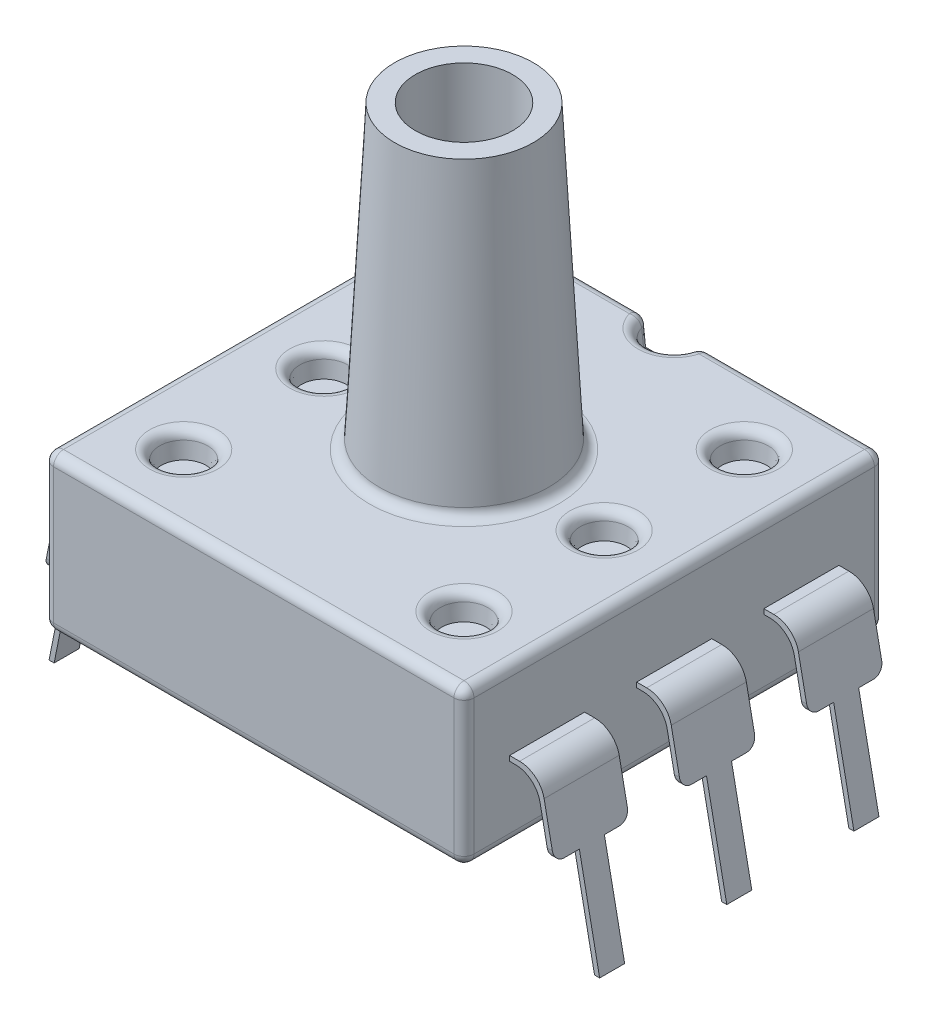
ISO-10303-21;
HEADER;
FILE_DESCRIPTION(('STEP AP214'),'2;1');
FILE_NAME('part.step','',(''),(''),'','','');
FILE_SCHEMA(('AUTOMOTIVE_DESIGN { 1 0 10303 214 1 1 1 1 }'));
ENDSEC;
DATA;
#1=APPLICATION_CONTEXT('core data for automotive mechanical design processes');
#2=APPLICATION_PROTOCOL_DEFINITION('international standard','automotive_design',2000,#1);
#3=PRODUCT_CONTEXT('',#1,'mechanical');
#4=PRODUCT('Part','Part','',(#3));
#5=PRODUCT_RELATED_PRODUCT_CATEGORY('part','',(#4));
#6=PRODUCT_DEFINITION_FORMATION('','',#4);
#7=PRODUCT_DEFINITION_CONTEXT('part definition',#1,'design');
#8=PRODUCT_DEFINITION('design','',#6,#7);
#9=PRODUCT_DEFINITION_SHAPE('','',#8);
#10=(LENGTH_UNIT() NAMED_UNIT(*) SI_UNIT(.MILLI.,.METRE.));
#11=(NAMED_UNIT(*) PLANE_ANGLE_UNIT() SI_UNIT($,.RADIAN.));
#12=(NAMED_UNIT(*) SI_UNIT($,.STERADIAN.) SOLID_ANGLE_UNIT());
#13=UNCERTAINTY_MEASURE_WITH_UNIT(LENGTH_MEASURE(1.E-05),#10,'distance_accuracy_value','');
#14=(GEOMETRIC_REPRESENTATION_CONTEXT(3) GLOBAL_UNCERTAINTY_ASSIGNED_CONTEXT((#13)) GLOBAL_UNIT_ASSIGNED_CONTEXT((#10,
#11,#12)) REPRESENTATION_CONTEXT('',''));
#15=CARTESIAN_POINT('',(0.,0.,0.));
#16=DIRECTION('',(0.,0.,1.));
#17=DIRECTION('',(1.,0.,0.));
#18=AXIS2_PLACEMENT_3D('',#15,#16,#17);
#19=CARTESIAN_POINT('',(0.,0.127518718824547,3.29));
#20=DIRECTION('',(0.,-1.,0.));
#21=DIRECTION('',(0.,0.,-1.));
#22=AXIS2_PLACEMENT_3D('',#19,#20,#21);
#23=PLANE('',#22);
#24=DIRECTION('',(0.,0.,-1.));
#25=VECTOR('',#24,1.);
#26=CARTESIAN_POINT('',(4.99257001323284,0.127518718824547,3.29));
#27=LINE('',#26,#25);
#28=CARTESIAN_POINT('',(4.99257001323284,0.127518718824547,2.29));
#29=VERTEX_POINT('',#28);
#30=CARTESIAN_POINT('',(4.99257001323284,0.127518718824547,1.99));
#31=VERTEX_POINT('',#30);
#32=EDGE_CURVE('E676',#29,#31,#27,.T.);
#33=ORIENTED_EDGE('',*,*,#32,.T.);
#34=DIRECTION('',(-1.,0.,0.));
#35=VECTOR('',#34,1.);
#36=CARTESIAN_POINT('',(5.09454988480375,0.127518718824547,1.99));
#37=LINE('',#36,#35);
#38=CARTESIAN_POINT('',(5.09454988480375,0.127518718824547,1.99));
#39=VERTEX_POINT('',#38);
#40=EDGE_CURVE('E787',#31,#39,#37,.F.);
#41=ORIENTED_EDGE('',*,*,#40,.T.);
#42=DIRECTION('',(0.,0.,-1.));
#43=VECTOR('',#42,1.);
#44=CARTESIAN_POINT('',(5.09454988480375,0.127518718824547,3.29));
#45=LINE('',#44,#43);
#46=CARTESIAN_POINT('',(5.09454988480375,0.127518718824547,2.29));
#47=VERTEX_POINT('',#46);
#48=EDGE_CURVE('E768',#47,#39,#45,.T.);
#49=ORIENTED_EDGE('',*,*,#48,.F.);
#50=DIRECTION('',(-1.,0.,0.));
#51=VECTOR('',#50,1.);
#52=CARTESIAN_POINT('',(0.,0.127518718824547,2.29));
#53=LINE('',#52,#51);
#54=EDGE_CURVE('E704',#47,#29,#53,.T.);
#55=ORIENTED_EDGE('',*,*,#54,.T.);
#56=EDGE_LOOP('',(#33,#41,#49,#55));
#57=FACE_BOUND('',#56,.T.);
#58=ADVANCED_FACE('F35',(#57),#23,.T.);
#59=CARTESIAN_POINT('',(0.,0.127518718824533,3.29));
#60=DIRECTION('',(0.,1.,0.));
#61=DIRECTION('',(0.,0.,1.));
#62=AXIS2_PLACEMENT_3D('',#59,#60,#61);
#63=PLANE('',#62);
#64=DIRECTION('',(0.,0.,-1.));
#65=VECTOR('',#64,1.);
#66=CARTESIAN_POINT('',(-5.09454988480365,0.127518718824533,3.29));
#67=LINE('',#66,#65);
#68=CARTESIAN_POINT('',(-5.09454988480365,0.127518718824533,2.29));
#69=VERTEX_POINT('',#68);
#70=CARTESIAN_POINT('',(-5.09454988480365,0.127518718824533,1.99));
#71=VERTEX_POINT('',#70);
#72=EDGE_CURVE('E728',#69,#71,#67,.T.);
#73=ORIENTED_EDGE('',*,*,#72,.T.);
#74=DIRECTION('',(1.,0.,0.));
#75=VECTOR('',#74,1.);
#76=CARTESIAN_POINT('',(0.,0.127518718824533,1.99));
#77=LINE('',#76,#75);
#78=CARTESIAN_POINT('',(-4.99257001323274,0.127518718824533,1.99));
#79=VERTEX_POINT('',#78);
#80=EDGE_CURVE('E796',#71,#79,#77,.T.);
#81=ORIENTED_EDGE('',*,*,#80,.T.);
#82=DIRECTION('',(0.,0.,-1.));
#83=VECTOR('',#82,1.);
#84=CARTESIAN_POINT('',(-4.99257001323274,0.127518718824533,3.29));
#85=LINE('',#84,#83);
#86=CARTESIAN_POINT('',(-4.99257001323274,0.127518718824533,2.29));
#87=VERTEX_POINT('',#86);
#88=EDGE_CURVE('E803',#87,#79,#85,.T.);
#89=ORIENTED_EDGE('',*,*,#88,.F.);
#90=DIRECTION('',(1.,0.,0.));
#91=VECTOR('',#90,1.);
#92=CARTESIAN_POINT('',(0.,0.127518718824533,2.29));
#93=LINE('',#92,#91);
#94=EDGE_CURVE('E716',#69,#87,#93,.T.);
#95=ORIENTED_EDGE('',*,*,#94,.F.);
#96=EDGE_LOOP('',(#73,#81,#89,#95));
#97=FACE_BOUND('',#96,.T.);
#98=ADVANCED_FACE('F1106',(#97),#63,.F.);
#99=CARTESIAN_POINT('',(0.,0.127518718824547,-1.79));
#100=DIRECTION('',(0.,-1.,0.));
#101=DIRECTION('',(0.,0.,-1.));
#102=AXIS2_PLACEMENT_3D('',#99,#100,#101);
#103=PLANE('',#102);
#104=DIRECTION('',(0.,0.,-1.));
#105=VECTOR('',#104,1.);
#106=CARTESIAN_POINT('',(4.99257001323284,0.127518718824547,-1.79));
#107=LINE('',#106,#105);
#108=CARTESIAN_POINT('',(4.99257001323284,0.127518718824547,-2.79));
#109=VERTEX_POINT('',#108);
#110=CARTESIAN_POINT('',(4.99257001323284,0.127518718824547,-3.09));
#111=VERTEX_POINT('',#110);
#112=EDGE_CURVE('E905',#109,#111,#107,.T.);
#113=ORIENTED_EDGE('',*,*,#112,.T.);
#114=DIRECTION('',(-1.,0.,0.));
#115=VECTOR('',#114,1.);
#116=CARTESIAN_POINT('',(5.09454988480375,0.127518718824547,-3.09));
#117=LINE('',#116,#115);
#118=CARTESIAN_POINT('',(5.09454988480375,0.127518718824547,-3.09));
#119=VERTEX_POINT('',#118);
#120=EDGE_CURVE('E918',#111,#119,#117,.F.);
#121=ORIENTED_EDGE('',*,*,#120,.T.);
#122=DIRECTION('',(0.,0.,-1.));
#123=VECTOR('',#122,1.);
#124=CARTESIAN_POINT('',(5.09454988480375,0.127518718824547,-1.79));
#125=LINE('',#124,#123);
#126=CARTESIAN_POINT('',(5.09454988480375,0.127518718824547,-2.79));
#127=VERTEX_POINT('',#126);
#128=EDGE_CURVE('E899',#127,#119,#125,.T.);
#129=ORIENTED_EDGE('',*,*,#128,.F.);
#130=DIRECTION('',(-1.,0.,0.));
#131=VECTOR('',#130,1.);
#132=CARTESIAN_POINT('',(0.,0.127518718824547,-2.79));
#133=LINE('',#132,#131);
#134=EDGE_CURVE('E1184',#127,#109,#133,.T.);
#135=ORIENTED_EDGE('',*,*,#134,.T.);
#136=EDGE_LOOP('',(#113,#121,#129,#135));
#137=FACE_BOUND('',#136,.T.);
#138=ADVANCED_FACE('F1030',(#137),#103,.T.);
#139=CARTESIAN_POINT('',(0.,0.127518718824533,-1.79));
#140=DIRECTION('',(0.,1.,0.));
#141=DIRECTION('',(0.,0.,1.));
#142=AXIS2_PLACEMENT_3D('',#139,#140,#141);
#143=PLANE('',#142);
#144=DIRECTION('',(0.,0.,-1.));
#145=VECTOR('',#144,1.);
#146=CARTESIAN_POINT('',(-5.09454988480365,0.127518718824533,-1.79));
#147=LINE('',#146,#145);
#148=CARTESIAN_POINT('',(-5.09454988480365,0.127518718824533,-2.79));
#149=VERTEX_POINT('',#148);
#150=CARTESIAN_POINT('',(-5.09454988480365,0.127518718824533,-3.09));
#151=VERTEX_POINT('',#150);
#152=EDGE_CURVE('E852',#149,#151,#147,.T.);
#153=ORIENTED_EDGE('',*,*,#152,.T.);
#154=DIRECTION('',(1.,0.,0.));
#155=VECTOR('',#154,1.);
#156=CARTESIAN_POINT('',(0.,0.127518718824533,-3.09));
#157=LINE('',#156,#155);
#158=CARTESIAN_POINT('',(-4.99257001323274,0.127518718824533,-3.09));
#159=VERTEX_POINT('',#158);
#160=EDGE_CURVE('E929',#151,#159,#157,.T.);
#161=ORIENTED_EDGE('',*,*,#160,.T.);
#162=DIRECTION('',(0.,0.,-1.));
#163=VECTOR('',#162,1.);
#164=CARTESIAN_POINT('',(-4.99257001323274,0.127518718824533,-1.79));
#165=LINE('',#164,#163);
#166=CARTESIAN_POINT('',(-4.99257001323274,0.127518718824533,-2.79));
#167=VERTEX_POINT('',#166);
#168=EDGE_CURVE('E867',#167,#159,#165,.T.);
#169=ORIENTED_EDGE('',*,*,#168,.F.);
#170=DIRECTION('',(1.,0.,0.));
#171=VECTOR('',#170,1.);
#172=CARTESIAN_POINT('',(0.,0.127518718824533,-2.79));
#173=LINE('',#172,#171);
#174=EDGE_CURVE('E889',#149,#167,#173,.T.);
#175=ORIENTED_EDGE('',*,*,#174,.F.);
#176=EDGE_LOOP('',(#153,#161,#169,#175));
#177=FACE_BOUND('',#176,.T.);
#178=ADVANCED_FACE('F961',(#177),#143,.F.);
#179=CARTESIAN_POINT('',(0.,0.127518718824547,0.75));
#180=DIRECTION('',(0.,-1.,0.));
#181=DIRECTION('',(0.,0.,-1.));
#182=AXIS2_PLACEMENT_3D('',#179,#180,#181);
#183=PLANE('',#182);
#184=DIRECTION('',(0.,0.,-1.));
#185=VECTOR('',#184,1.);
#186=CARTESIAN_POINT('',(4.99257001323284,0.127518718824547,0.75));
#187=LINE('',#186,#185);
#188=CARTESIAN_POINT('',(4.99257001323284,0.127518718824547,-0.25));
#189=VERTEX_POINT('',#188);
#190=CARTESIAN_POINT('',(4.99257001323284,0.127518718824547,-0.55));
#191=VERTEX_POINT('',#190);
#192=EDGE_CURVE('E3046',#189,#191,#187,.T.);
#193=ORIENTED_EDGE('',*,*,#192,.T.);
#194=DIRECTION('',(-1.,0.,0.));
#195=VECTOR('',#194,1.);
#196=CARTESIAN_POINT('',(5.09454988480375,0.127518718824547,-0.55));
#197=LINE('',#196,#195);
#198=CARTESIAN_POINT('',(5.09454988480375,0.127518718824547,-0.55));
#199=VERTEX_POINT('',#198);
#200=EDGE_CURVE('E3179',#191,#199,#197,.F.);
#201=ORIENTED_EDGE('',*,*,#200,.T.);
#202=DIRECTION('',(0.,0.,-1.));
#203=VECTOR('',#202,1.);
#204=CARTESIAN_POINT('',(5.09454988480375,0.127518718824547,0.75));
#205=LINE('',#204,#203);
#206=CARTESIAN_POINT('',(5.09454988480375,0.127518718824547,-0.25));
#207=VERTEX_POINT('',#206);
#208=EDGE_CURVE('E3164',#207,#199,#205,.T.);
#209=ORIENTED_EDGE('',*,*,#208,.F.);
#210=DIRECTION('',(-1.,0.,0.));
#211=VECTOR('',#210,1.);
#212=CARTESIAN_POINT('',(0.,0.127518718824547,-0.25));
#213=LINE('',#212,#211);
#214=EDGE_CURVE('E3098',#207,#189,#213,.T.);
#215=ORIENTED_EDGE('',*,*,#214,.T.);
#216=EDGE_LOOP('',(#193,#201,#209,#215));
#217=FACE_BOUND('',#216,.T.);
#218=ADVANCED_FACE('F1290',(#217),#183,.T.);
#219=CARTESIAN_POINT('',(0.,0.127518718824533,0.75));
#220=DIRECTION('',(0.,1.,0.));
#221=DIRECTION('',(0.,0.,1.));
#222=AXIS2_PLACEMENT_3D('',#219,#220,#221);
#223=PLANE('',#222);
#224=DIRECTION('',(0.,0.,-1.));
#225=VECTOR('',#224,1.);
#226=CARTESIAN_POINT('',(-5.09454988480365,0.127518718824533,0.75));
#227=LINE('',#226,#225);
#228=CARTESIAN_POINT('',(-5.09454988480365,0.127518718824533,-0.25));
#229=VERTEX_POINT('',#228);
#230=CARTESIAN_POINT('',(-5.09454988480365,0.127518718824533,-0.55));
#231=VERTEX_POINT('',#230);
#232=EDGE_CURVE('E2966',#229,#231,#227,.T.);
#233=ORIENTED_EDGE('',*,*,#232,.T.);
#234=DIRECTION('',(1.,0.,0.));
#235=VECTOR('',#234,1.);
#236=CARTESIAN_POINT('',(0.,0.127518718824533,-0.55));
#237=LINE('',#236,#235);
#238=CARTESIAN_POINT('',(-4.99257001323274,0.127518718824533,-0.55));
#239=VERTEX_POINT('',#238);
#240=EDGE_CURVE('E2979',#231,#239,#237,.T.);
#241=ORIENTED_EDGE('',*,*,#240,.T.);
#242=DIRECTION('',(0.,0.,-1.));
#243=VECTOR('',#242,1.);
#244=CARTESIAN_POINT('',(-4.99257001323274,0.127518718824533,0.75));
#245=LINE('',#244,#243);
#246=CARTESIAN_POINT('',(-4.99257001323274,0.127518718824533,-0.25));
#247=VERTEX_POINT('',#246);
#248=EDGE_CURVE('E2960',#247,#239,#245,.T.);
#249=ORIENTED_EDGE('',*,*,#248,.F.);
#250=DIRECTION('',(1.,0.,0.));
#251=VECTOR('',#250,1.);
#252=CARTESIAN_POINT('',(0.,0.127518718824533,-0.25));
#253=LINE('',#252,#251);
#254=EDGE_CURVE('E3117',#229,#247,#253,.T.);
#255=ORIENTED_EDGE('',*,*,#254,.F.);
#256=EDGE_LOOP('',(#233,#241,#249,#255));
#257=FACE_BOUND('',#256,.T.);
#258=ADVANCED_FACE('F1295',(#257),#223,.F.);
#259=CARTESIAN_POINT('',(4.2,3.1,-4.20000000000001));
#260=DIRECTION('',(0.,-1.,0.));
#261=DIRECTION('',(0.,0.,-1.));
#262=AXIS2_PLACEMENT_3D('',#259,#260,#261);
#263=PLANE('',#262);
#264=CARTESIAN_POINT('',(0.,3.1,0.));
#265=DIRECTION('',(0.,-1.,0.));
#266=DIRECTION('',(0.,0.,-1.));
#267=AXIS2_PLACEMENT_3D('',#264,#265,#266);
#268=CIRCLE('',#267,1.88979291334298);
#269=CARTESIAN_POINT('',(0.,3.1,-1.88979291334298));
#270=VERTEX_POINT('',#269);
#271=EDGE_CURVE('E3310',#270,#270,#268,.T.);
#272=ORIENTED_EDGE('',*,*,#271,.T.);
#273=EDGE_LOOP('',(#272));
#274=FACE_BOUND('',#273,.T.);
#275=CARTESIAN_POINT('',(-2.8,3.1,0.));
#276=DIRECTION('',(0.,-1.,0.));
#277=DIRECTION('',(0.,0.,-1.));
#278=AXIS2_PLACEMENT_3D('',#275,#276,#277);
#279=CIRCLE('',#278,0.680080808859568);
#280=CARTESIAN_POINT('',(-2.8,3.1,-0.680080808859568));
#281=VERTEX_POINT('',#280);
#282=EDGE_CURVE('E3314',#281,#281,#279,.T.);
#283=ORIENTED_EDGE('',*,*,#282,.T.);
#284=EDGE_LOOP('',(#283));
#285=FACE_BOUND('',#284,.T.);
#286=CARTESIAN_POINT('',(-2.8,3.1,-2.8));
#287=DIRECTION('',(0.,-1.,0.));
#288=DIRECTION('',(0.,0.,-1.));
#289=AXIS2_PLACEMENT_3D('',#286,#287,#288);
#290=CIRCLE('',#289,0.680080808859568);
#291=CARTESIAN_POINT('',(-2.8,3.1,-3.48008080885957));
#292=VERTEX_POINT('',#291);
#293=EDGE_CURVE('E3317',#292,#292,#290,.T.);
#294=ORIENTED_EDGE('',*,*,#293,.T.);
#295=EDGE_LOOP('',(#294));
#296=FACE_BOUND('',#295,.T.);
#297=CARTESIAN_POINT('',(-2.80000000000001,3.1,2.79999999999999));
#298=DIRECTION('',(0.,-1.,0.));
#299=DIRECTION('',(0.,0.,-1.));
#300=AXIS2_PLACEMENT_3D('',#297,#298,#299);
#301=CIRCLE('',#300,0.680080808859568);
#302=CARTESIAN_POINT('',(-2.80000000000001,3.1,2.11991919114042));
#303=VERTEX_POINT('',#302);
#304=EDGE_CURVE('E3322',#303,#303,#301,.T.);
#305=ORIENTED_EDGE('',*,*,#304,.T.);
#306=EDGE_LOOP('',(#305));
#307=FACE_BOUND('',#306,.T.);
#308=CARTESIAN_POINT('',(2.80000000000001,3.1,2.79999999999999));
#309=DIRECTION('',(0.,-1.,0.));
#310=DIRECTION('',(0.,0.,-1.));
#311=AXIS2_PLACEMENT_3D('',#308,#309,#310);
#312=CIRCLE('',#311,0.680080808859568);
#313=CARTESIAN_POINT('',(2.80000000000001,3.1,2.11991919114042));
#314=VERTEX_POINT('',#313);
#315=EDGE_CURVE('E3325',#314,#314,#312,.T.);
#316=ORIENTED_EDGE('',*,*,#315,.T.);
#317=EDGE_LOOP('',(#316));
#318=FACE_BOUND('',#317,.T.);
#319=CARTESIAN_POINT('',(2.8,3.1,-2.8));
#320=DIRECTION('',(0.,-1.,0.));
#321=DIRECTION('',(0.,0.,-1.));
#322=AXIS2_PLACEMENT_3D('',#319,#320,#321);
#323=CIRCLE('',#322,0.680080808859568);
#324=CARTESIAN_POINT('',(2.8,3.1,-3.48008080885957));
#325=VERTEX_POINT('',#324);
#326=EDGE_CURVE('E3328',#325,#325,#323,.T.);
#327=ORIENTED_EDGE('',*,*,#326,.T.);
#328=EDGE_LOOP('',(#327));
#329=FACE_BOUND('',#328,.T.);
#330=CARTESIAN_POINT('',(2.8,3.1,0.));
#331=DIRECTION('',(0.,-1.,0.));
#332=DIRECTION('',(0.,0.,-1.));
#333=AXIS2_PLACEMENT_3D('',#330,#331,#332);
#334=CIRCLE('',#333,0.680080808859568);
#335=CARTESIAN_POINT('',(2.8,3.1,-0.680080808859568));
#336=VERTEX_POINT('',#335);
#337=EDGE_CURVE('E3331',#336,#336,#334,.T.);
#338=ORIENTED_EDGE('',*,*,#337,.T.);
#339=EDGE_LOOP('',(#338));
#340=FACE_BOUND('',#339,.T.);
#341=DIRECTION('',(-1.,0.,0.));
#342=VECTOR('',#341,1.);
#343=CARTESIAN_POINT('',(4.2,3.1,-4.00000000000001));
#344=LINE('',#343,#342);
#345=CARTESIAN_POINT('',(4.,3.1,-4.00000000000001));
#346=VERTEX_POINT('',#345);
#347=CARTESIAN_POINT('',(0.69651967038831,3.1,-4.00000000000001));
#348=VERTEX_POINT('',#347);
#349=EDGE_CURVE('E3337',#346,#348,#344,.T.);
#350=ORIENTED_EDGE('',*,*,#349,.T.);
#351=CARTESIAN_POINT('',(0.,3.1,-4.20000000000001));
#352=DIRECTION('',(0.,-1.,0.));
#353=DIRECTION('',(0.,0.,-1.));
#354=AXIS2_PLACEMENT_3D('',#351,#352,#353);
#355=CIRCLE('',#354,0.724665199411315);
#356=CARTESIAN_POINT('',(-0.69651967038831,3.1,-4.00000000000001));
#357=VERTEX_POINT('',#356);
#358=EDGE_CURVE('E3334',#348,#357,#355,.T.);
#359=ORIENTED_EDGE('',*,*,#358,.T.);
#360=DIRECTION('',(-1.,0.,0.));
#361=VECTOR('',#360,1.);
#362=CARTESIAN_POINT('',(4.2,3.1,-4.00000000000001));
#363=LINE('',#362,#361);
#364=CARTESIAN_POINT('',(-4.,3.1,-4.00000000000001));
#365=VERTEX_POINT('',#364);
#366=EDGE_CURVE('E3277',#357,#365,#363,.T.);
#367=ORIENTED_EDGE('',*,*,#366,.T.);
#368=DIRECTION('',(0.,0.,1.));
#369=VECTOR('',#368,1.);
#370=CARTESIAN_POINT('',(-4.,3.1,-4.20000000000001));
#371=LINE('',#370,#369);
#372=CARTESIAN_POINT('',(-4.,3.1,4.));
#373=VERTEX_POINT('',#372);
#374=EDGE_CURVE('E2880',#365,#373,#371,.T.);
#375=ORIENTED_EDGE('',*,*,#374,.T.);
#376=DIRECTION('',(1.,0.,0.));
#377=VECTOR('',#376,1.);
#378=CARTESIAN_POINT('',(4.2,3.1,4.));
#379=LINE('',#378,#377);
#380=CARTESIAN_POINT('',(4.,3.1,4.));
#381=VERTEX_POINT('',#380);
#382=EDGE_CURVE('E3341',#373,#381,#379,.T.);
#383=ORIENTED_EDGE('',*,*,#382,.T.);
#384=DIRECTION('',(0.,0.,-1.));
#385=VECTOR('',#384,1.);
#386=CARTESIAN_POINT('',(4.,3.1,-4.20000000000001));
#387=LINE('',#386,#385);
#388=EDGE_CURVE('E3339',#381,#346,#387,.T.);
#389=ORIENTED_EDGE('',*,*,#388,.T.);
#390=EDGE_LOOP('',(#350,#359,#367,#375,#383,#389));
#391=FACE_BOUND('',#390,.T.);
#392=ADVANCED_FACE('F2319',(#274,#285,#296,#307,#318,#329,#340,#391),#263,.F.);
#393=CARTESIAN_POINT('',(4.2,3.1,4.2));
#394=DIRECTION('',(-1.,0.,0.));
#395=DIRECTION('',(0.,0.,1.));
#396=AXIS2_PLACEMENT_3D('',#393,#394,#395);
#397=PLANE('',#396);
#398=DIRECTION('',(0.,0.,1.));
#399=VECTOR('',#398,1.);
#400=CARTESIAN_POINT('',(4.2,1.45,4.2));
#401=LINE('',#400,#399);
#402=CARTESIAN_POINT('',(4.2,1.45,1.79));
#403=VERTEX_POINT('',#402);
#404=CARTESIAN_POINT('',(4.2,1.45,3.29));
#405=VERTEX_POINT('',#404);
#406=EDGE_CURVE('E820',#403,#405,#401,.T.);
#407=ORIENTED_EDGE('',*,*,#406,.T.);
#408=DIRECTION('',(0.,1.,0.));
#409=VECTOR('',#408,1.);
#410=CARTESIAN_POINT('',(4.2,3.1,3.29));
#411=LINE('',#410,#409);
#412=CARTESIAN_POINT('',(4.2,1.55,3.29));
#413=VERTEX_POINT('',#412);
#414=EDGE_CURVE('E815',#405,#413,#411,.T.);
#415=ORIENTED_EDGE('',*,*,#414,.T.);
#416=DIRECTION('',(0.,0.,-1.));
#417=VECTOR('',#416,1.);
#418=CARTESIAN_POINT('',(4.2,1.55,4.2));
#419=LINE('',#418,#417);
#420=CARTESIAN_POINT('',(4.2,1.55,1.79));
#421=VERTEX_POINT('',#420);
#422=EDGE_CURVE('E818',#413,#421,#419,.T.);
#423=ORIENTED_EDGE('',*,*,#422,.T.);
#424=DIRECTION('',(0.,1.,0.));
#425=VECTOR('',#424,1.);
#426=CARTESIAN_POINT('',(4.2,3.1,1.79));
#427=LINE('',#426,#425);
#428=EDGE_CURVE('E823',#403,#421,#427,.T.);
#429=ORIENTED_EDGE('',*,*,#428,.F.);
#430=EDGE_LOOP('',(#407,#415,#423,#429));
#431=FACE_BOUND('',#430,.T.);
#432=DIRECTION('',(0.,0.,1.));
#433=VECTOR('',#432,1.);
#434=CARTESIAN_POINT('',(4.2,1.45,4.2));
#435=LINE('',#434,#433);
#436=CARTESIAN_POINT('',(4.2,1.45,-3.29));
#437=VERTEX_POINT('',#436);
#438=CARTESIAN_POINT('',(4.2,1.45,-1.79));
#439=VERTEX_POINT('',#438);
#440=EDGE_CURVE('E1246',#437,#439,#435,.T.);
#441=ORIENTED_EDGE('',*,*,#440,.T.);
#442=DIRECTION('',(0.,1.,0.));
#443=VECTOR('',#442,1.);
#444=CARTESIAN_POINT('',(4.2,3.1,-1.79));
#445=LINE('',#444,#443);
#446=CARTESIAN_POINT('',(4.2,1.55,-1.79));
#447=VERTEX_POINT('',#446);
#448=EDGE_CURVE('E1219',#439,#447,#445,.T.);
#449=ORIENTED_EDGE('',*,*,#448,.T.);
#450=DIRECTION('',(0.,0.,-1.));
#451=VECTOR('',#450,1.);
#452=CARTESIAN_POINT('',(4.2,1.55,4.2));
#453=LINE('',#452,#451);
#454=CARTESIAN_POINT('',(4.2,1.55,-3.29));
#455=VERTEX_POINT('',#454);
#456=EDGE_CURVE('E1248',#447,#455,#453,.T.);
#457=ORIENTED_EDGE('',*,*,#456,.T.);
#458=DIRECTION('',(0.,1.,0.));
#459=VECTOR('',#458,1.);
#460=CARTESIAN_POINT('',(4.2,3.1,-3.29));
#461=LINE('',#460,#459);
#462=EDGE_CURVE('E1249',#437,#455,#461,.T.);
#463=ORIENTED_EDGE('',*,*,#462,.F.);
#464=EDGE_LOOP('',(#441,#449,#457,#463));
#465=FACE_BOUND('',#464,.T.);
#466=DIRECTION('',(0.,0.,1.));
#467=VECTOR('',#466,1.);
#468=CARTESIAN_POINT('',(4.2,1.45,4.2));
#469=LINE('',#468,#467);
#470=CARTESIAN_POINT('',(4.2,1.45,-0.75));
#471=VERTEX_POINT('',#470);
#472=CARTESIAN_POINT('',(4.2,1.45,0.75));
#473=VERTEX_POINT('',#472);
#474=EDGE_CURVE('E2952',#471,#473,#469,.T.);
#475=ORIENTED_EDGE('',*,*,#474,.T.);
#476=DIRECTION('',(0.,1.,0.));
#477=VECTOR('',#476,1.);
#478=CARTESIAN_POINT('',(4.2,3.1,0.75));
#479=LINE('',#478,#477);
#480=CARTESIAN_POINT('',(4.2,1.55,0.75));
#481=VERTEX_POINT('',#480);
#482=EDGE_CURVE('E2957',#473,#481,#479,.T.);
#483=ORIENTED_EDGE('',*,*,#482,.T.);
#484=DIRECTION('',(0.,0.,-1.));
#485=VECTOR('',#484,1.);
#486=CARTESIAN_POINT('',(4.2,1.55,4.2));
#487=LINE('',#486,#485);
#488=CARTESIAN_POINT('',(4.2,1.55,-0.75));
#489=VERTEX_POINT('',#488);
#490=EDGE_CURVE('E2955',#481,#489,#487,.T.);
#491=ORIENTED_EDGE('',*,*,#490,.T.);
#492=DIRECTION('',(0.,1.,0.));
#493=VECTOR('',#492,1.);
#494=CARTESIAN_POINT('',(4.2,3.1,-0.75));
#495=LINE('',#494,#493);
#496=EDGE_CURVE('E2949',#471,#489,#495,.T.);
#497=ORIENTED_EDGE('',*,*,#496,.F.);
#498=EDGE_LOOP('',(#475,#483,#491,#497));
#499=FACE_BOUND('',#498,.T.);
#500=DIRECTION('',(0.,-1.,0.));
#501=VECTOR('',#500,1.);
#502=CARTESIAN_POINT('',(4.2,3.1,-4.00000000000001));
#503=LINE('',#502,#501);
#504=CARTESIAN_POINT('',(4.2,0.2,-4.00000000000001));
#505=VERTEX_POINT('',#504);
#506=CARTESIAN_POINT('',(4.2,2.9,-4.00000000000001));
#507=VERTEX_POINT('',#506);
#508=EDGE_CURVE('E2843',#505,#507,#503,.F.);
#509=ORIENTED_EDGE('',*,*,#508,.T.);
#510=DIRECTION('',(0.,0.,-1.));
#511=VECTOR('',#510,1.);
#512=CARTESIAN_POINT('',(4.2,2.9,4.2));
#513=LINE('',#512,#511);
#514=CARTESIAN_POINT('',(4.2,2.9,4.));
#515=VERTEX_POINT('',#514);
#516=EDGE_CURVE('E2845',#507,#515,#513,.F.);
#517=ORIENTED_EDGE('',*,*,#516,.T.);
#518=DIRECTION('',(0.,-1.,0.));
#519=VECTOR('',#518,1.);
#520=CARTESIAN_POINT('',(4.2,3.1,4.));
#521=LINE('',#520,#519);
#522=CARTESIAN_POINT('',(4.2,0.2,4.));
#523=VERTEX_POINT('',#522);
#524=EDGE_CURVE('E2839',#515,#523,#521,.T.);
#525=ORIENTED_EDGE('',*,*,#524,.T.);
#526=DIRECTION('',(0.,0.,-1.));
#527=VECTOR('',#526,1.);
#528=CARTESIAN_POINT('',(4.2,0.2,-4.20000000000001));
#529=LINE('',#528,#527);
#530=EDGE_CURVE('E2841',#523,#505,#529,.T.);
#531=ORIENTED_EDGE('',*,*,#530,.T.);
#532=EDGE_LOOP('',(#509,#517,#525,#531));
#533=FACE_BOUND('',#532,.T.);
#534=ADVANCED_FACE('F1256',(#431,#465,#499,#533),#397,.F.);
#535=CARTESIAN_POINT('',(-4.2,3.1,-4.20000000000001));
#536=DIRECTION('',(0.,0.,1.));
#537=DIRECTION('',(1.,0.,0.));
#538=AXIS2_PLACEMENT_3D('',#535,#536,#537);
#539=PLANE('',#538);
#540=CARTESIAN_POINT('',(2.88678242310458,23.5370090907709,-4.20000000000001));
#541=CARTESIAN_POINT('',(2.70111585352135,23.5565702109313,-4.20000000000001));
#542=CARTESIAN_POINT('',(2.68835369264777,23.5579147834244,-4.01374739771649));
#543=CARTESIAN_POINT('',(2.79588344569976,22.6742305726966,-4.20000000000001));
#544=CARTESIAN_POINT('',(2.61071045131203,22.6946246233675,-4.20000000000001));
#545=CARTESIAN_POINT('',(2.59748442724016,22.6951362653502,-4.01417809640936));
#546=CARTESIAN_POINT('',(2.70496457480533,21.8114541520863,-4.20000000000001));
#547=CARTESIAN_POINT('',(2.52025202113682,21.8320195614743,-4.20000000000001));
#548=CARTESIAN_POINT('',(2.50659950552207,21.83235984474,-4.0146484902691));
#549=CARTESIAN_POINT('',(2.52307157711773,20.0859069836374,-4.20000000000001));
#550=CARTESIAN_POINT('',(2.33932701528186,20.1063112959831,-4.20000000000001));
#551=CARTESIAN_POINT('',(2.32478716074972,20.1068126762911,-4.01569938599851));
#552=CARTESIAN_POINT('',(2.43209745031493,19.2231362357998,-4.20000000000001));
#553=CARTESIAN_POINT('',(2.24890580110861,19.243641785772,-4.20000000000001));
#554=CARTESIAN_POINT('',(2.23385973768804,19.2440419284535,-4.01627988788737));
#555=CARTESIAN_POINT('',(2.15906817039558,16.6348270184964,-4.20000000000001));
#556=CARTESIAN_POINT('',(1.97811938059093,16.6593943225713,-4.20000000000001));
#557=CARTESIAN_POINT('',(1.96099612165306,16.6557327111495,-4.01823263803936));
#558=CARTESIAN_POINT('',(1.97690697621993,14.9092997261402,-4.20000000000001));
#559=CARTESIAN_POINT('',(1.79776243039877,14.9371118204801,-4.20000000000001));
#560=CARTESIAN_POINT('',(1.77897944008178,14.9302054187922,-4.01981612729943));
#561=CARTESIAN_POINT('',(1.70318585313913,12.3210689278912,-4.20000000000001));
#562=CARTESIAN_POINT('',(1.52633928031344,12.3418864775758,-4.20000000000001));
#563=CARTESIAN_POINT('',(1.50562912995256,12.3419746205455,-4.02314099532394));
#564=CARTESIAN_POINT('',(1.61186608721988,11.4583400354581,-4.20000000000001));
#565=CARTESIAN_POINT('',(1.4362444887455,11.4798962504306,-4.20000000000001));
#566=CARTESIAN_POINT('',(1.41445864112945,11.4792457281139,-4.02440754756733));
#567=CARTESIAN_POINT('',(1.42895409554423,9.73291071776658,-4.20000000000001));
#568=CARTESIAN_POINT('',(1.2560598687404,9.75422155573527,-4.20000000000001));
#569=CARTESIAN_POINT('',(1.2319505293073,9.75381641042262,-4.02747464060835));
#570=CARTESIAN_POINT('',(1.33736186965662,8.87021029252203,-4.20000000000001));
#571=CARTESIAN_POINT('',(1.16617543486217,8.89251593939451,-4.20000000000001));
#572=CARTESIAN_POINT('',(1.14061290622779,8.89111598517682,-4.02927518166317));
#573=CARTESIAN_POINT('',(1.15370550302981,7.14486176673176,-4.20000000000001));
#574=CARTESIAN_POINT('',(0.986487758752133,7.16709582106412,-4.20000000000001));
#575=CARTESIAN_POINT('',(0.957677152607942,7.16576745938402,-4.03379453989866));
#576=CARTESIAN_POINT('',(1.06164136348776,6.2822136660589,-4.20000000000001));
#577=CARTESIAN_POINT('',(0.897025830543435,6.30668567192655,-4.20000000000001));
#578=CARTESIAN_POINT('',(0.866079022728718,6.3031193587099,-4.03651335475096));
#579=CARTESIAN_POINT('',(0.922776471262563,4.98832429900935,-4.20000000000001));
#580=CARTESIAN_POINT('',(0.762309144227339,5.00718830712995,-4.20000000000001));
#581=CARTESIAN_POINT('',(0.728359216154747,5.00922999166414,-4.04204856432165));
#582=CARTESIAN_POINT('',(0.876360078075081,4.5570418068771,-4.20000000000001));
#583=CARTESIAN_POINT('',(0.717704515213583,4.57630077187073,-4.20000000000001));
#584=CARTESIAN_POINT('',(0.682398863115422,4.57794749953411,-4.04413646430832));
#585=CARTESIAN_POINT('',(0.783112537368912,3.69452169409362,-4.20000000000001));
#586=CARTESIAN_POINT('',(0.628574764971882,3.71349785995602,-4.20000000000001));
#587=CARTESIAN_POINT('',(0.590341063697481,3.71542738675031,-4.04908175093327));
#588=CARTESIAN_POINT('',(0.73628138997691,3.26328407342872,-4.20000000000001));
#589=CARTESIAN_POINT('',(0.584180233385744,3.28286446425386,-4.20000000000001));
#590=CARTESIAN_POINT('',(0.544243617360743,3.28418976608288,-4.05193913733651));
#591=CARTESIAN_POINT('',(0.665532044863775,2.61682997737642,-4.20000000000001));
#592=CARTESIAN_POINT('',(0.517466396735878,2.63381606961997,-4.20000000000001));
#593=CARTESIAN_POINT('',(0.475018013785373,2.63773567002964,-4.05719009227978));
#594=CARTESIAN_POINT('',(0.641884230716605,2.40158394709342,-4.20000000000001));
#595=CARTESIAN_POINT('',(0.495379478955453,2.41862464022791,-4.20000000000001));
#596=CARTESIAN_POINT('',(0.45194801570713,2.42248963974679,-4.0590993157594));
#597=CARTESIAN_POINT('',(0.594328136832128,1.97112054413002,-4.20000000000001));
#598=CARTESIAN_POINT('',(0.451242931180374,1.98785000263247,-4.20000000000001));
#599=CARTESIAN_POINT('',(0.405775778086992,1.99202623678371,-4.06336785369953));
#600=CARTESIAN_POINT('',(0.570419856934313,1.75590317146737,-4.20000000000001));
#601=CARTESIAN_POINT('',(0.429228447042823,1.7726159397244,-4.20000000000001));
#602=CARTESIAN_POINT('',(0.382673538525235,1.77680886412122,-4.06572716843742));
#603=CARTESIAN_POINT('',(0.546340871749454,1.5407047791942,-4.20000000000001));
#604=CARTESIAN_POINT('',(0.40714613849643,1.55628419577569,-4.20000000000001));
#605=CARTESIAN_POINT('',(0.359558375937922,1.56161047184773,-4.06837580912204));
#606=(BOUNDED_SURFACE() B_SPLINE_SURFACE(3,2,((#540,#541,#542),(#543,#544,#545),(#546,#547,
#548),(#549,#550,#551),(#552,#553,#554),(#555,#556,#557),(#558,#559,#560),(#561,#562,#563),
(#564,#565,#566),(#567,#568,#569),(#570,#571,#572),(#573,#574,#575),(#576,#577,#578),(#579,#580,
#581),(#582,#583,#584),(#585,#586,#587),(#588,#589,#590),(#591,#592,#593),(#594,#595,#596),
(#597,#598,#599),(#600,#601,#602),(#603,#604,#605)),.UNSPECIFIED.,.F.,.F.,
.F.) B_SPLINE_SURFACE_WITH_KNOTS((4,2,2,2,2,2,2,2,2,2,4),(3,3),(0.,2.60266104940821,
5.20532255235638,10.4106701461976,13.0133156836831,15.6159624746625,18.2186026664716,
19.5199217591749,20.8212404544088,21.4708637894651,22.1204875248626),(0.,1.),
.UNSPECIFIED.) GEOMETRIC_REPRESENTATION_ITEM() RATIONAL_B_SPLINE_SURFACE(((1.,0.7310051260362,
1.),(1.,0.731741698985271,1.),(1.,0.732544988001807,1.),(1.,0.734335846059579,1.),(1.,
0.735323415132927,1.),(1.,0.738638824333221,1.),(1.,0.741319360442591,1.),(1.,0.746897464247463,
1.),(1.,0.749016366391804,1.),(1.,0.754117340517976,1.),(1.,0.757099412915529,1.),(1.,
0.76452754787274,1.),(1.,0.768973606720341,1.),(1.,0.777900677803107,1.),(1.,0.78125269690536,
1.),(1.,0.789126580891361,1.),(1.,0.793648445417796,1.),(1.,0.801862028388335,1.),(1.,
0.804835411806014,1.),(1.,0.811436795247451,1.),(1.,0.815064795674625,1.),(1.,0.819108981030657,1.))) REPRESENTATION_ITEM('') SURFACE());
#607=CARTESIAN_POINT('',(0.546340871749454,1.5407047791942,-4.20000000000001));
#608=CARTESIAN_POINT('',(0.570419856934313,1.75590317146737,-4.20000000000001));
#609=CARTESIAN_POINT('',(0.594328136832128,1.97112054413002,-4.20000000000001));
#610=CARTESIAN_POINT('',(0.641884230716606,2.40158394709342,-4.20000000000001));
#611=CARTESIAN_POINT('',(0.665532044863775,2.61682997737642,-4.20000000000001));
#612=CARTESIAN_POINT('',(0.73628138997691,3.26328407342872,-4.20000000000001));
#613=CARTESIAN_POINT('',(0.783112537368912,3.69452169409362,-4.20000000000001));
#614=CARTESIAN_POINT('',(0.876360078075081,4.5570418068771,-4.20000000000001));
#615=CARTESIAN_POINT('',(0.922776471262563,4.98832429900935,-4.20000000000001));
#616=CARTESIAN_POINT('',(1.06164136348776,6.2822136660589,-4.20000000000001));
#617=CARTESIAN_POINT('',(1.15370550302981,7.14486176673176,-4.20000000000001));
#618=CARTESIAN_POINT('',(1.33736186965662,8.87021029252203,-4.20000000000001));
#619=CARTESIAN_POINT('',(1.42895409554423,9.73291071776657,-4.20000000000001));
#620=CARTESIAN_POINT('',(1.61186608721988,11.4583400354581,-4.20000000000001));
#621=CARTESIAN_POINT('',(1.70318585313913,12.3210689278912,-4.20000000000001));
#622=CARTESIAN_POINT('',(1.97690697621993,14.9092997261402,-4.20000000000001));
#623=CARTESIAN_POINT('',(2.15906817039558,16.6348270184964,-4.20000000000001));
#624=CARTESIAN_POINT('',(2.43209745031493,19.2231362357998,-4.20000000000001));
#625=CARTESIAN_POINT('',(2.52307157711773,20.0859069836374,-4.20000000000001));
#626=CARTESIAN_POINT('',(2.70496457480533,21.8114541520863,-4.20000000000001));
#627=CARTESIAN_POINT('',(2.79588344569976,22.6742305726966,-4.20000000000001));
#628=CARTESIAN_POINT('',(2.88678242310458,23.5370090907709,-4.20000000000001));
#629=B_SPLINE_CURVE_WITH_KNOTS('',3,(#607,#608,#609,#610,#611,#612,#613,#614,#615,#616,#617,
#618,#619,#620,#621,#622,#623,#624,#625,#626,#627,#628),.UNSPECIFIED.,.F.,.F.,(4,2,2,2,2,2,2,2,
2,2,4),(0.,0.64962373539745,1.29924707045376,2.60056576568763,3.90188485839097,6.50452505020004,
9.10717184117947,11.7098173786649,16.9151649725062,19.5178264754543,22.1204875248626),.UNSPECIFIED.);
#630=CARTESIAN_POINT('',(0.641666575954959,2.4,-4.20000000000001));
#631=VERTEX_POINT('',#630);
#632=CARTESIAN_POINT('',(0.69651967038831,2.9,-4.20000000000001));
#633=VERTEX_POINT('',#632);
#634=EDGE_CURVE('E2820',#631,#633,#629,.T.);
#635=ORIENTED_EDGE('',*,*,#634,.T.);
#636=DIRECTION('',(-1.,0.,0.));
#637=VECTOR('',#636,1.);
#638=CARTESIAN_POINT('',(-4.2,2.9,-4.20000000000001));
#639=LINE('',#638,#637);
#640=CARTESIAN_POINT('',(4.,2.9,-4.20000000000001));
#641=VERTEX_POINT('',#640);
#642=EDGE_CURVE('E2825',#633,#641,#639,.F.);
#643=ORIENTED_EDGE('',*,*,#642,.T.);
#644=DIRECTION('',(0.,-1.,0.));
#645=VECTOR('',#644,1.);
#646=CARTESIAN_POINT('',(4.,3.1,-4.20000000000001));
#647=LINE('',#646,#645);
#648=CARTESIAN_POINT('',(4.,0.2,-4.20000000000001));
#649=VERTEX_POINT('',#648);
#650=EDGE_CURVE('E2812',#641,#649,#647,.T.);
#651=ORIENTED_EDGE('',*,*,#650,.T.);
#652=DIRECTION('',(-1.,0.,0.));
#653=VECTOR('',#652,1.);
#654=CARTESIAN_POINT('',(-4.2,0.2,-4.20000000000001));
#655=LINE('',#654,#653);
#656=CARTESIAN_POINT('',(-4.,0.2,-4.20000000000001));
#657=VERTEX_POINT('',#656);
#658=EDGE_CURVE('E3283',#649,#657,#655,.T.);
#659=ORIENTED_EDGE('',*,*,#658,.T.);
#660=DIRECTION('',(0.,-1.,0.));
#661=VECTOR('',#660,1.);
#662=CARTESIAN_POINT('',(-4.,3.1,-4.20000000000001));
#663=LINE('',#662,#661);
#664=CARTESIAN_POINT('',(-4.,2.9,-4.20000000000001));
#665=VERTEX_POINT('',#664);
#666=EDGE_CURVE('E3284',#657,#665,#663,.F.);
#667=ORIENTED_EDGE('',*,*,#666,.T.);
#668=DIRECTION('',(-1.,0.,0.));
#669=VECTOR('',#668,1.);
#670=CARTESIAN_POINT('',(-4.2,2.9,-4.20000000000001));
#671=LINE('',#670,#669);
#672=CARTESIAN_POINT('',(-0.69651967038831,2.9,-4.20000000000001));
#673=VERTEX_POINT('',#672);
#674=EDGE_CURVE('E2813',#665,#673,#671,.F.);
#675=ORIENTED_EDGE('',*,*,#674,.T.);
#676=CARTESIAN_POINT('',(-2.68835369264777,23.5579147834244,-4.01374739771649));
#677=CARTESIAN_POINT('',(-2.70111585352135,23.5565702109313,-4.20000000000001));
#678=CARTESIAN_POINT('',(-2.88678242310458,23.5370090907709,-4.20000000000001));
#679=CARTESIAN_POINT('',(-2.59748442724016,22.6951362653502,-4.01417809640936));
#680=CARTESIAN_POINT('',(-2.61071045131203,22.6946246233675,-4.20000000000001));
#681=CARTESIAN_POINT('',(-2.79588344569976,22.6742305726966,-4.20000000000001));
#682=CARTESIAN_POINT('',(-2.50659950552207,21.83235984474,-4.0146484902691));
#683=CARTESIAN_POINT('',(-2.52025202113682,21.8320195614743,-4.20000000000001));
#684=CARTESIAN_POINT('',(-2.70496457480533,21.8114541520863,-4.20000000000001));
#685=CARTESIAN_POINT('',(-2.32478716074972,20.1068126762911,-4.01569938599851));
#686=CARTESIAN_POINT('',(-2.33932701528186,20.1063112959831,-4.20000000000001));
#687=CARTESIAN_POINT('',(-2.52307157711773,20.0859069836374,-4.20000000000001));
#688=CARTESIAN_POINT('',(-2.23385973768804,19.2440419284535,-4.01627988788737));
#689=CARTESIAN_POINT('',(-2.24890580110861,19.243641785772,-4.20000000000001));
#690=CARTESIAN_POINT('',(-2.43209745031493,19.2231362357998,-4.20000000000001));
#691=CARTESIAN_POINT('',(-1.96099612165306,16.6557327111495,-4.01823263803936));
#692=CARTESIAN_POINT('',(-1.97811938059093,16.6593943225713,-4.20000000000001));
#693=CARTESIAN_POINT('',(-2.15906817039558,16.6348270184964,-4.20000000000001));
#694=CARTESIAN_POINT('',(-1.77897944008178,14.9302054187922,-4.01981612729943));
#695=CARTESIAN_POINT('',(-1.79776243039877,14.9371118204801,-4.20000000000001));
#696=CARTESIAN_POINT('',(-1.97690697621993,14.9092997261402,-4.20000000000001));
#697=CARTESIAN_POINT('',(-1.50562912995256,12.3419746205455,-4.02314099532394));
#698=CARTESIAN_POINT('',(-1.52633928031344,12.3418864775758,-4.20000000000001));
#699=CARTESIAN_POINT('',(-1.70318585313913,12.3210689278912,-4.20000000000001));
#700=CARTESIAN_POINT('',(-1.41445864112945,11.4792457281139,-4.02440754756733));
#701=CARTESIAN_POINT('',(-1.4362444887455,11.4798962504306,-4.20000000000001));
#702=CARTESIAN_POINT('',(-1.61186608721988,11.4583400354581,-4.20000000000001));
#703=CARTESIAN_POINT('',(-1.2319505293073,9.75381641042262,-4.02747464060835));
#704=CARTESIAN_POINT('',(-1.2560598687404,9.75422155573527,-4.20000000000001));
#705=CARTESIAN_POINT('',(-1.42895409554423,9.73291071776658,-4.20000000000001));
#706=CARTESIAN_POINT('',(-1.14061290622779,8.89111598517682,-4.02927518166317));
#707=CARTESIAN_POINT('',(-1.16617543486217,8.89251593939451,-4.20000000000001));
#708=CARTESIAN_POINT('',(-1.33736186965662,8.87021029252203,-4.20000000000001));
#709=CARTESIAN_POINT('',(-0.957677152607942,7.16576745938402,-4.03379453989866));
#710=CARTESIAN_POINT('',(-0.986487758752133,7.16709582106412,-4.20000000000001));
#711=CARTESIAN_POINT('',(-1.15370550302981,7.14486176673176,-4.20000000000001));
#712=CARTESIAN_POINT('',(-0.866079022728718,6.3031193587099,-4.03651335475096));
#713=CARTESIAN_POINT('',(-0.897025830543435,6.30668567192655,-4.20000000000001));
#714=CARTESIAN_POINT('',(-1.06164136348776,6.2822136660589,-4.20000000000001));
#715=CARTESIAN_POINT('',(-0.728359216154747,5.00922999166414,-4.04204856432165));
#716=CARTESIAN_POINT('',(-0.762309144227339,5.00718830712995,-4.20000000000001));
#717=CARTESIAN_POINT('',(-0.922776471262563,4.98832429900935,-4.20000000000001));
#718=CARTESIAN_POINT('',(-0.682398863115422,4.57794749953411,-4.04413646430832));
#719=CARTESIAN_POINT('',(-0.717704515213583,4.57630077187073,-4.20000000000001));
#720=CARTESIAN_POINT('',(-0.876360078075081,4.5570418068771,-4.20000000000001));
#721=CARTESIAN_POINT('',(-0.590341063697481,3.71542738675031,-4.04908175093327));
#722=CARTESIAN_POINT('',(-0.628574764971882,3.71349785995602,-4.20000000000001));
#723=CARTESIAN_POINT('',(-0.783112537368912,3.69452169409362,-4.20000000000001));
#724=CARTESIAN_POINT('',(-0.544243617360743,3.28418976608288,-4.05193913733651));
#725=CARTESIAN_POINT('',(-0.584180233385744,3.28286446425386,-4.20000000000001));
#726=CARTESIAN_POINT('',(-0.73628138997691,3.26328407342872,-4.20000000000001));
#727=CARTESIAN_POINT('',(-0.475018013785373,2.63773567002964,-4.05719009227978));
#728=CARTESIAN_POINT('',(-0.517466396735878,2.63381606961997,-4.20000000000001));
#729=CARTESIAN_POINT('',(-0.665532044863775,2.61682997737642,-4.20000000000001));
#730=CARTESIAN_POINT('',(-0.45194801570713,2.42248963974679,-4.0590993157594));
#731=CARTESIAN_POINT('',(-0.495379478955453,2.41862464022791,-4.20000000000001));
#732=CARTESIAN_POINT('',(-0.641884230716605,2.40158394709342,-4.20000000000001));
#733=CARTESIAN_POINT('',(-0.405775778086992,1.99202623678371,-4.06336785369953));
#734=CARTESIAN_POINT('',(-0.451242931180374,1.98785000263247,-4.20000000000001));
#735=CARTESIAN_POINT('',(-0.594328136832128,1.97112054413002,-4.20000000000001));
#736=CARTESIAN_POINT('',(-0.382673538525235,1.77680886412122,-4.06572716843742));
#737=CARTESIAN_POINT('',(-0.429228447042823,1.7726159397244,-4.20000000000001));
#738=CARTESIAN_POINT('',(-0.570419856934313,1.75590317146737,-4.20000000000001));
#739=CARTESIAN_POINT('',(-0.359558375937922,1.56161047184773,-4.06837580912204));
#740=CARTESIAN_POINT('',(-0.40714613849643,1.55628419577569,-4.20000000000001));
#741=CARTESIAN_POINT('',(-0.546340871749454,1.5407047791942,-4.20000000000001));
#742=(BOUNDED_SURFACE() B_SPLINE_SURFACE(3,2,((#676,#677,#678),(#679,#680,#681),(#682,#683,
#684),(#685,#686,#687),(#688,#689,#690),(#691,#692,#693),(#694,#695,#696),(#697,#698,#699),
(#700,#701,#702),(#703,#704,#705),(#706,#707,#708),(#709,#710,#711),(#712,#713,#714),(#715,#716,
#717),(#718,#719,#720),(#721,#722,#723),(#724,#725,#726),(#727,#728,#729),(#730,#731,#732),
(#733,#734,#735),(#736,#737,#738),(#739,#740,#741)),.UNSPECIFIED.,.F.,.F.,
.F.) B_SPLINE_SURFACE_WITH_KNOTS((4,2,2,2,2,2,2,2,2,2,4),(3,3),(0.,2.60266104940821,
5.20532255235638,10.4106701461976,13.0133156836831,15.6159624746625,18.2186026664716,
19.5199217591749,20.8212404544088,21.4708637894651,22.1204875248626),(0.,1.),
.UNSPECIFIED.) GEOMETRIC_REPRESENTATION_ITEM() RATIONAL_B_SPLINE_SURFACE(((1.,0.7310051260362,
1.),(1.,0.731741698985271,1.),(1.,0.732544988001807,1.),(1.,0.734335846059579,1.),(1.,
0.735323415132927,1.),(1.,0.738638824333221,1.),(1.,0.741319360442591,1.),(1.,0.746897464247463,
1.),(1.,0.749016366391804,1.),(1.,0.754117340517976,1.),(1.,0.757099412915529,1.),(1.,
0.76452754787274,1.),(1.,0.768973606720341,1.),(1.,0.777900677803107,1.),(1.,0.78125269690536,
1.),(1.,0.789126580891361,1.),(1.,0.793648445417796,1.),(1.,0.801862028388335,1.),(1.,
0.804835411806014,1.),(1.,0.811436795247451,1.),(1.,0.815064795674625,1.),(1.,0.819108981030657,1.))) REPRESENTATION_ITEM('') SURFACE());
#743=CARTESIAN_POINT('',(-2.88678242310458,23.5370090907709,-4.20000000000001));
#744=CARTESIAN_POINT('',(-2.79588344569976,22.6742305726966,-4.20000000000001));
#745=CARTESIAN_POINT('',(-2.70496457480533,21.8114541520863,-4.20000000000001));
#746=CARTESIAN_POINT('',(-2.52307157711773,20.0859069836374,-4.20000000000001));
#747=CARTESIAN_POINT('',(-2.43209745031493,19.2231362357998,-4.20000000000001));
#748=CARTESIAN_POINT('',(-2.15906817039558,16.6348270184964,-4.20000000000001));
#749=CARTESIAN_POINT('',(-1.97690697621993,14.9092997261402,-4.20000000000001));
#750=CARTESIAN_POINT('',(-1.70318585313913,12.3210689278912,-4.20000000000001));
#751=CARTESIAN_POINT('',(-1.61186608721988,11.4583400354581,-4.20000000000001));
#752=CARTESIAN_POINT('',(-1.42895409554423,9.73291071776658,-4.20000000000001));
#753=CARTESIAN_POINT('',(-1.33736186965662,8.87021029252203,-4.20000000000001));
#754=CARTESIAN_POINT('',(-1.15370550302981,7.14486176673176,-4.20000000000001));
#755=CARTESIAN_POINT('',(-1.06164136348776,6.2822136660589,-4.20000000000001));
#756=CARTESIAN_POINT('',(-0.922776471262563,4.98832429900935,-4.20000000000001));
#757=CARTESIAN_POINT('',(-0.876360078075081,4.5570418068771,-4.20000000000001));
#758=CARTESIAN_POINT('',(-0.783112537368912,3.69452169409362,-4.20000000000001));
#759=CARTESIAN_POINT('',(-0.73628138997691,3.26328407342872,-4.20000000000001));
#760=CARTESIAN_POINT('',(-0.665532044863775,2.61682997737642,-4.20000000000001));
#761=CARTESIAN_POINT('',(-0.641884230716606,2.40158394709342,-4.20000000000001));
#762=CARTESIAN_POINT('',(-0.594328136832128,1.97112054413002,-4.20000000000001));
#763=CARTESIAN_POINT('',(-0.570419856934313,1.75590317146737,-4.20000000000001));
#764=CARTESIAN_POINT('',(-0.546340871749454,1.5407047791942,-4.20000000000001));
#765=B_SPLINE_CURVE_WITH_KNOTS('',3,(#743,#744,#745,#746,#747,#748,#749,#750,#751,#752,#753,
#754,#755,#756,#757,#758,#759,#760,#761,#762,#763,#764),.UNSPECIFIED.,.F.,.F.,(4,2,2,2,2,2,2,2,
2,2,4),(0.,2.60266104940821,5.20532255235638,10.4106701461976,13.0133156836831,15.6159624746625,
18.2186026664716,19.5199217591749,20.8212404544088,21.4708637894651,22.1204875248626),.UNSPECIFIED.);
#766=CARTESIAN_POINT('',(-0.641666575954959,2.4,-4.20000000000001));
#767=VERTEX_POINT('',#766);
#768=EDGE_CURVE('E2804',#673,#767,#765,.T.);
#769=ORIENTED_EDGE('',*,*,#768,.T.);
#770=DIRECTION('',(-1.,0.,0.));
#771=VECTOR('',#770,1.);
#772=CARTESIAN_POINT('',(0.492032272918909,2.4,-4.20000000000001));
#773=LINE('',#772,#771);
#774=EDGE_CURVE('E2826',#767,#631,#773,.F.);
#775=ORIENTED_EDGE('',*,*,#774,.T.);
#776=EDGE_LOOP('',(#635,#643,#651,#659,#667,#675,#769,#775));
#777=FACE_BOUND('',#776,.T.);
#778=ADVANCED_FACE('F2741',(#777),#539,.F.);
#779=CARTESIAN_POINT('',(-4.2,3.1,4.2));
#780=DIRECTION('',(1.,0.,0.));
#781=DIRECTION('',(0.,0.,-1.));
#782=AXIS2_PLACEMENT_3D('',#779,#780,#781);
#783=PLANE('',#782);
#784=DIRECTION('',(0.,0.,-1.));
#785=VECTOR('',#784,1.);
#786=CARTESIAN_POINT('',(-4.2,1.55,4.2));
#787=LINE('',#786,#785);
#788=CARTESIAN_POINT('',(-4.2,1.55,3.29));
#789=VERTEX_POINT('',#788);
#790=CARTESIAN_POINT('',(-4.2,1.55,1.79));
#791=VERTEX_POINT('',#790);
#792=EDGE_CURVE('E832',#789,#791,#787,.T.);
#793=ORIENTED_EDGE('',*,*,#792,.F.);
#794=DIRECTION('',(0.,-1.,0.));
#795=VECTOR('',#794,1.);
#796=CARTESIAN_POINT('',(-4.2,3.1,3.29));
#797=LINE('',#796,#795);
#798=CARTESIAN_POINT('',(-4.2,1.45,3.29));
#799=VERTEX_POINT('',#798);
#800=EDGE_CURVE('E826',#789,#799,#797,.T.);
#801=ORIENTED_EDGE('',*,*,#800,.T.);
#802=DIRECTION('',(0.,0.,1.));
#803=VECTOR('',#802,1.);
#804=CARTESIAN_POINT('',(-4.2,1.45,4.2));
#805=LINE('',#804,#803);
#806=CARTESIAN_POINT('',(-4.2,1.45,1.79));
#807=VERTEX_POINT('',#806);
#808=EDGE_CURVE('E829',#807,#799,#805,.T.);
#809=ORIENTED_EDGE('',*,*,#808,.F.);
#810=DIRECTION('',(0.,-1.,0.));
#811=VECTOR('',#810,1.);
#812=CARTESIAN_POINT('',(-4.2,3.1,1.79));
#813=LINE('',#812,#811);
#814=EDGE_CURVE('E835',#791,#807,#813,.T.);
#815=ORIENTED_EDGE('',*,*,#814,.F.);
#816=EDGE_LOOP('',(#793,#801,#809,#815));
#817=FACE_BOUND('',#816,.T.);
#818=DIRECTION('',(0.,0.,-1.));
#819=VECTOR('',#818,1.);
#820=CARTESIAN_POINT('',(-4.2,1.55,4.2));
#821=LINE('',#820,#819);
#822=CARTESIAN_POINT('',(-4.2,1.55,-1.79));
#823=VERTEX_POINT('',#822);
#824=CARTESIAN_POINT('',(-4.2,1.55,-3.29));
#825=VERTEX_POINT('',#824);
#826=EDGE_CURVE('E3002',#823,#825,#821,.T.);
#827=ORIENTED_EDGE('',*,*,#826,.F.);
#828=DIRECTION('',(0.,-1.,0.));
#829=VECTOR('',#828,1.);
#830=CARTESIAN_POINT('',(-4.2,3.1,-1.79));
#831=LINE('',#830,#829);
#832=CARTESIAN_POINT('',(-4.2,1.45,-1.79));
#833=VERTEX_POINT('',#832);
#834=EDGE_CURVE('E1252',#823,#833,#831,.T.);
#835=ORIENTED_EDGE('',*,*,#834,.T.);
#836=DIRECTION('',(0.,0.,1.));
#837=VECTOR('',#836,1.);
#838=CARTESIAN_POINT('',(-4.2,1.45,4.2));
#839=LINE('',#838,#837);
#840=CARTESIAN_POINT('',(-4.2,1.45,-3.29));
#841=VERTEX_POINT('',#840);
#842=EDGE_CURVE('E3004',#841,#833,#839,.T.);
#843=ORIENTED_EDGE('',*,*,#842,.F.);
#844=DIRECTION('',(0.,-1.,0.));
#845=VECTOR('',#844,1.);
#846=CARTESIAN_POINT('',(-4.2,3.1,-3.29));
#847=LINE('',#846,#845);
#848=EDGE_CURVE('E2999',#825,#841,#847,.T.);
#849=ORIENTED_EDGE('',*,*,#848,.F.);
#850=EDGE_LOOP('',(#827,#835,#843,#849));
#851=FACE_BOUND('',#850,.T.);
#852=DIRECTION('',(0.,0.,-1.));
#853=VECTOR('',#852,1.);
#854=CARTESIAN_POINT('',(-4.2,1.55,4.2));
#855=LINE('',#854,#853);
#856=CARTESIAN_POINT('',(-4.2,1.55,0.75));
#857=VERTEX_POINT('',#856);
#858=CARTESIAN_POINT('',(-4.2,1.55,-0.75));
#859=VERTEX_POINT('',#858);
#860=EDGE_CURVE('E2940',#857,#859,#855,.T.);
#861=ORIENTED_EDGE('',*,*,#860,.F.);
#862=DIRECTION('',(0.,-1.,0.));
#863=VECTOR('',#862,1.);
#864=CARTESIAN_POINT('',(-4.2,3.1,0.75));
#865=LINE('',#864,#863);
#866=CARTESIAN_POINT('',(-4.2,1.45,0.75));
#867=VERTEX_POINT('',#866);
#868=EDGE_CURVE('E2946',#857,#867,#865,.T.);
#869=ORIENTED_EDGE('',*,*,#868,.T.);
#870=DIRECTION('',(0.,0.,1.));
#871=VECTOR('',#870,1.);
#872=CARTESIAN_POINT('',(-4.2,1.45,4.2));
#873=LINE('',#872,#871);
#874=CARTESIAN_POINT('',(-4.2,1.45,-0.75));
#875=VERTEX_POINT('',#874);
#876=EDGE_CURVE('E2943',#875,#867,#873,.T.);
#877=ORIENTED_EDGE('',*,*,#876,.F.);
#878=DIRECTION('',(0.,-1.,0.));
#879=VECTOR('',#878,1.);
#880=CARTESIAN_POINT('',(-4.2,3.1,-0.75));
#881=LINE('',#880,#879);
#882=EDGE_CURVE('E2937',#859,#875,#881,.T.);
#883=ORIENTED_EDGE('',*,*,#882,.F.);
#884=EDGE_LOOP('',(#861,#869,#877,#883));
#885=FACE_BOUND('',#884,.T.);
#886=DIRECTION('',(0.,0.,1.));
#887=VECTOR('',#886,1.);
#888=CARTESIAN_POINT('',(-4.2,2.9,4.2));
#889=LINE('',#888,#887);
#890=CARTESIAN_POINT('',(-4.2,2.9,4.));
#891=VERTEX_POINT('',#890);
#892=CARTESIAN_POINT('',(-4.2,2.9,-4.00000000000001));
#893=VERTEX_POINT('',#892);
#894=EDGE_CURVE('E2860',#891,#893,#889,.F.);
#895=ORIENTED_EDGE('',*,*,#894,.T.);
#896=DIRECTION('',(0.,-1.,0.));
#897=VECTOR('',#896,1.);
#898=CARTESIAN_POINT('',(-4.2,3.1,-4.00000000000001));
#899=LINE('',#898,#897);
#900=CARTESIAN_POINT('',(-4.2,0.2,-4.00000000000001));
#901=VERTEX_POINT('',#900);
#902=EDGE_CURVE('E1501',#893,#901,#899,.T.);
#903=ORIENTED_EDGE('',*,*,#902,.T.);
#904=DIRECTION('',(0.,0.,1.));
#905=VECTOR('',#904,1.);
#906=CARTESIAN_POINT('',(-4.2,0.2,4.2));
#907=LINE('',#906,#905);
#908=CARTESIAN_POINT('',(-4.2,0.2,4.));
#909=VERTEX_POINT('',#908);
#910=EDGE_CURVE('E2857',#901,#909,#907,.T.);
#911=ORIENTED_EDGE('',*,*,#910,.T.);
#912=DIRECTION('',(0.,-1.,0.));
#913=VECTOR('',#912,1.);
#914=CARTESIAN_POINT('',(-4.2,3.1,4.));
#915=LINE('',#914,#913);
#916=EDGE_CURVE('E2859',#909,#891,#915,.F.);
#917=ORIENTED_EDGE('',*,*,#916,.T.);
#918=EDGE_LOOP('',(#895,#903,#911,#917));
#919=FACE_BOUND('',#918,.T.);
#920=ADVANCED_FACE('F1770',(#817,#851,#885,#919),#783,.F.);
#921=CARTESIAN_POINT('',(-4.2,3.1,4.2));
#922=DIRECTION('',(0.,0.,-1.));
#923=DIRECTION('',(-1.,0.,0.));
#924=AXIS2_PLACEMENT_3D('',#921,#922,#923);
#925=PLANE('',#924);
#926=DIRECTION('',(0.,-1.,0.));
#927=VECTOR('',#926,1.);
#928=CARTESIAN_POINT('',(4.,3.1,4.2));
#929=LINE('',#928,#927);
#930=CARTESIAN_POINT('',(4.,0.2,4.2));
#931=VERTEX_POINT('',#930);
#932=CARTESIAN_POINT('',(4.,2.9,4.2));
#933=VERTEX_POINT('',#932);
#934=EDGE_CURVE('E2852',#931,#933,#929,.F.);
#935=ORIENTED_EDGE('',*,*,#934,.T.);
#936=DIRECTION('',(1.,0.,0.));
#937=VECTOR('',#936,1.);
#938=CARTESIAN_POINT('',(-4.2,2.9,4.2));
#939=LINE('',#938,#937);
#940=CARTESIAN_POINT('',(-4.,2.9,4.2));
#941=VERTEX_POINT('',#940);
#942=EDGE_CURVE('E2854',#933,#941,#939,.F.);
#943=ORIENTED_EDGE('',*,*,#942,.T.);
#944=DIRECTION('',(0.,-1.,0.));
#945=VECTOR('',#944,1.);
#946=CARTESIAN_POINT('',(-4.,3.1,4.2));
#947=LINE('',#946,#945);
#948=CARTESIAN_POINT('',(-4.,0.2,4.2));
#949=VERTEX_POINT('',#948);
#950=EDGE_CURVE('E2848',#941,#949,#947,.T.);
#951=ORIENTED_EDGE('',*,*,#950,.T.);
#952=DIRECTION('',(1.,0.,0.));
#953=VECTOR('',#952,1.);
#954=CARTESIAN_POINT('',(4.2,0.2,4.2));
#955=LINE('',#954,#953);
#956=EDGE_CURVE('E2850',#949,#931,#955,.T.);
#957=ORIENTED_EDGE('',*,*,#956,.T.);
#958=EDGE_LOOP('',(#935,#943,#951,#957));
#959=FACE_BOUND('',#958,.T.);
#960=ADVANCED_FACE('F2724',(#959),#925,.F.);
#961=CARTESIAN_POINT('',(4.2,0.,-4.20000000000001));
#962=DIRECTION('',(0.,-1.,0.));
#963=DIRECTION('',(0.,0.,-1.));
#964=AXIS2_PLACEMENT_3D('',#961,#962,#963);
#965=PLANE('',#964);
#966=DIRECTION('',(0.,0.,1.));
#967=VECTOR('',#966,1.);
#968=CARTESIAN_POINT('',(-4.,0.,-4.20000000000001));
#969=LINE('',#968,#967);
#970=CARTESIAN_POINT('',(-4.,0.,4.));
#971=VERTEX_POINT('',#970);
#972=CARTESIAN_POINT('',(-4.,0.,-4.00000000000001));
#973=VERTEX_POINT('',#972);
#974=EDGE_CURVE('E2828',#971,#973,#969,.F.);
#975=ORIENTED_EDGE('',*,*,#974,.T.);
#976=DIRECTION('',(-1.,0.,0.));
#977=VECTOR('',#976,1.);
#978=CARTESIAN_POINT('',(4.2,0.,-4.00000000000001));
#979=LINE('',#978,#977);
#980=CARTESIAN_POINT('',(4.,0.,-4.00000000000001));
#981=VERTEX_POINT('',#980);
#982=EDGE_CURVE('E2834',#973,#981,#979,.F.);
#983=ORIENTED_EDGE('',*,*,#982,.T.);
#984=DIRECTION('',(0.,0.,-1.));
#985=VECTOR('',#984,1.);
#986=CARTESIAN_POINT('',(4.,0.,4.2));
#987=LINE('',#986,#985);
#988=CARTESIAN_POINT('',(4.,0.,4.));
#989=VERTEX_POINT('',#988);
#990=EDGE_CURVE('E2832',#981,#989,#987,.F.);
#991=ORIENTED_EDGE('',*,*,#990,.T.);
#992=DIRECTION('',(1.,0.,0.));
#993=VECTOR('',#992,1.);
#994=CARTESIAN_POINT('',(-4.2,0.,4.));
#995=LINE('',#994,#993);
#996=EDGE_CURVE('E2830',#989,#971,#995,.F.);
#997=ORIENTED_EDGE('',*,*,#996,.T.);
#998=EDGE_LOOP('',(#975,#983,#991,#997));
#999=FACE_BOUND('',#998,.T.);
#1000=ADVANCED_FACE('F2714',(#999),#965,.T.);
#1001=CARTESIAN_POINT('',(0.,3.1,0.));
#1002=DIRECTION('',(0.,-1.,0.));
#1003=DIRECTION('',(0.,0.,1.));
#1004=AXIS2_PLACEMENT_3D('',#1001,#1002,#1003);
#1005=CONICAL_SURFACE('',#1004,1.7,0.0523598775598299);
#1006=CARTESIAN_POINT('',(0.,3.28953280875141,0.));
#1007=DIRECTION('',(0.,-1.,0.));
#1008=DIRECTION('',(0.,0.,-1.));
#1009=AXIS2_PLACEMENT_3D('',#1006,#1007,#1008);
#1010=CIRCLE('',#1009,1.69006700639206);
#1011=CARTESIAN_POINT('',(0.,3.28953280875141,-1.69006700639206));
#1012=VERTEX_POINT('',#1011);
#1013=EDGE_CURVE('E3344',#1012,#1012,#1010,.F.);
#1014=ORIENTED_EDGE('',*,*,#1013,.T.);
#1015=EDGE_LOOP('',(#1014));
#1016=FACE_BOUND('',#1015,.T.);
#1017=CARTESIAN_POINT('',(0.,9.1,0.));
#1018=DIRECTION('',(0.,1.,0.));
#1019=DIRECTION('',(0.,0.,1.));
#1020=AXIS2_PLACEMENT_3D('',#1017,#1018,#1019);
#1021=CIRCLE('',#1020,1.38555332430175);
#1022=CARTESIAN_POINT('',(0.,9.1,1.38555332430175));
#1023=VERTEX_POINT('',#1022);
#1024=EDGE_CURVE('E3347',#1023,#1023,#1021,.T.);
#1025=ORIENTED_EDGE('',*,*,#1024,.F.);
#1026=EDGE_LOOP('',(#1025));
#1027=FACE_BOUND('',#1026,.T.);
#1028=ADVANCED_FACE('F2427',(#1016,#1027),#1005,.T.);
#1029=CARTESIAN_POINT('',(0.,9.1,0.));
#1030=DIRECTION('',(0.,1.,0.));
#1031=DIRECTION('',(0.,0.,1.));
#1032=AXIS2_PLACEMENT_3D('',#1029,#1030,#1031);
#1033=PLANE('',#1032);
#1034=CARTESIAN_POINT('',(0.,9.1,0.));
#1035=DIRECTION('',(0.,1.,0.));
#1036=DIRECTION('',(0.,0.,1.));
#1037=AXIS2_PLACEMENT_3D('',#1034,#1035,#1036);
#1038=CIRCLE('',#1037,0.972339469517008);
#1039=CARTESIAN_POINT('',(0.,9.1,0.972339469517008));
#1040=VERTEX_POINT('',#1039);
#1041=EDGE_CURVE('E2990',#1040,#1040,#1038,.T.);
#1042=ORIENTED_EDGE('',*,*,#1041,.F.);
#1043=EDGE_LOOP('',(#1042));
#1044=FACE_BOUND('',#1043,.T.);
#1045=ORIENTED_EDGE('',*,*,#1024,.T.);
#1046=EDGE_LOOP('',(#1045));
#1047=FACE_BOUND('',#1046,.T.);
#1048=ADVANCED_FACE('F1456',(#1044,#1047),#1033,.T.);
#1049=CARTESIAN_POINT('',(0.,3.1,-4.20000000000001));
#1050=DIRECTION('',(0.,1.,0.));
#1051=DIRECTION('',(0.,0.,1.));
#1052=AXIS2_PLACEMENT_3D('',#1049,#1050,#1051);
#1053=CONICAL_SURFACE('',#1052,0.544584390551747,0.10471975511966);
#1054=CARTESIAN_POINT('',(0.,2.6,-4.20000000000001));
#1055=DIRECTION('',(0.,1.,0.));
#1056=DIRECTION('',(0.,0.,1.));
#1057=AXIS2_PLACEMENT_3D('',#1054,#1055,#1056);
#1058=CIRCLE('',#1057,0.492032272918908);
#1059=CARTESIAN_POINT('',(-0.449550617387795,2.6,-4.00000000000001));
#1060=VERTEX_POINT('',#1059);
#1061=CARTESIAN_POINT('',(0.449550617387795,2.6,-4.00000000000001));
#1062=VERTEX_POINT('',#1061);
#1063=EDGE_CURVE('E3350',#1060,#1062,#1058,.T.);
#1064=ORIENTED_EDGE('',*,*,#1063,.F.);
#1065=CARTESIAN_POINT('',(-0.449550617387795,2.6,-4.00000000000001));
#1066=CARTESIAN_POINT('',(-0.45165918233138,2.60000048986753,-4.00473799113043));
#1067=CARTESIAN_POINT('',(-0.45367596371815,2.59983160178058,-4.00951803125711));
#1068=CARTESIAN_POINT('',(-0.457502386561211,2.59914339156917,-4.01909937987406));
#1069=CARTESIAN_POINT('',(-0.45931327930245,2.59862633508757,-4.02390035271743));
#1070=CARTESIAN_POINT('',(-0.462731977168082,2.59723039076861,-4.03352309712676));
#1071=CARTESIAN_POINT('',(-0.464339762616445,2.5963514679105,-4.03834487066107));
#1072=CARTESIAN_POINT('',(-0.467355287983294,2.59421732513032,-4.04800337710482));
#1073=CARTESIAN_POINT('',(-0.468761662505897,2.59295970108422,-4.0528400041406));
#1074=CARTESIAN_POINT('',(-0.470058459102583,2.59151111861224,-4.05764973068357));
#1075=B_SPLINE_CURVE_WITH_KNOTS('',3,(#1065,#1066,#1067,#1068,#1069,#1070,#1071,#1072,#1073,
#1074),.UNSPECIFIED.,.F.,.F.,(4,2,2,2,4),(0.,0.0155558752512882,0.0310114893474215,
0.0464685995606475,0.0620259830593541),.UNSPECIFIED.);
#1076=CARTESIAN_POINT('',(-0.470058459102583,2.59151111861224,-4.05764973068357));
#1077=VERTEX_POINT('',#1076);
#1078=EDGE_CURVE('E1494',#1060,#1077,#1075,.T.);
#1079=ORIENTED_EDGE('',*,*,#1078,.T.);
#1080=CARTESIAN_POINT('',(-0.359558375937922,1.56161047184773,-4.06837580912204));
#1081=CARTESIAN_POINT('',(-0.382673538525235,1.77680886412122,-4.06572716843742));
#1082=CARTESIAN_POINT('',(-0.405775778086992,1.99202623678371,-4.06336785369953));
#1083=CARTESIAN_POINT('',(-0.45194801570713,2.42248963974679,-4.0590993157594));
#1084=CARTESIAN_POINT('',(-0.475018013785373,2.63773567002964,-4.05719009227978));
#1085=CARTESIAN_POINT('',(-0.544243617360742,3.28418976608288,-4.05193913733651));
#1086=CARTESIAN_POINT('',(-0.590341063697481,3.71542738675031,-4.04908175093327));
#1087=CARTESIAN_POINT('',(-0.682398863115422,4.57794749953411,-4.04413646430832));
#1088=CARTESIAN_POINT('',(-0.728359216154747,5.00922999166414,-4.04204856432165));
#1089=CARTESIAN_POINT('',(-0.866079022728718,6.3031193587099,-4.03651335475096));
#1090=CARTESIAN_POINT('',(-0.957677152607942,7.16576745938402,-4.03379453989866));
#1091=CARTESIAN_POINT('',(-1.14061290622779,8.89111598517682,-4.02927518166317));
#1092=CARTESIAN_POINT('',(-1.2319505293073,9.75381641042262,-4.02747464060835));
#1093=CARTESIAN_POINT('',(-1.41445864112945,11.4792457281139,-4.02440754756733));
#1094=CARTESIAN_POINT('',(-1.50562912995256,12.3419746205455,-4.02314099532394));
#1095=CARTESIAN_POINT('',(-1.77897944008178,14.9302054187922,-4.01981612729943));
#1096=CARTESIAN_POINT('',(-1.96099612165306,16.6557327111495,-4.01823263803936));
#1097=CARTESIAN_POINT('',(-2.23385973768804,19.2440419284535,-4.01627988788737));
#1098=CARTESIAN_POINT('',(-2.32478716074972,20.1068126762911,-4.01569938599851));
#1099=CARTESIAN_POINT('',(-2.50659950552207,21.83235984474,-4.0146484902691));
#1100=CARTESIAN_POINT('',(-2.59748442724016,22.6951362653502,-4.01417809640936));
#1101=CARTESIAN_POINT('',(-2.68835369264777,23.5579147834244,-4.01374739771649));
#1102=B_SPLINE_CURVE_WITH_KNOTS('',3,(#1080,#1081,#1082,#1083,#1084,#1085,#1086,#1087,#1088,
#1089,#1090,#1091,#1092,#1093,#1094,#1095,#1096,#1097,#1098,#1099,#1100,#1101),.UNSPECIFIED.,
.F.,.F.,(4,2,2,2,2,2,2,2,2,2,4),(0.,0.64962373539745,1.29924707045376,2.60056576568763,
3.90188485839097,6.50452505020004,9.10717184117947,11.7098173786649,16.9151649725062,
19.5178264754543,22.1204875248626),.UNSPECIFIED.);
#1103=CARTESIAN_POINT('',(-0.505340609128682,2.92090569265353,-4.05489552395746));
#1104=VERTEX_POINT('',#1103);
#1105=EDGE_CURVE('E1487',#1077,#1104,#1102,.T.);
#1106=ORIENTED_EDGE('',*,*,#1105,.T.);
#1107=CARTESIAN_POINT('',(0.,2.92090569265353,-4.20000000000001));
#1108=DIRECTION('',(0.,-1.,0.));
#1109=DIRECTION('',(0.,0.,-1.));
#1110=AXIS2_PLACEMENT_3D('',#1107,#1108,#1109);
#1111=CIRCLE('',#1110,0.52576082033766);
#1112=CARTESIAN_POINT('',(0.505340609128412,2.92090569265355,-4.05489552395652));
#1113=VERTEX_POINT('',#1112);
#1114=EDGE_CURVE('E3306',#1104,#1113,#1111,.F.);
#1115=ORIENTED_EDGE('',*,*,#1114,.T.);
#1116=CARTESIAN_POINT('',(2.68835369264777,23.5579147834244,-4.01374739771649));
#1117=CARTESIAN_POINT('',(2.59748442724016,22.6951362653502,-4.01417809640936));
#1118=CARTESIAN_POINT('',(2.50659950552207,21.83235984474,-4.0146484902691));
#1119=CARTESIAN_POINT('',(2.32478716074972,20.1068126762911,-4.01569938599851));
#1120=CARTESIAN_POINT('',(2.23385973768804,19.2440419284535,-4.01627988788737));
#1121=CARTESIAN_POINT('',(1.96099612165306,16.6557327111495,-4.01823263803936));
#1122=CARTESIAN_POINT('',(1.77897944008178,14.9302054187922,-4.01981612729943));
#1123=CARTESIAN_POINT('',(1.50562912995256,12.3419746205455,-4.02314099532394));
#1124=CARTESIAN_POINT('',(1.41445864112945,11.4792457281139,-4.02440754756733));
#1125=CARTESIAN_POINT('',(1.2319505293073,9.75381641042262,-4.02747464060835));
#1126=CARTESIAN_POINT('',(1.14061290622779,8.89111598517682,-4.02927518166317));
#1127=CARTESIAN_POINT('',(0.957677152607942,7.16576745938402,-4.03379453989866));
#1128=CARTESIAN_POINT('',(0.866079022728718,6.3031193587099,-4.03651335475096));
#1129=CARTESIAN_POINT('',(0.728359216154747,5.00922999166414,-4.04204856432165));
#1130=CARTESIAN_POINT('',(0.682398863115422,4.57794749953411,-4.04413646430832));
#1131=CARTESIAN_POINT('',(0.590341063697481,3.71542738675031,-4.04908175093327));
#1132=CARTESIAN_POINT('',(0.544243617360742,3.28418976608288,-4.05193913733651));
#1133=CARTESIAN_POINT('',(0.475018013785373,2.63773567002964,-4.05719009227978));
#1134=CARTESIAN_POINT('',(0.45194801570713,2.42248963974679,-4.0590993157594));
#1135=CARTESIAN_POINT('',(0.405775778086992,1.99202623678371,-4.06336785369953));
#1136=CARTESIAN_POINT('',(0.382673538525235,1.77680886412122,-4.06572716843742));
#1137=CARTESIAN_POINT('',(0.359558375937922,1.56161047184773,-4.06837580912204));
#1138=B_SPLINE_CURVE_WITH_KNOTS('',3,(#1116,#1117,#1118,#1119,#1120,#1121,#1122,#1123,#1124,
#1125,#1126,#1127,#1128,#1129,#1130,#1131,#1132,#1133,#1134,#1135,#1136,#1137),.UNSPECIFIED.,
.F.,.F.,(4,2,2,2,2,2,2,2,2,2,4),(0.,2.60266104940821,5.20532255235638,10.4106701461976,
13.0133156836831,15.6159624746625,18.2186026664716,19.5199217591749,20.8212404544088,
21.4708637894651,22.1204875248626),.UNSPECIFIED.);
#1139=CARTESIAN_POINT('',(0.470058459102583,2.59151111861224,-4.05764973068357));
#1140=VERTEX_POINT('',#1139);
#1141=EDGE_CURVE('E1479',#1113,#1140,#1138,.T.);
#1142=ORIENTED_EDGE('',*,*,#1141,.T.);
#1143=CARTESIAN_POINT('',(0.470058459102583,2.59151111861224,-4.05764973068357));
#1144=CARTESIAN_POINT('',(0.468761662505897,2.59295970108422,-4.0528400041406));
#1145=CARTESIAN_POINT('',(0.467355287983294,2.59421732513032,-4.04800337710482));
#1146=CARTESIAN_POINT('',(0.464339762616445,2.5963514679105,-4.03834487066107));
#1147=CARTESIAN_POINT('',(0.462731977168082,2.59723039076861,-4.03352309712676));
#1148=CARTESIAN_POINT('',(0.45931327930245,2.59862633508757,-4.02390035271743));
#1149=CARTESIAN_POINT('',(0.45750238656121,2.59914339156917,-4.01909937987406));
#1150=CARTESIAN_POINT('',(0.453675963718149,2.59983160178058,-4.00951803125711));
#1151=CARTESIAN_POINT('',(0.451659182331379,2.60000048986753,-4.00473799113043));
#1152=CARTESIAN_POINT('',(0.449550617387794,2.6,-4.00000000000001));
#1153=B_SPLINE_CURVE_WITH_KNOTS('',3,(#1143,#1144,#1145,#1146,#1147,#1148,#1149,#1150,#1151,
#1152),.UNSPECIFIED.,.F.,.F.,(4,2,2,2,4),(0.,0.0155573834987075,0.0310144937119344,
0.0464701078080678,0.062025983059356),.UNSPECIFIED.);
#1154=EDGE_CURVE('E1500',#1140,#1062,#1153,.T.);
#1155=ORIENTED_EDGE('',*,*,#1154,.T.);
#1156=EDGE_LOOP('',(#1064,#1079,#1106,#1115,#1142,#1155));
#1157=FACE_BOUND('',#1156,.T.);
#1158=ADVANCED_FACE('F1451',(#1157),#1053,.F.);
#1159=CARTESIAN_POINT('',(0.,2.6,-4.20000000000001));
#1160=DIRECTION('',(0.,1.,0.));
#1161=DIRECTION('',(0.,0.,1.));
#1162=AXIS2_PLACEMENT_3D('',#1159,#1160,#1161);
#1163=PLANE('',#1162);
#1164=ORIENTED_EDGE('',*,*,#1063,.T.);
#1165=DIRECTION('',(-1.,0.,0.));
#1166=VECTOR('',#1165,1.);
#1167=CARTESIAN_POINT('',(-0.492032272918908,2.6,-4.00000000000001));
#1168=LINE('',#1167,#1166);
#1169=EDGE_CURVE('E2837',#1062,#1060,#1168,.T.);
#1170=ORIENTED_EDGE('',*,*,#1169,.T.);
#1171=EDGE_LOOP('',(#1164,#1170));
#1172=FACE_BOUND('',#1171,.T.);
#1173=ADVANCED_FACE('F1447',(#1172),#1163,.T.);
#1174=CARTESIAN_POINT('',(-2.8,3.1,0.));
#1175=DIRECTION('',(0.,1.,0.));
#1176=DIRECTION('',(0.,0.,1.));
#1177=AXIS2_PLACEMENT_3D('',#1174,#1175,#1176);
#1178=CONICAL_SURFACE('',#1177,0.5,0.10471975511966);
#1179=CARTESIAN_POINT('',(-2.8,2.92090569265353,0.));
#1180=DIRECTION('',(0.,-1.,0.));
#1181=DIRECTION('',(0.,0.,-1.));
#1182=AXIS2_PLACEMENT_3D('',#1179,#1180,#1181);
#1183=CIRCLE('',#1182,0.481176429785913);
#1184=CARTESIAN_POINT('',(-2.8,2.92090569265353,-0.481176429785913));
#1185=VERTEX_POINT('',#1184);
#1186=EDGE_CURVE('E3303',#1185,#1185,#1183,.F.);
#1187=ORIENTED_EDGE('',*,*,#1186,.T.);
#1188=EDGE_LOOP('',(#1187));
#1189=FACE_BOUND('',#1188,.T.);
#1190=CARTESIAN_POINT('',(-2.8,2.6,0.));
#1191=DIRECTION('',(0.,1.,0.));
#1192=DIRECTION('',(0.,0.,1.));
#1193=AXIS2_PLACEMENT_3D('',#1190,#1191,#1192);
#1194=CIRCLE('',#1193,0.447447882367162);
#1195=CARTESIAN_POINT('',(-2.8,2.6,0.447447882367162));
#1196=VERTEX_POINT('',#1195);
#1197=EDGE_CURVE('E3353',#1196,#1196,#1194,.T.);
#1198=ORIENTED_EDGE('',*,*,#1197,.F.);
#1199=EDGE_LOOP('',(#1198));
#1200=FACE_BOUND('',#1199,.T.);
#1201=ADVANCED_FACE('F1443',(#1189,#1200),#1178,.F.);
#1202=CARTESIAN_POINT('',(-2.8,2.6,0.));
#1203=DIRECTION('',(0.,1.,0.));
#1204=DIRECTION('',(0.,0.,1.));
#1205=AXIS2_PLACEMENT_3D('',#1202,#1203,#1204);
#1206=PLANE('',#1205);
#1207=ORIENTED_EDGE('',*,*,#1197,.T.);
#1208=EDGE_LOOP('',(#1207));
#1209=FACE_BOUND('',#1208,.T.);
#1210=ADVANCED_FACE('F1439',(#1209),#1206,.T.);
#1211=CARTESIAN_POINT('',(-2.8,3.1,-2.8));
#1212=DIRECTION('',(0.,1.,0.));
#1213=DIRECTION('',(0.,0.,1.));
#1214=AXIS2_PLACEMENT_3D('',#1211,#1212,#1213);
#1215=CONICAL_SURFACE('',#1214,0.5,0.10471975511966);
#1216=CARTESIAN_POINT('',(-2.8,2.92090569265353,-2.8));
#1217=DIRECTION('',(0.,-1.,0.));
#1218=DIRECTION('',(0.,0.,-1.));
#1219=AXIS2_PLACEMENT_3D('',#1216,#1217,#1218);
#1220=CIRCLE('',#1219,0.481176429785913);
#1221=CARTESIAN_POINT('',(-2.8,2.92090569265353,-3.28117642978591));
#1222=VERTEX_POINT('',#1221);
#1223=EDGE_CURVE('E3301',#1222,#1222,#1220,.F.);
#1224=ORIENTED_EDGE('',*,*,#1223,.T.);
#1225=EDGE_LOOP('',(#1224));
#1226=FACE_BOUND('',#1225,.T.);
#1227=CARTESIAN_POINT('',(-2.8,2.6,-2.8));
#1228=DIRECTION('',(0.,1.,0.));
#1229=DIRECTION('',(0.,0.,1.));
#1230=AXIS2_PLACEMENT_3D('',#1227,#1228,#1229);
#1231=CIRCLE('',#1230,0.447447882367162);
#1232=CARTESIAN_POINT('',(-2.8,2.6,-2.35255211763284));
#1233=VERTEX_POINT('',#1232);
#1234=EDGE_CURVE('E3356',#1233,#1233,#1231,.T.);
#1235=ORIENTED_EDGE('',*,*,#1234,.F.);
#1236=EDGE_LOOP('',(#1235));
#1237=FACE_BOUND('',#1236,.T.);
#1238=ADVANCED_FACE('F1435',(#1226,#1237),#1215,.F.);
#1239=CARTESIAN_POINT('',(-2.8,2.6,-2.8));
#1240=DIRECTION('',(0.,1.,0.));
#1241=DIRECTION('',(0.,0.,1.));
#1242=AXIS2_PLACEMENT_3D('',#1239,#1240,#1241);
#1243=PLANE('',#1242);
#1244=ORIENTED_EDGE('',*,*,#1234,.T.);
#1245=EDGE_LOOP('',(#1244));
#1246=FACE_BOUND('',#1245,.T.);
#1247=ADVANCED_FACE('F1431',(#1246),#1243,.T.);
#1248=CARTESIAN_POINT('',(-2.80000000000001,3.1,2.79999999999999));
#1249=DIRECTION('',(0.,1.,0.));
#1250=DIRECTION('',(0.,0.,-1.));
#1251=AXIS2_PLACEMENT_3D('',#1248,#1249,#1250);
#1252=CONICAL_SURFACE('',#1251,0.5,0.10471975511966);
#1253=CARTESIAN_POINT('',(-2.80000000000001,2.92090569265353,2.79999999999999));
#1254=DIRECTION('',(0.,-1.,0.));
#1255=DIRECTION('',(0.,0.,-1.));
#1256=AXIS2_PLACEMENT_3D('',#1253,#1254,#1255);
#1257=CIRCLE('',#1256,0.481176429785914);
#1258=CARTESIAN_POINT('',(-2.80000000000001,2.92090569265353,2.31882357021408));
#1259=VERTEX_POINT('',#1258);
#1260=EDGE_CURVE('E3298',#1259,#1259,#1257,.F.);
#1261=ORIENTED_EDGE('',*,*,#1260,.T.);
#1262=EDGE_LOOP('',(#1261));
#1263=FACE_BOUND('',#1262,.T.);
#1264=CARTESIAN_POINT('',(-2.80000000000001,2.6,2.79999999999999));
#1265=DIRECTION('',(0.,-1.,0.));
#1266=DIRECTION('',(0.,0.,-1.));
#1267=AXIS2_PLACEMENT_3D('',#1264,#1265,#1266);
#1268=CIRCLE('',#1267,0.447447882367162);
#1269=CARTESIAN_POINT('',(-2.80000000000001,2.6,2.35255211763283));
#1270=VERTEX_POINT('',#1269);
#1271=EDGE_CURVE('E3359',#1270,#1270,#1268,.F.);
#1272=ORIENTED_EDGE('',*,*,#1271,.F.);
#1273=EDGE_LOOP('',(#1272));
#1274=FACE_BOUND('',#1273,.T.);
#1275=ADVANCED_FACE('F1427',(#1263,#1274),#1252,.F.);
#1276=CARTESIAN_POINT('',(-2.80000000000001,2.6,2.79999999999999));
#1277=DIRECTION('',(0.,-1.,0.));
#1278=DIRECTION('',(0.,0.,-1.));
#1279=AXIS2_PLACEMENT_3D('',#1276,#1277,#1278);
#1280=PLANE('',#1279);
#1281=ORIENTED_EDGE('',*,*,#1271,.T.);
#1282=EDGE_LOOP('',(#1281));
#1283=FACE_BOUND('',#1282,.T.);
#1284=ADVANCED_FACE('F1423',(#1283),#1280,.F.);
#1285=CARTESIAN_POINT('',(2.80000000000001,3.1,2.79999999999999));
#1286=DIRECTION('',(0.,1.,0.));
#1287=DIRECTION('',(0.,0.,1.));
#1288=AXIS2_PLACEMENT_3D('',#1285,#1286,#1287);
#1289=CONICAL_SURFACE('',#1288,0.5,0.10471975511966);
#1290=CARTESIAN_POINT('',(2.80000000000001,2.92090569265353,2.79999999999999));
#1291=DIRECTION('',(0.,-1.,0.));
#1292=DIRECTION('',(0.,0.,-1.));
#1293=AXIS2_PLACEMENT_3D('',#1290,#1291,#1292);
#1294=CIRCLE('',#1293,0.481176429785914);
#1295=CARTESIAN_POINT('',(2.80000000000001,2.92090569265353,2.31882357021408));
#1296=VERTEX_POINT('',#1295);
#1297=EDGE_CURVE('E3295',#1296,#1296,#1294,.F.);
#1298=ORIENTED_EDGE('',*,*,#1297,.T.);
#1299=EDGE_LOOP('',(#1298));
#1300=FACE_BOUND('',#1299,.T.);
#1301=CARTESIAN_POINT('',(2.80000000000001,2.6,2.79999999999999));
#1302=DIRECTION('',(0.,1.,0.));
#1303=DIRECTION('',(0.,0.,1.));
#1304=AXIS2_PLACEMENT_3D('',#1301,#1302,#1303);
#1305=CIRCLE('',#1304,0.447447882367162);
#1306=CARTESIAN_POINT('',(2.80000000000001,2.6,3.24744788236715));
#1307=VERTEX_POINT('',#1306);
#1308=EDGE_CURVE('E3362',#1307,#1307,#1305,.T.);
#1309=ORIENTED_EDGE('',*,*,#1308,.F.);
#1310=EDGE_LOOP('',(#1309));
#1311=FACE_BOUND('',#1310,.T.);
#1312=ADVANCED_FACE('F1419',(#1300,#1311),#1289,.F.);
#1313=CARTESIAN_POINT('',(2.80000000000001,2.6,2.79999999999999));
#1314=DIRECTION('',(0.,1.,0.));
#1315=DIRECTION('',(0.,0.,1.));
#1316=AXIS2_PLACEMENT_3D('',#1313,#1314,#1315);
#1317=PLANE('',#1316);
#1318=ORIENTED_EDGE('',*,*,#1308,.T.);
#1319=EDGE_LOOP('',(#1318));
#1320=FACE_BOUND('',#1319,.T.);
#1321=ADVANCED_FACE('F1415',(#1320),#1317,.T.);
#1322=CARTESIAN_POINT('',(2.8,3.1,-2.8));
#1323=DIRECTION('',(0.,1.,0.));
#1324=DIRECTION('',(0.,0.,-1.));
#1325=AXIS2_PLACEMENT_3D('',#1322,#1323,#1324);
#1326=CONICAL_SURFACE('',#1325,0.5,0.10471975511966);
#1327=CARTESIAN_POINT('',(2.8,2.92090569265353,-2.8));
#1328=DIRECTION('',(0.,-1.,0.));
#1329=DIRECTION('',(0.,0.,-1.));
#1330=AXIS2_PLACEMENT_3D('',#1327,#1328,#1329);
#1331=CIRCLE('',#1330,0.481176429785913);
#1332=CARTESIAN_POINT('',(2.8,2.92090569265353,-3.28117642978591));
#1333=VERTEX_POINT('',#1332);
#1334=EDGE_CURVE('E3292',#1333,#1333,#1331,.F.);
#1335=ORIENTED_EDGE('',*,*,#1334,.T.);
#1336=EDGE_LOOP('',(#1335));
#1337=FACE_BOUND('',#1336,.T.);
#1338=CARTESIAN_POINT('',(2.8,2.6,-2.8));
#1339=DIRECTION('',(0.,-1.,0.));
#1340=DIRECTION('',(0.,0.,-1.));
#1341=AXIS2_PLACEMENT_3D('',#1338,#1339,#1340);
#1342=CIRCLE('',#1341,0.447447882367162);
#1343=CARTESIAN_POINT('',(2.8,2.6,-3.24744788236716));
#1344=VERTEX_POINT('',#1343);
#1345=EDGE_CURVE('E3365',#1344,#1344,#1342,.F.);
#1346=ORIENTED_EDGE('',*,*,#1345,.F.);
#1347=EDGE_LOOP('',(#1346));
#1348=FACE_BOUND('',#1347,.T.);
#1349=ADVANCED_FACE('F1411',(#1337,#1348),#1326,.F.);
#1350=CARTESIAN_POINT('',(2.8,2.6,-2.8));
#1351=DIRECTION('',(0.,-1.,0.));
#1352=DIRECTION('',(0.,0.,-1.));
#1353=AXIS2_PLACEMENT_3D('',#1350,#1351,#1352);
#1354=PLANE('',#1353);
#1355=ORIENTED_EDGE('',*,*,#1345,.T.);
#1356=EDGE_LOOP('',(#1355));
#1357=FACE_BOUND('',#1356,.T.);
#1358=ADVANCED_FACE('F1407',(#1357),#1354,.F.);
#1359=CARTESIAN_POINT('',(2.8,3.1,0.));
#1360=DIRECTION('',(0.,1.,0.));
#1361=DIRECTION('',(0.,0.,-1.));
#1362=AXIS2_PLACEMENT_3D('',#1359,#1360,#1361);
#1363=CONICAL_SURFACE('',#1362,0.5,0.10471975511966);
#1364=CARTESIAN_POINT('',(2.8,2.92090569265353,0.));
#1365=DIRECTION('',(0.,-1.,0.));
#1366=DIRECTION('',(0.,0.,-1.));
#1367=AXIS2_PLACEMENT_3D('',#1364,#1365,#1366);
#1368=CIRCLE('',#1367,0.481176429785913);
#1369=CARTESIAN_POINT('',(2.8,2.92090569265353,-0.481176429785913));
#1370=VERTEX_POINT('',#1369);
#1371=EDGE_CURVE('E3287',#1370,#1370,#1368,.F.);
#1372=ORIENTED_EDGE('',*,*,#1371,.T.);
#1373=EDGE_LOOP('',(#1372));
#1374=FACE_BOUND('',#1373,.T.);
#1375=CARTESIAN_POINT('',(2.8,2.6,0.));
#1376=DIRECTION('',(0.,-1.,0.));
#1377=DIRECTION('',(0.,0.,-1.));
#1378=AXIS2_PLACEMENT_3D('',#1375,#1376,#1377);
#1379=CIRCLE('',#1378,0.447447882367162);
#1380=CARTESIAN_POINT('',(2.8,2.6,-0.447447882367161));
#1381=VERTEX_POINT('',#1380);
#1382=EDGE_CURVE('E2936',#1381,#1381,#1379,.F.);
#1383=ORIENTED_EDGE('',*,*,#1382,.F.);
#1384=EDGE_LOOP('',(#1383));
#1385=FACE_BOUND('',#1384,.T.);
#1386=ADVANCED_FACE('F1403',(#1374,#1385),#1363,.F.);
#1387=CARTESIAN_POINT('',(2.8,2.6,0.));
#1388=DIRECTION('',(0.,-1.,0.));
#1389=DIRECTION('',(0.,0.,-1.));
#1390=AXIS2_PLACEMENT_3D('',#1387,#1388,#1389);
#1391=PLANE('',#1390);
#1392=ORIENTED_EDGE('',*,*,#1382,.T.);
#1393=EDGE_LOOP('',(#1392));
#1394=FACE_BOUND('',#1393,.T.);
#1395=ADVANCED_FACE('F1399',(#1394),#1391,.F.);
#1396=CARTESIAN_POINT('',(0.,3.3,0.));
#1397=DIRECTION('',(0.,-1.,0.));
#1398=DIRECTION('',(0.,0.,-1.));
#1399=AXIS2_PLACEMENT_3D('',#1396,#1397,#1398);
#1400=TOROIDAL_SURFACE('',#1399,1.88979291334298,0.2);
#1401=ORIENTED_EDGE('',*,*,#271,.F.);
#1402=EDGE_LOOP('',(#1401));
#1403=FACE_BOUND('',#1402,.T.);
#1404=ORIENTED_EDGE('',*,*,#1013,.F.);
#1405=EDGE_LOOP('',(#1404));
#1406=FACE_BOUND('',#1405,.T.);
#1407=ADVANCED_FACE('F1402',(#1403,#1406),#1400,.F.);
#1408=CARTESIAN_POINT('',(-4.2,0.2,4.));
#1409=DIRECTION('',(-1.,0.,0.));
#1410=DIRECTION('',(0.,0.,1.));
#1411=AXIS2_PLACEMENT_3D('',#1408,#1409,#1410);
#1412=CYLINDRICAL_SURFACE('',#1411,0.2);
#1413=CARTESIAN_POINT('',(-4.,0.2,4.));
#1414=DIRECTION('',(-1.,0.,0.));
#1415=DIRECTION('',(0.,0.,1.));
#1416=AXIS2_PLACEMENT_3D('',#1413,#1414,#1415);
#1417=CIRCLE('',#1416,0.2);
#1418=EDGE_CURVE('E2933',#971,#949,#1417,.T.);
#1419=ORIENTED_EDGE('',*,*,#1418,.F.);
#1420=ORIENTED_EDGE('',*,*,#996,.F.);
#1421=CARTESIAN_POINT('',(4.,0.2,4.));
#1422=DIRECTION('',(1.,0.,0.));
#1423=DIRECTION('',(0.,0.,-1.));
#1424=AXIS2_PLACEMENT_3D('',#1421,#1422,#1423);
#1425=CIRCLE('',#1424,0.2);
#1426=EDGE_CURVE('E2930',#931,#989,#1425,.T.);
#1427=ORIENTED_EDGE('',*,*,#1426,.F.);
#1428=ORIENTED_EDGE('',*,*,#956,.F.);
#1429=EDGE_LOOP('',(#1419,#1420,#1427,#1428));
#1430=FACE_BOUND('',#1429,.T.);
#1431=ADVANCED_FACE('F1617',(#1430),#1412,.T.);
#1432=CARTESIAN_POINT('',(-4.,0.2,4.));
#1433=DIRECTION('',(0.,0.,1.));
#1434=DIRECTION('',(1.,0.,0.));
#1435=AXIS2_PLACEMENT_3D('',#1432,#1433,#1434);
#1436=SPHERICAL_SURFACE('',#1435,0.2);
#1437=CARTESIAN_POINT('',(-4.,0.2,4.));
#1438=DIRECTION('',(0.,0.,1.));
#1439=DIRECTION('',(1.,0.,0.));
#1440=AXIS2_PLACEMENT_3D('',#1437,#1438,#1439);
#1441=CIRCLE('',#1440,0.2);
#1442=EDGE_CURVE('E2925',#971,#909,#1441,.F.);
#1443=ORIENTED_EDGE('',*,*,#1442,.F.);
#1444=ORIENTED_EDGE('',*,*,#1418,.T.);
#1445=CARTESIAN_POINT('',(-4.,0.2,4.));
#1446=DIRECTION('',(0.,-1.,0.));
#1447=DIRECTION('',(0.,0.,-1.));
#1448=AXIS2_PLACEMENT_3D('',#1445,#1446,#1447);
#1449=CIRCLE('',#1448,0.2);
#1450=EDGE_CURVE('E2927',#909,#949,#1449,.F.);
#1451=ORIENTED_EDGE('',*,*,#1450,.F.);
#1452=EDGE_LOOP('',(#1443,#1444,#1451));
#1453=FACE_BOUND('',#1452,.T.);
#1454=ADVANCED_FACE('F1613',(#1453),#1436,.T.);
#1455=CARTESIAN_POINT('',(4.,0.2,4.));
#1456=DIRECTION('',(0.,0.,1.));
#1457=DIRECTION('',(1.,0.,0.));
#1458=AXIS2_PLACEMENT_3D('',#1455,#1456,#1457);
#1459=SPHERICAL_SURFACE('',#1458,0.2);
#1460=CARTESIAN_POINT('',(4.,0.2,4.));
#1461=DIRECTION('',(0.,-1.,0.));
#1462=DIRECTION('',(0.,0.,-1.));
#1463=AXIS2_PLACEMENT_3D('',#1460,#1461,#1462);
#1464=CIRCLE('',#1463,0.2);
#1465=EDGE_CURVE('E2919',#931,#523,#1464,.F.);
#1466=ORIENTED_EDGE('',*,*,#1465,.F.);
#1467=ORIENTED_EDGE('',*,*,#1426,.T.);
#1468=CARTESIAN_POINT('',(4.,0.2,4.));
#1469=DIRECTION('',(0.,0.,1.));
#1470=DIRECTION('',(1.,0.,0.));
#1471=AXIS2_PLACEMENT_3D('',#1468,#1469,#1470);
#1472=CIRCLE('',#1471,0.2);
#1473=EDGE_CURVE('E2922',#523,#989,#1472,.F.);
#1474=ORIENTED_EDGE('',*,*,#1473,.F.);
#1475=EDGE_LOOP('',(#1466,#1467,#1474));
#1476=FACE_BOUND('',#1475,.T.);
#1477=ADVANCED_FACE('F1609',(#1476),#1459,.T.);
#1478=CARTESIAN_POINT('',(-4.,3.1,4.));
#1479=DIRECTION('',(0.,-1.,0.));
#1480=DIRECTION('',(0.,0.,-1.));
#1481=AXIS2_PLACEMENT_3D('',#1478,#1479,#1480);
#1482=CYLINDRICAL_SURFACE('',#1481,0.2);
#1483=ORIENTED_EDGE('',*,*,#1450,.T.);
#1484=ORIENTED_EDGE('',*,*,#950,.F.);
#1485=CARTESIAN_POINT('',(-4.,2.9,4.));
#1486=DIRECTION('',(0.,1.,0.));
#1487=DIRECTION('',(0.,0.,1.));
#1488=AXIS2_PLACEMENT_3D('',#1485,#1486,#1487);
#1489=CIRCLE('',#1488,0.2);
#1490=EDGE_CURVE('E2914',#891,#941,#1489,.T.);
#1491=ORIENTED_EDGE('',*,*,#1490,.F.);
#1492=ORIENTED_EDGE('',*,*,#916,.F.);
#1493=EDGE_LOOP('',(#1483,#1484,#1491,#1492));
#1494=FACE_BOUND('',#1493,.T.);
#1495=ADVANCED_FACE('F1605',(#1494),#1482,.T.);
#1496=CARTESIAN_POINT('',(-4.,0.2,4.2));
#1497=DIRECTION('',(0.,0.,-1.));
#1498=DIRECTION('',(-1.,0.,0.));
#1499=AXIS2_PLACEMENT_3D('',#1496,#1497,#1498);
#1500=CYLINDRICAL_SURFACE('',#1499,0.2);
#1501=ORIENTED_EDGE('',*,*,#1442,.T.);
#1502=ORIENTED_EDGE('',*,*,#910,.F.);
#1503=CARTESIAN_POINT('',(-4.,0.2,-4.00000000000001));
#1504=DIRECTION('',(0.,0.,-1.));
#1505=DIRECTION('',(-1.,0.,0.));
#1506=AXIS2_PLACEMENT_3D('',#1503,#1504,#1505);
#1507=CIRCLE('',#1506,0.2);
#1508=EDGE_CURVE('E2912',#973,#901,#1507,.T.);
#1509=ORIENTED_EDGE('',*,*,#1508,.F.);
#1510=ORIENTED_EDGE('',*,*,#974,.F.);
#1511=EDGE_LOOP('',(#1501,#1502,#1509,#1510));
#1512=FACE_BOUND('',#1511,.T.);
#1513=ADVANCED_FACE('F1601',(#1512),#1500,.T.);
#1514=CARTESIAN_POINT('',(-4.2,0.2,-4.00000000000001));
#1515=DIRECTION('',(1.,0.,0.));
#1516=DIRECTION('',(0.,0.,-1.));
#1517=AXIS2_PLACEMENT_3D('',#1514,#1515,#1516);
#1518=CYLINDRICAL_SURFACE('',#1517,0.2);
#1519=CARTESIAN_POINT('',(4.,0.2,-4.00000000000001));
#1520=DIRECTION('',(1.,0.,0.));
#1521=DIRECTION('',(0.,0.,-1.));
#1522=AXIS2_PLACEMENT_3D('',#1519,#1520,#1521);
#1523=CIRCLE('',#1522,0.2);
#1524=EDGE_CURVE('E2906',#981,#649,#1523,.T.);
#1525=ORIENTED_EDGE('',*,*,#1524,.F.);
#1526=ORIENTED_EDGE('',*,*,#982,.F.);
#1527=CARTESIAN_POINT('',(-4.,0.2,-4.00000000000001));
#1528=DIRECTION('',(-1.,0.,0.));
#1529=DIRECTION('',(0.,0.,1.));
#1530=AXIS2_PLACEMENT_3D('',#1527,#1528,#1529);
#1531=CIRCLE('',#1530,0.2);
#1532=EDGE_CURVE('E2909',#657,#973,#1531,.T.);
#1533=ORIENTED_EDGE('',*,*,#1532,.F.);
#1534=ORIENTED_EDGE('',*,*,#658,.F.);
#1535=EDGE_LOOP('',(#1525,#1526,#1533,#1534));
#1536=FACE_BOUND('',#1535,.T.);
#1537=ADVANCED_FACE('F1597',(#1536),#1518,.T.);
#1538=CARTESIAN_POINT('',(4.,0.2,4.2));
#1539=DIRECTION('',(0.,0.,1.));
#1540=DIRECTION('',(1.,0.,0.));
#1541=AXIS2_PLACEMENT_3D('',#1538,#1539,#1540);
#1542=CYLINDRICAL_SURFACE('',#1541,0.2);
#1543=ORIENTED_EDGE('',*,*,#1473,.T.);
#1544=ORIENTED_EDGE('',*,*,#990,.F.);
#1545=CARTESIAN_POINT('',(4.,0.2,-4.00000000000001));
#1546=DIRECTION('',(0.,0.,-1.));
#1547=DIRECTION('',(-1.,0.,0.));
#1548=AXIS2_PLACEMENT_3D('',#1545,#1546,#1547);
#1549=CIRCLE('',#1548,0.2);
#1550=EDGE_CURVE('E2904',#505,#981,#1549,.T.);
#1551=ORIENTED_EDGE('',*,*,#1550,.F.);
#1552=ORIENTED_EDGE('',*,*,#530,.F.);
#1553=EDGE_LOOP('',(#1543,#1544,#1551,#1552));
#1554=FACE_BOUND('',#1553,.T.);
#1555=ADVANCED_FACE('F1593',(#1554),#1542,.T.);
#1556=CARTESIAN_POINT('',(4.,3.1,4.));
#1557=DIRECTION('',(0.,-1.,0.));
#1558=DIRECTION('',(0.,0.,-1.));
#1559=AXIS2_PLACEMENT_3D('',#1556,#1557,#1558);
#1560=CYLINDRICAL_SURFACE('',#1559,0.2);
#1561=ORIENTED_EDGE('',*,*,#1465,.T.);
#1562=ORIENTED_EDGE('',*,*,#524,.F.);
#1563=CARTESIAN_POINT('',(4.,2.9,4.));
#1564=DIRECTION('',(0.,1.,0.));
#1565=DIRECTION('',(0.,0.,1.));
#1566=AXIS2_PLACEMENT_3D('',#1563,#1564,#1565);
#1567=CIRCLE('',#1566,0.2);
#1568=EDGE_CURVE('E2901',#933,#515,#1567,.T.);
#1569=ORIENTED_EDGE('',*,*,#1568,.F.);
#1570=ORIENTED_EDGE('',*,*,#934,.F.);
#1571=EDGE_LOOP('',(#1561,#1562,#1569,#1570));
#1572=FACE_BOUND('',#1571,.T.);
#1573=ADVANCED_FACE('F1589',(#1572),#1560,.T.);
#1574=CARTESIAN_POINT('',(4.2,2.9,4.));
#1575=DIRECTION('',(1.,0.,0.));
#1576=DIRECTION('',(0.,0.,-1.));
#1577=AXIS2_PLACEMENT_3D('',#1574,#1575,#1576);
#1578=CYLINDRICAL_SURFACE('',#1577,0.2);
#1579=CARTESIAN_POINT('',(-4.,2.9,4.));
#1580=DIRECTION('',(-1.,0.,0.));
#1581=DIRECTION('',(0.,-1.,0.));
#1582=AXIS2_PLACEMENT_3D('',#1579,#1580,#1581);
#1583=CIRCLE('',#1582,0.2);
#1584=EDGE_CURVE('E2916',#941,#373,#1583,.T.);
#1585=ORIENTED_EDGE('',*,*,#1584,.F.);
#1586=ORIENTED_EDGE('',*,*,#942,.F.);
#1587=CARTESIAN_POINT('',(4.,2.9,4.));
#1588=DIRECTION('',(1.,0.,0.));
#1589=DIRECTION('',(0.,0.,-1.));
#1590=AXIS2_PLACEMENT_3D('',#1587,#1588,#1589);
#1591=CIRCLE('',#1590,0.2);
#1592=EDGE_CURVE('E2898',#381,#933,#1591,.T.);
#1593=ORIENTED_EDGE('',*,*,#1592,.F.);
#1594=ORIENTED_EDGE('',*,*,#382,.F.);
#1595=EDGE_LOOP('',(#1585,#1586,#1593,#1594));
#1596=FACE_BOUND('',#1595,.T.);
#1597=ADVANCED_FACE('F1585',(#1596),#1578,.T.);
#1598=CARTESIAN_POINT('',(-4.,2.9,4.));
#1599=DIRECTION('',(0.,0.,1.));
#1600=DIRECTION('',(1.,0.,0.));
#1601=AXIS2_PLACEMENT_3D('',#1598,#1599,#1600);
#1602=SPHERICAL_SURFACE('',#1601,0.2);
#1603=ORIENTED_EDGE('',*,*,#1490,.T.);
#1604=ORIENTED_EDGE('',*,*,#1584,.T.);
#1605=CARTESIAN_POINT('',(-4.,2.9,4.));
#1606=DIRECTION('',(0.,0.,1.));
#1607=DIRECTION('',(1.,0.,0.));
#1608=AXIS2_PLACEMENT_3D('',#1605,#1606,#1607);
#1609=CIRCLE('',#1608,0.2);
#1610=EDGE_CURVE('E2896',#891,#373,#1609,.F.);
#1611=ORIENTED_EDGE('',*,*,#1610,.F.);
#1612=EDGE_LOOP('',(#1603,#1604,#1611));
#1613=FACE_BOUND('',#1612,.T.);
#1614=ADVANCED_FACE('F1581',(#1613),#1602,.T.);
#1615=CARTESIAN_POINT('',(-4.,0.2,-4.00000000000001));
#1616=DIRECTION('',(0.,0.,1.));
#1617=DIRECTION('',(1.,0.,0.));
#1618=AXIS2_PLACEMENT_3D('',#1615,#1616,#1617);
#1619=SPHERICAL_SURFACE('',#1618,0.2);
#1620=ORIENTED_EDGE('',*,*,#1532,.T.);
#1621=ORIENTED_EDGE('',*,*,#1508,.T.);
#1622=CARTESIAN_POINT('',(-4.,0.2,-4.00000000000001));
#1623=DIRECTION('',(0.,-1.,0.));
#1624=DIRECTION('',(0.,0.,-1.));
#1625=AXIS2_PLACEMENT_3D('',#1622,#1623,#1624);
#1626=CIRCLE('',#1625,0.2);
#1627=EDGE_CURVE('E2874',#657,#901,#1626,.F.);
#1628=ORIENTED_EDGE('',*,*,#1627,.F.);
#1629=EDGE_LOOP('',(#1620,#1621,#1628));
#1630=FACE_BOUND('',#1629,.T.);
#1631=ADVANCED_FACE('F1577',(#1630),#1619,.T.);
#1632=CARTESIAN_POINT('',(4.,0.2,-4.00000000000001));
#1633=DIRECTION('',(0.,0.,1.));
#1634=DIRECTION('',(1.,0.,0.));
#1635=AXIS2_PLACEMENT_3D('',#1632,#1633,#1634);
#1636=SPHERICAL_SURFACE('',#1635,0.2);
#1637=ORIENTED_EDGE('',*,*,#1550,.T.);
#1638=ORIENTED_EDGE('',*,*,#1524,.T.);
#1639=CARTESIAN_POINT('',(4.,0.2,-4.00000000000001));
#1640=DIRECTION('',(0.,-1.,0.));
#1641=DIRECTION('',(0.,0.,-1.));
#1642=AXIS2_PLACEMENT_3D('',#1639,#1640,#1641);
#1643=CIRCLE('',#1642,0.2);
#1644=EDGE_CURVE('E2892',#505,#649,#1643,.F.);
#1645=ORIENTED_EDGE('',*,*,#1644,.F.);
#1646=EDGE_LOOP('',(#1637,#1638,#1645));
#1647=FACE_BOUND('',#1646,.T.);
#1648=ADVANCED_FACE('F1573',(#1647),#1636,.T.);
#1649=CARTESIAN_POINT('',(4.,2.9,4.));
#1650=DIRECTION('',(0.,0.,1.));
#1651=DIRECTION('',(1.,0.,0.));
#1652=AXIS2_PLACEMENT_3D('',#1649,#1650,#1651);
#1653=SPHERICAL_SURFACE('',#1652,0.2);
#1654=ORIENTED_EDGE('',*,*,#1592,.T.);
#1655=ORIENTED_EDGE('',*,*,#1568,.T.);
#1656=CARTESIAN_POINT('',(4.,2.9,4.));
#1657=DIRECTION('',(0.,0.,1.));
#1658=DIRECTION('',(0.,-1.,0.));
#1659=AXIS2_PLACEMENT_3D('',#1656,#1657,#1658);
#1660=CIRCLE('',#1659,0.2);
#1661=EDGE_CURVE('E2882',#381,#515,#1660,.F.);
#1662=ORIENTED_EDGE('',*,*,#1661,.F.);
#1663=EDGE_LOOP('',(#1654,#1655,#1662));
#1664=FACE_BOUND('',#1663,.T.);
#1665=ADVANCED_FACE('F1569',(#1664),#1653,.T.);
#1666=CARTESIAN_POINT('',(-4.,2.9,-4.20000000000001));
#1667=DIRECTION('',(0.,0.,1.));
#1668=DIRECTION('',(1.,0.,0.));
#1669=AXIS2_PLACEMENT_3D('',#1666,#1667,#1668);
#1670=CYLINDRICAL_SURFACE('',#1669,0.2);
#1671=ORIENTED_EDGE('',*,*,#1610,.T.);
#1672=ORIENTED_EDGE('',*,*,#374,.F.);
#1673=CARTESIAN_POINT('',(-4.,2.9,-4.00000000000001));
#1674=DIRECTION('',(0.,0.,-1.));
#1675=DIRECTION('',(0.,1.,0.));
#1676=AXIS2_PLACEMENT_3D('',#1673,#1674,#1675);
#1677=CIRCLE('',#1676,0.2);
#1678=EDGE_CURVE('E2878',#893,#365,#1677,.T.);
#1679=ORIENTED_EDGE('',*,*,#1678,.F.);
#1680=ORIENTED_EDGE('',*,*,#894,.F.);
#1681=EDGE_LOOP('',(#1671,#1672,#1679,#1680));
#1682=FACE_BOUND('',#1681,.T.);
#1683=ADVANCED_FACE('F1565',(#1682),#1670,.T.);
#1684=CARTESIAN_POINT('',(-4.,3.1,-4.00000000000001));
#1685=DIRECTION('',(0.,-1.,0.));
#1686=DIRECTION('',(0.,0.,-1.));
#1687=AXIS2_PLACEMENT_3D('',#1684,#1685,#1686);
#1688=CYLINDRICAL_SURFACE('',#1687,0.2);
#1689=ORIENTED_EDGE('',*,*,#1627,.T.);
#1690=ORIENTED_EDGE('',*,*,#902,.F.);
#1691=CARTESIAN_POINT('',(-4.,2.9,-4.00000000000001));
#1692=DIRECTION('',(0.,1.,0.));
#1693=DIRECTION('',(0.,0.,1.));
#1694=AXIS2_PLACEMENT_3D('',#1691,#1692,#1693);
#1695=CIRCLE('',#1694,0.2);
#1696=EDGE_CURVE('E2871',#665,#893,#1695,.T.);
#1697=ORIENTED_EDGE('',*,*,#1696,.F.);
#1698=ORIENTED_EDGE('',*,*,#666,.F.);
#1699=EDGE_LOOP('',(#1689,#1690,#1697,#1698));
#1700=FACE_BOUND('',#1699,.T.);
#1701=ADVANCED_FACE('F1561',(#1700),#1688,.T.);
#1702=CARTESIAN_POINT('',(4.,3.1,-4.00000000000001));
#1703=DIRECTION('',(0.,-1.,0.));
#1704=DIRECTION('',(0.,0.,-1.));
#1705=AXIS2_PLACEMENT_3D('',#1702,#1703,#1704);
#1706=CYLINDRICAL_SURFACE('',#1705,0.2);
#1707=ORIENTED_EDGE('',*,*,#1644,.T.);
#1708=ORIENTED_EDGE('',*,*,#650,.F.);
#1709=CARTESIAN_POINT('',(4.,2.9,-4.00000000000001));
#1710=DIRECTION('',(0.,1.,0.));
#1711=DIRECTION('',(0.,0.,1.));
#1712=AXIS2_PLACEMENT_3D('',#1709,#1710,#1711);
#1713=CIRCLE('',#1712,0.2);
#1714=EDGE_CURVE('E2885',#507,#641,#1713,.T.);
#1715=ORIENTED_EDGE('',*,*,#1714,.F.);
#1716=ORIENTED_EDGE('',*,*,#508,.F.);
#1717=EDGE_LOOP('',(#1707,#1708,#1715,#1716));
#1718=FACE_BOUND('',#1717,.T.);
#1719=ADVANCED_FACE('F1557',(#1718),#1706,.T.);
#1720=CARTESIAN_POINT('',(4.,2.9,-4.20000000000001));
#1721=DIRECTION('',(0.,0.,-1.));
#1722=DIRECTION('',(-1.,0.,0.));
#1723=AXIS2_PLACEMENT_3D('',#1720,#1721,#1722);
#1724=CYLINDRICAL_SURFACE('',#1723,0.2);
#1725=ORIENTED_EDGE('',*,*,#1661,.T.);
#1726=ORIENTED_EDGE('',*,*,#516,.F.);
#1727=CARTESIAN_POINT('',(4.,2.9,-4.00000000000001));
#1728=DIRECTION('',(0.,0.,-1.));
#1729=DIRECTION('',(-1.,0.,0.));
#1730=AXIS2_PLACEMENT_3D('',#1727,#1728,#1729);
#1731=CIRCLE('',#1730,0.2);
#1732=EDGE_CURVE('E2888',#346,#507,#1731,.T.);
#1733=ORIENTED_EDGE('',*,*,#1732,.F.);
#1734=ORIENTED_EDGE('',*,*,#388,.F.);
#1735=EDGE_LOOP('',(#1725,#1726,#1733,#1734));
#1736=FACE_BOUND('',#1735,.T.);
#1737=ADVANCED_FACE('F1553',(#1736),#1724,.T.);
#1738=CARTESIAN_POINT('',(-4.,2.9,-4.00000000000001));
#1739=DIRECTION('',(0.,0.,1.));
#1740=DIRECTION('',(1.,0.,0.));
#1741=AXIS2_PLACEMENT_3D('',#1738,#1739,#1740);
#1742=SPHERICAL_SURFACE('',#1741,0.2);
#1743=ORIENTED_EDGE('',*,*,#1696,.T.);
#1744=ORIENTED_EDGE('',*,*,#1678,.T.);
#1745=CARTESIAN_POINT('',(-4.,2.9,-4.00000000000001));
#1746=DIRECTION('',(-1.,0.,0.));
#1747=DIRECTION('',(0.,0.,1.));
#1748=AXIS2_PLACEMENT_3D('',#1745,#1746,#1747);
#1749=CIRCLE('',#1748,0.2);
#1750=EDGE_CURVE('E1529',#665,#365,#1749,.F.);
#1751=ORIENTED_EDGE('',*,*,#1750,.F.);
#1752=EDGE_LOOP('',(#1743,#1744,#1751));
#1753=FACE_BOUND('',#1752,.T.);
#1754=ADVANCED_FACE('F1512',(#1753),#1742,.T.);
#1755=CARTESIAN_POINT('',(0.,2.4,-4.00000000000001));
#1756=DIRECTION('',(1.,0.,0.));
#1757=DIRECTION('',(0.,0.,-1.));
#1758=AXIS2_PLACEMENT_3D('',#1755,#1756,#1757);
#1759=CYLINDRICAL_SURFACE('',#1758,0.2);
#1760=CARTESIAN_POINT('',(0.470058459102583,2.59151111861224,-4.05764973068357));
#1761=CARTESIAN_POINT('',(0.472856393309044,2.58839018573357,-4.06803633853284));
#1762=CARTESIAN_POINT('',(0.476356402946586,2.58448469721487,-4.07793733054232));
#1763=CARTESIAN_POINT('',(0.484451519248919,2.5754511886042,-4.09655101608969));
#1764=CARTESIAN_POINT('',(0.489035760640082,2.57033529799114,-4.10527423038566));
#1765=CARTESIAN_POINT('',(0.499025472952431,2.55918825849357,-4.12147281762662));
#1766=CARTESIAN_POINT('',(0.504426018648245,2.55316259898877,-4.12895514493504));
#1767=CARTESIAN_POINT('',(0.51587272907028,2.54038925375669,-4.14275666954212));
#1768=CARTESIAN_POINT('',(0.521920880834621,2.53363934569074,-4.14907211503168));
#1769=CARTESIAN_POINT('',(0.537802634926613,2.51591608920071,-4.16356990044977));
#1770=CARTESIAN_POINT('',(0.547950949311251,2.50459216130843,-4.17098123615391));
#1771=CARTESIAN_POINT('',(0.568904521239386,2.48120834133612,-4.18324774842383));
#1772=CARTESIAN_POINT('',(0.57971026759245,2.46914790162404,-4.1881009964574));
#1773=CARTESIAN_POINT('',(0.598751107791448,2.4478978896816,-4.19440632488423));
#1774=CARTESIAN_POINT('',(0.606906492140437,2.43879682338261,-4.19641944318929));
#1775=CARTESIAN_POINT('',(0.623299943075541,2.42050030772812,-4.19916095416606));
#1776=CARTESIAN_POINT('',(0.631537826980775,2.41130506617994,-4.19989173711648));
#1777=CARTESIAN_POINT('',(0.64040453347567,2.40140860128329,-4.19999627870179));
#1778=CARTESIAN_POINT('',(0.64103557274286,2.4007042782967,-4.1999999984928));
#1779=CARTESIAN_POINT('',(0.641666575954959,2.4,-4.20000000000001));
#1780=B_SPLINE_CURVE_WITH_KNOTS('',3,(#1760,#1761,#1762,#1763,#1764,#1765,#1766,#1767,#1768,
#1769,#1770,#1771,#1772,#1773,#1774,#1775,#1776,#1777,#1778,#1779),.UNSPECIFIED.,.F.,.F.,(4,2,2,
2,2,2,2,2,2,4),(0.,0.0334616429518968,0.0666011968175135,0.0995482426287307,0.132599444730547,
0.183074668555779,0.233587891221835,0.270681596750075,0.30770608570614,0.31054306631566),.UNSPECIFIED.);
#1781=EDGE_CURVE('E1518',#631,#1140,#1780,.F.);
#1782=ORIENTED_EDGE('',*,*,#1781,.F.);
#1783=ORIENTED_EDGE('',*,*,#774,.F.);
#1784=CARTESIAN_POINT('',(-0.470058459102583,2.59151111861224,-4.05764973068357));
#1785=CARTESIAN_POINT('',(-0.472856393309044,2.58839018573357,-4.06803633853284));
#1786=CARTESIAN_POINT('',(-0.476356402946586,2.58448469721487,-4.07793733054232));
#1787=CARTESIAN_POINT('',(-0.484451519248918,2.5754511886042,-4.09655101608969));
#1788=CARTESIAN_POINT('',(-0.489035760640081,2.57033529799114,-4.10527423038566));
#1789=CARTESIAN_POINT('',(-0.49902547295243,2.55918825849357,-4.12147281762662));
#1790=CARTESIAN_POINT('',(-0.504426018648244,2.55316259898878,-4.12895514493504));
#1791=CARTESIAN_POINT('',(-0.515872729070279,2.54038925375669,-4.14275666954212));
#1792=CARTESIAN_POINT('',(-0.521920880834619,2.53363934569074,-4.14907211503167));
#1793=CARTESIAN_POINT('',(-0.537802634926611,2.51591608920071,-4.16356990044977));
#1794=CARTESIAN_POINT('',(-0.547950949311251,2.50459216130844,-4.17098123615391));
#1795=CARTESIAN_POINT('',(-0.568904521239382,2.48120834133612,-4.18324774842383));
#1796=CARTESIAN_POINT('',(-0.57971026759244,2.46914790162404,-4.1881009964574));
#1797=CARTESIAN_POINT('',(-0.598751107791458,2.4478978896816,-4.19440632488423));
#1798=CARTESIAN_POINT('',(-0.606906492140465,2.43879682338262,-4.19641944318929));
#1799=CARTESIAN_POINT('',(-0.623299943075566,2.42050030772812,-4.19916095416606));
#1800=CARTESIAN_POINT('',(-0.631537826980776,2.41130506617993,-4.19989173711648));
#1801=CARTESIAN_POINT('',(-0.64040453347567,2.40140860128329,-4.19999627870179));
#1802=CARTESIAN_POINT('',(-0.64103557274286,2.4007042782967,-4.1999999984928));
#1803=CARTESIAN_POINT('',(-0.641666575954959,2.4,-4.20000000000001));
#1804=B_SPLINE_CURVE_WITH_KNOTS('',3,(#1784,#1785,#1786,#1787,#1788,#1789,#1790,#1791,#1792,
#1793,#1794,#1795,#1796,#1797,#1798,#1799,#1800,#1801,#1802,#1803),.UNSPECIFIED.,.F.,.F.,(4,2,2,
2,2,2,2,2,2,4),(0.,0.0334616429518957,0.0666011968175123,0.0995482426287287,0.132599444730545,
0.183074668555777,0.233587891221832,0.270681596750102,0.307706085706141,0.31054306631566),.UNSPECIFIED.);
#1805=EDGE_CURVE('E1525',#1077,#767,#1804,.T.);
#1806=ORIENTED_EDGE('',*,*,#1805,.F.);
#1807=ORIENTED_EDGE('',*,*,#1078,.F.);
#1808=ORIENTED_EDGE('',*,*,#1169,.F.);
#1809=ORIENTED_EDGE('',*,*,#1154,.F.);
#1810=EDGE_LOOP('',(#1782,#1783,#1806,#1807,#1808,#1809));
#1811=FACE_BOUND('',#1810,.T.);
#1812=ADVANCED_FACE('F1507',(#1811),#1759,.T.);
#1813=CARTESIAN_POINT('',(4.,2.9,-4.00000000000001));
#1814=DIRECTION('',(0.,0.,1.));
#1815=DIRECTION('',(1.,0.,0.));
#1816=AXIS2_PLACEMENT_3D('',#1813,#1814,#1815);
#1817=SPHERICAL_SURFACE('',#1816,0.2);
#1818=ORIENTED_EDGE('',*,*,#1732,.T.);
#1819=ORIENTED_EDGE('',*,*,#1714,.T.);
#1820=CARTESIAN_POINT('',(4.,2.9,-4.00000000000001));
#1821=DIRECTION('',(1.,0.,0.));
#1822=DIRECTION('',(0.,1.,0.));
#1823=AXIS2_PLACEMENT_3D('',#1820,#1821,#1822);
#1824=CIRCLE('',#1823,0.2);
#1825=EDGE_CURVE('E3273',#346,#641,#1824,.F.);
#1826=ORIENTED_EDGE('',*,*,#1825,.F.);
#1827=EDGE_LOOP('',(#1818,#1819,#1826));
#1828=FACE_BOUND('',#1827,.T.);
#1829=ADVANCED_FACE('F1511',(#1828),#1817,.T.);
#1830=CARTESIAN_POINT('',(4.2,2.9,-4.00000000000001));
#1831=DIRECTION('',(-1.,0.,0.));
#1832=DIRECTION('',(0.,0.,1.));
#1833=AXIS2_PLACEMENT_3D('',#1830,#1831,#1832);
#1834=CYLINDRICAL_SURFACE('',#1833,0.2);
#1835=ORIENTED_EDGE('',*,*,#1750,.T.);
#1836=ORIENTED_EDGE('',*,*,#366,.F.);
#1837=CARTESIAN_POINT('',(-0.69651967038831,2.9,-4.00000000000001));
#1838=DIRECTION('',(1.,0.,0.));
#1839=DIRECTION('',(0.,1.,0.));
#1840=AXIS2_PLACEMENT_3D('',#1837,#1838,#1839);
#1841=CIRCLE('',#1840,0.2);
#1842=EDGE_CURVE('E3280',#673,#357,#1841,.T.);
#1843=ORIENTED_EDGE('',*,*,#1842,.F.);
#1844=ORIENTED_EDGE('',*,*,#674,.F.);
#1845=EDGE_LOOP('',(#1835,#1836,#1843,#1844));
#1846=FACE_BOUND('',#1845,.T.);
#1847=ADVANCED_FACE('F1544',(#1846),#1834,.T.);
#1848=ORIENTED_EDGE('',*,*,#1805,.T.);
#1849=ORIENTED_EDGE('',*,*,#768,.F.);
#1850=CARTESIAN_POINT('',(-0.696519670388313,2.90000000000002,-4.00000000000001));
#1851=DIRECTION('',(-0.108703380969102,0.99407423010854,-1.06859681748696E-13));
#1852=DIRECTION('',(-0.99407423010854,-0.108703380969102,0.));
#1853=AXIS2_PLACEMENT_3D('',#1850,#1851,#1852);
#1854=CIRCLE('',#1853,0.2);
#1855=EDGE_CURVE('E3386',#1104,#673,#1854,.T.);
#1856=ORIENTED_EDGE('',*,*,#1855,.F.);
#1857=ORIENTED_EDGE('',*,*,#1105,.F.);
#1858=EDGE_LOOP('',(#1848,#1849,#1856,#1857));
#1859=FACE_BOUND('',#1858,.T.);
#1860=ADVANCED_FACE('F1472',(#1859),#742,.T.);
#1861=ORIENTED_EDGE('',*,*,#1781,.T.);
#1862=ORIENTED_EDGE('',*,*,#1141,.F.);
#1863=CARTESIAN_POINT('',(0.69651967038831,2.9,-4.00000000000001));
#1864=DIRECTION('',(0.108703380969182,0.994074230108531,0.));
#1865=DIRECTION('',(-0.994074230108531,0.108703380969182,0.));
#1866=AXIS2_PLACEMENT_3D('',#1863,#1864,#1865);
#1867=CIRCLE('',#1866,0.2);
#1868=EDGE_CURVE('E3384',#633,#1113,#1867,.T.);
#1869=ORIENTED_EDGE('',*,*,#1868,.F.);
#1870=ORIENTED_EDGE('',*,*,#634,.F.);
#1871=EDGE_LOOP('',(#1861,#1862,#1869,#1870));
#1872=FACE_BOUND('',#1871,.T.);
#1873=ADVANCED_FACE('F1462',(#1872),#606,.T.);
#1874=CARTESIAN_POINT('',(4.2,2.9,-4.00000000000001));
#1875=DIRECTION('',(-1.,0.,0.));
#1876=DIRECTION('',(0.,0.,1.));
#1877=AXIS2_PLACEMENT_3D('',#1874,#1875,#1876);
#1878=CYLINDRICAL_SURFACE('',#1877,0.2);
#1879=ORIENTED_EDGE('',*,*,#1825,.T.);
#1880=ORIENTED_EDGE('',*,*,#642,.F.);
#1881=CARTESIAN_POINT('',(0.69651967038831,2.9,-4.00000000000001));
#1882=DIRECTION('',(-1.,0.,0.));
#1883=DIRECTION('',(0.,0.,1.));
#1884=AXIS2_PLACEMENT_3D('',#1881,#1882,#1883);
#1885=CIRCLE('',#1884,0.2);
#1886=EDGE_CURVE('E3379',#348,#633,#1885,.T.);
#1887=ORIENTED_EDGE('',*,*,#1886,.F.);
#1888=ORIENTED_EDGE('',*,*,#349,.F.);
#1889=EDGE_LOOP('',(#1879,#1880,#1887,#1888));
#1890=FACE_BOUND('',#1889,.T.);
#1891=ADVANCED_FACE('F2494',(#1890),#1878,.T.);
#1892=CARTESIAN_POINT('',(-0.69651967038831,2.9,-4.00000000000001));
#1893=DIRECTION('',(0.,0.,1.));
#1894=DIRECTION('',(1.,0.,0.));
#1895=AXIS2_PLACEMENT_3D('',#1892,#1893,#1894);
#1896=SPHERICAL_SURFACE('',#1895,0.2);
#1897=ORIENTED_EDGE('',*,*,#1855,.T.);
#1898=ORIENTED_EDGE('',*,*,#1842,.T.);
#1899=CARTESIAN_POINT('',(-0.69651967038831,2.9,-4.00000000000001));
#1900=DIRECTION('',(-0.275989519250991,0.,-0.961160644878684));
#1901=DIRECTION('',(-0.961160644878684,0.,0.275989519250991));
#1902=AXIS2_PLACEMENT_3D('',#1899,#1900,#1901);
#1903=CIRCLE('',#1902,0.2);
#1904=EDGE_CURVE('E3375',#1104,#357,#1903,.F.);
#1905=ORIENTED_EDGE('',*,*,#1904,.F.);
#1906=EDGE_LOOP('',(#1897,#1898,#1905));
#1907=FACE_BOUND('',#1906,.T.);
#1908=ADVANCED_FACE('F2484',(#1907),#1896,.T.);
#1909=CARTESIAN_POINT('',(0.69651967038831,2.9,-4.00000000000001));
#1910=DIRECTION('',(0.,0.,1.));
#1911=DIRECTION('',(1.,0.,0.));
#1912=AXIS2_PLACEMENT_3D('',#1909,#1910,#1911);
#1913=SPHERICAL_SURFACE('',#1912,0.2);
#1914=ORIENTED_EDGE('',*,*,#1886,.T.);
#1915=ORIENTED_EDGE('',*,*,#1868,.T.);
#1916=CARTESIAN_POINT('',(0.696519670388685,2.9,-4.00000000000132));
#1917=DIRECTION('',(0.27598951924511,6.79493094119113E-12,-0.961160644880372));
#1918=DIRECTION('',(-0.961160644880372,0.,-0.27598951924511));
#1919=AXIS2_PLACEMENT_3D('',#1916,#1917,#1918);
#1920=CIRCLE('',#1919,0.2);
#1921=EDGE_CURVE('E3373',#348,#1113,#1920,.F.);
#1922=ORIENTED_EDGE('',*,*,#1921,.F.);
#1923=EDGE_LOOP('',(#1914,#1915,#1922));
#1924=FACE_BOUND('',#1923,.T.);
#1925=ADVANCED_FACE('F2474',(#1924),#1913,.T.);
#1926=CARTESIAN_POINT('',(0.,2.9,-4.20000000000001));
#1927=DIRECTION('',(0.,-1.,0.));
#1928=DIRECTION('',(0.,0.,-1.));
#1929=AXIS2_PLACEMENT_3D('',#1926,#1927,#1928);
#1930=TOROIDAL_SURFACE('',#1929,0.724665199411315,0.2);
#1931=ORIENTED_EDGE('',*,*,#1904,.T.);
#1932=ORIENTED_EDGE('',*,*,#358,.F.);
#1933=ORIENTED_EDGE('',*,*,#1921,.T.);
#1934=ORIENTED_EDGE('',*,*,#1114,.F.);
#1935=EDGE_LOOP('',(#1931,#1932,#1933,#1934));
#1936=FACE_BOUND('',#1935,.T.);
#1937=ADVANCED_FACE('F1626',(#1936),#1930,.T.);
#1938=CARTESIAN_POINT('',(-2.8,2.9,0.));
#1939=DIRECTION('',(0.,-1.,0.));
#1940=DIRECTION('',(0.,0.,-1.));
#1941=AXIS2_PLACEMENT_3D('',#1938,#1939,#1940);
#1942=TOROIDAL_SURFACE('',#1941,0.680080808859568,0.2);
#1943=ORIENTED_EDGE('',*,*,#282,.F.);
#1944=EDGE_LOOP('',(#1943));
#1945=FACE_BOUND('',#1944,.T.);
#1946=ORIENTED_EDGE('',*,*,#1186,.F.);
#1947=EDGE_LOOP('',(#1946));
#1948=FACE_BOUND('',#1947,.T.);
#1949=ADVANCED_FACE('F1622',(#1945,#1948),#1942,.T.);
#1950=CARTESIAN_POINT('',(-2.8,2.9,-2.8));
#1951=DIRECTION('',(0.,-1.,0.));
#1952=DIRECTION('',(0.,0.,-1.));
#1953=AXIS2_PLACEMENT_3D('',#1950,#1951,#1952);
#1954=TOROIDAL_SURFACE('',#1953,0.680080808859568,0.2);
#1955=ORIENTED_EDGE('',*,*,#293,.F.);
#1956=EDGE_LOOP('',(#1955));
#1957=FACE_BOUND('',#1956,.T.);
#1958=ORIENTED_EDGE('',*,*,#1223,.F.);
#1959=EDGE_LOOP('',(#1958));
#1960=FACE_BOUND('',#1959,.T.);
#1961=ADVANCED_FACE('F1625',(#1957,#1960),#1954,.T.);
#1962=CARTESIAN_POINT('',(-2.80000000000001,2.9,2.79999999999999));
#1963=DIRECTION('',(0.,-1.,0.));
#1964=DIRECTION('',(0.,0.,-1.));
#1965=AXIS2_PLACEMENT_3D('',#1962,#1963,#1964);
#1966=TOROIDAL_SURFACE('',#1965,0.680080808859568,0.2);
#1967=ORIENTED_EDGE('',*,*,#304,.F.);
#1968=EDGE_LOOP('',(#1967));
#1969=FACE_BOUND('',#1968,.T.);
#1970=ORIENTED_EDGE('',*,*,#1260,.F.);
#1971=EDGE_LOOP('',(#1970));
#1972=FACE_BOUND('',#1971,.T.);
#1973=ADVANCED_FACE('F1630',(#1969,#1972),#1966,.T.);
#1974=CARTESIAN_POINT('',(2.80000000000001,2.9,2.79999999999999));
#1975=DIRECTION('',(0.,-1.,0.));
#1976=DIRECTION('',(0.,0.,-1.));
#1977=AXIS2_PLACEMENT_3D('',#1974,#1975,#1976);
#1978=TOROIDAL_SURFACE('',#1977,0.680080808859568,0.2);
#1979=ORIENTED_EDGE('',*,*,#315,.F.);
#1980=EDGE_LOOP('',(#1979));
#1981=FACE_BOUND('',#1980,.T.);
#1982=ORIENTED_EDGE('',*,*,#1297,.F.);
#1983=EDGE_LOOP('',(#1982));
#1984=FACE_BOUND('',#1983,.T.);
#1985=ADVANCED_FACE('F1634',(#1981,#1984),#1978,.T.);
#1986=CARTESIAN_POINT('',(2.8,2.9,-2.8));
#1987=DIRECTION('',(0.,-1.,0.));
#1988=DIRECTION('',(0.,0.,-1.));
#1989=AXIS2_PLACEMENT_3D('',#1986,#1987,#1988);
#1990=TOROIDAL_SURFACE('',#1989,0.680080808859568,0.2);
#1991=ORIENTED_EDGE('',*,*,#326,.F.);
#1992=EDGE_LOOP('',(#1991));
#1993=FACE_BOUND('',#1992,.T.);
#1994=ORIENTED_EDGE('',*,*,#1334,.F.);
#1995=EDGE_LOOP('',(#1994));
#1996=FACE_BOUND('',#1995,.T.);
#1997=ADVANCED_FACE('F1638',(#1993,#1996),#1990,.T.);
#1998=CARTESIAN_POINT('',(2.8,2.9,0.));
#1999=DIRECTION('',(0.,-1.,0.));
#2000=DIRECTION('',(0.,0.,-1.));
#2001=AXIS2_PLACEMENT_3D('',#1998,#1999,#2000);
#2002=TOROIDAL_SURFACE('',#2001,0.680080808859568,0.2);
#2003=ORIENTED_EDGE('',*,*,#337,.F.);
#2004=EDGE_LOOP('',(#2003));
#2005=FACE_BOUND('',#2004,.T.);
#2006=ORIENTED_EDGE('',*,*,#1371,.F.);
#2007=EDGE_LOOP('',(#2006));
#2008=FACE_BOUND('',#2007,.T.);
#2009=ADVANCED_FACE('F1397',(#2005,#2008),#2002,.T.);
#2010=CARTESIAN_POINT('',(0.,1.1,0.));
#2011=DIRECTION('',(0.,1.,0.));
#2012=DIRECTION('',(0.,0.,1.));
#2013=AXIS2_PLACEMENT_3D('',#2010,#2011,#2012);
#2014=CYLINDRICAL_SURFACE('',#2013,0.972339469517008);
#2015=CARTESIAN_POINT('',(0.,1.1,0.));
#2016=DIRECTION('',(0.,1.,0.));
#2017=DIRECTION('',(0.,0.,1.));
#2018=AXIS2_PLACEMENT_3D('',#2015,#2016,#2017);
#2019=CIRCLE('',#2018,0.972339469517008);
#2020=CARTESIAN_POINT('',(0.,1.1,0.972339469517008));
#2021=VERTEX_POINT('',#2020);
#2022=EDGE_CURVE('E3371',#2021,#2021,#2019,.T.);
#2023=ORIENTED_EDGE('',*,*,#2022,.F.);
#2024=EDGE_LOOP('',(#2023));
#2025=FACE_BOUND('',#2024,.T.);
#2026=ORIENTED_EDGE('',*,*,#1041,.T.);
#2027=EDGE_LOOP('',(#2026));
#2028=FACE_BOUND('',#2027,.T.);
#2029=ADVANCED_FACE('F1393',(#2025,#2028),#2014,.F.);
#2030=CARTESIAN_POINT('',(0.,1.1,0.));
#2031=DIRECTION('',(0.,1.,0.));
#2032=DIRECTION('',(0.,0.,1.));
#2033=AXIS2_PLACEMENT_3D('',#2030,#2031,#2032);
#2034=PLANE('',#2033);
#2035=ORIENTED_EDGE('',*,*,#2022,.T.);
#2036=EDGE_LOOP('',(#2035));
#2037=FACE_BOUND('',#2036,.T.);
#2038=ADVANCED_FACE('F1379',(#2037),#2034,.T.);
#2039=CARTESIAN_POINT('',(0.,1.45,0.75));
#2040=DIRECTION('',(0.,1.,0.));
#2041=DIRECTION('',(-1.,0.,0.));
#2042=AXIS2_PLACEMENT_3D('',#2039,#2040,#2041);
#2043=PLANE('',#2042);
#2044=DIRECTION('',(1.,0.,0.));
#2045=VECTOR('',#2044,1.);
#2046=CARTESIAN_POINT('',(0.,1.45,0.75));
#2047=LINE('',#2046,#2045);
#2048=CARTESIAN_POINT('',(-4.31819615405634,1.45,0.75));
#2049=VERTEX_POINT('',#2048);
#2050=EDGE_CURVE('E3019',#2049,#867,#2047,.T.);
#2051=ORIENTED_EDGE('',*,*,#2050,.F.);
#2052=DIRECTION('',(0.,0.,-1.));
#2053=VECTOR('',#2052,1.);
#2054=CARTESIAN_POINT('',(-4.31819615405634,1.45,-0.75));
#2055=LINE('',#2054,#2053);
#2056=CARTESIAN_POINT('',(-4.31819615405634,1.45,-0.75));
#2057=VERTEX_POINT('',#2056);
#2058=EDGE_CURVE('E3077',#2049,#2057,#2055,.T.);
#2059=ORIENTED_EDGE('',*,*,#2058,.T.);
#2060=DIRECTION('',(1.,0.,0.));
#2061=VECTOR('',#2060,1.);
#2062=CARTESIAN_POINT('',(0.,1.45,-0.75));
#2063=LINE('',#2062,#2061);
#2064=EDGE_CURVE('E3032',#2057,#875,#2063,.T.);
#2065=ORIENTED_EDGE('',*,*,#2064,.T.);
#2066=ORIENTED_EDGE('',*,*,#876,.T.);
#2067=EDGE_LOOP('',(#2051,#2059,#2065,#2066));
#2068=FACE_BOUND('',#2067,.T.);
#2069=ADVANCED_FACE('F1375',(#2068),#2043,.F.);
#2070=CARTESIAN_POINT('',(0.,1.55,0.75));
#2071=DIRECTION('',(0.,-1.,0.));
#2072=DIRECTION('',(0.,0.,-1.));
#2073=AXIS2_PLACEMENT_3D('',#2070,#2071,#2072);
#2074=PLANE('',#2073);
#2075=DIRECTION('',(-1.,0.,0.));
#2076=VECTOR('',#2075,1.);
#2077=CARTESIAN_POINT('',(0.,1.55,-0.75));
#2078=LINE('',#2077,#2076);
#2079=CARTESIAN_POINT('',(-4.40017867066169,1.55,-0.75));
#2080=VERTEX_POINT('',#2079);
#2081=EDGE_CURVE('E2971',#859,#2080,#2078,.T.);
#2082=ORIENTED_EDGE('',*,*,#2081,.T.);
#2083=DIRECTION('',(0.,0.,-1.));
#2084=VECTOR('',#2083,1.);
#2085=CARTESIAN_POINT('',(-4.40017867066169,1.55,0.75));
#2086=LINE('',#2085,#2084);
#2087=CARTESIAN_POINT('',(-4.40017867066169,1.55,0.75));
#2088=VERTEX_POINT('',#2087);
#2089=EDGE_CURVE('E3021',#2080,#2088,#2086,.F.);
#2090=ORIENTED_EDGE('',*,*,#2089,.T.);
#2091=DIRECTION('',(-1.,0.,0.));
#2092=VECTOR('',#2091,1.);
#2093=CARTESIAN_POINT('',(0.,1.55,0.75));
#2094=LINE('',#2093,#2092);
#2095=EDGE_CURVE('E2965',#857,#2088,#2094,.T.);
#2096=ORIENTED_EDGE('',*,*,#2095,.F.);
#2097=ORIENTED_EDGE('',*,*,#860,.T.);
#2098=EDGE_LOOP('',(#2082,#2090,#2096,#2097));
#2099=FACE_BOUND('',#2098,.T.);
#2100=ADVANCED_FACE('F1367',(#2099),#2074,.F.);
#2101=CARTESIAN_POINT('',(0.,-9.28336133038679,0.75));
#2102=DIRECTION('',(0.,0.,1.));
#2103=DIRECTION('',(1.,0.,0.));
#2104=AXIS2_PLACEMENT_3D('',#2101,#2102,#2103);
#2105=PLANE('',#2104);
#2106=DIRECTION('',(-0.1960911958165,-0.980585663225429,0.));
#2107=VECTOR('',#2106,1.);
#2108=CARTESIAN_POINT('',(-6.70821917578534,-7.94189492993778,0.75));
#2109=LINE('',#2108,#2107);
#2110=CARTESIAN_POINT('',(-4.89047150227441,1.14804559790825,0.75));
#2111=VERTEX_POINT('',#2110);
#2112=CARTESIAN_POINT('',(-5.05455517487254,0.327518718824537,0.75));
#2113=VERTEX_POINT('',#2112);
#2114=EDGE_CURVE('E3035',#2111,#2113,#2109,.T.);
#2115=ORIENTED_EDGE('',*,*,#2114,.T.);
#2116=DIRECTION('',(1.,0.,0.));
#2117=VECTOR('',#2116,1.);
#2118=CARTESIAN_POINT('',(-4.99257001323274,0.327518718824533,0.75));
#2119=LINE('',#2118,#2117);
#2120=CARTESIAN_POINT('',(-4.95257530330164,0.327518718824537,0.75));
#2121=VERTEX_POINT('',#2120);
#2122=EDGE_CURVE('E2994',#2113,#2121,#2119,.T.);
#2123=ORIENTED_EDGE('',*,*,#2122,.T.);
#2124=DIRECTION('',(0.1960911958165,0.980585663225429,0.));
#2125=VECTOR('',#2124,1.);
#2126=CARTESIAN_POINT('',(-6.6101606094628,-7.96150404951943,0.75));
#2127=LINE('',#2126,#2125);
#2128=CARTESIAN_POINT('',(-4.80848898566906,1.04804559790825,0.75));
#2129=VERTEX_POINT('',#2128);
#2130=EDGE_CURVE('E3023',#2121,#2129,#2127,.T.);
#2131=ORIENTED_EDGE('',*,*,#2130,.T.);
#2132=CARTESIAN_POINT('',(-4.31819615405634,0.95,0.75));
#2133=DIRECTION('',(0.,0.,1.));
#2134=DIRECTION('',(1.,0.,0.));
#2135=AXIS2_PLACEMENT_3D('',#2132,#2133,#2134);
#2136=CIRCLE('',#2135,0.5);
#2137=EDGE_CURVE('E3064',#2129,#2049,#2136,.F.);
#2138=ORIENTED_EDGE('',*,*,#2137,.T.);
#2139=ORIENTED_EDGE('',*,*,#2050,.T.);
#2140=ORIENTED_EDGE('',*,*,#868,.F.);
#2141=ORIENTED_EDGE('',*,*,#2095,.T.);
#2142=CARTESIAN_POINT('',(-4.40017867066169,1.05,0.75));
#2143=DIRECTION('',(0.,0.,1.));
#2144=DIRECTION('',(1.,0.,0.));
#2145=AXIS2_PLACEMENT_3D('',#2142,#2143,#2144);
#2146=CIRCLE('',#2145,0.5);
#2147=EDGE_CURVE('E3056',#2088,#2111,#2146,.T.);
#2148=ORIENTED_EDGE('',*,*,#2147,.T.);
#2149=EDGE_LOOP('',(#2115,#2123,#2131,#2138,#2139,#2140,#2141,#2148));
#2150=FACE_BOUND('',#2149,.T.);
#2151=ADVANCED_FACE('F1363',(#2150),#2105,.T.);
#2152=CARTESIAN_POINT('',(0.,-9.28336133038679,-0.75));
#2153=DIRECTION('',(0.,0.,1.));
#2154=DIRECTION('',(1.,0.,0.));
#2155=AXIS2_PLACEMENT_3D('',#2152,#2153,#2154);
#2156=PLANE('',#2155);
#2157=DIRECTION('',(0.1960911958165,0.980585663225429,0.));
#2158=VECTOR('',#2157,1.);
#2159=CARTESIAN_POINT('',(-6.6101606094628,-7.96150404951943,-0.75));
#2160=LINE('',#2159,#2158);
#2161=CARTESIAN_POINT('',(-4.95257530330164,0.327518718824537,-0.75));
#2162=VERTEX_POINT('',#2161);
#2163=CARTESIAN_POINT('',(-4.80848898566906,1.04804559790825,-0.75));
#2164=VERTEX_POINT('',#2163);
#2165=EDGE_CURVE('E3030',#2162,#2164,#2160,.T.);
#2166=ORIENTED_EDGE('',*,*,#2165,.F.);
#2167=DIRECTION('',(1.,0.,0.));
#2168=VECTOR('',#2167,1.);
#2169=CARTESIAN_POINT('',(0.,0.327518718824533,-0.75));
#2170=LINE('',#2169,#2168);
#2171=CARTESIAN_POINT('',(-5.05455517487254,0.327518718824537,-0.75));
#2172=VERTEX_POINT('',#2171);
#2173=EDGE_CURVE('E2985',#2162,#2172,#2170,.F.);
#2174=ORIENTED_EDGE('',*,*,#2173,.T.);
#2175=DIRECTION('',(-0.1960911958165,-0.980585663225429,0.));
#2176=VECTOR('',#2175,1.);
#2177=CARTESIAN_POINT('',(-6.70821917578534,-7.94189492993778,-0.75));
#2178=LINE('',#2177,#2176);
#2179=CARTESIAN_POINT('',(-4.89047150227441,1.14804559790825,-0.75));
#2180=VERTEX_POINT('',#2179);
#2181=EDGE_CURVE('E3027',#2180,#2172,#2178,.T.);
#2182=ORIENTED_EDGE('',*,*,#2181,.F.);
#2183=CARTESIAN_POINT('',(-4.40017867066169,1.05,-0.75));
#2184=DIRECTION('',(0.,0.,1.));
#2185=DIRECTION('',(1.,0.,0.));
#2186=AXIS2_PLACEMENT_3D('',#2183,#2184,#2185);
#2187=CIRCLE('',#2186,0.5);
#2188=EDGE_CURVE('E3058',#2180,#2080,#2187,.F.);
#2189=ORIENTED_EDGE('',*,*,#2188,.T.);
#2190=ORIENTED_EDGE('',*,*,#2081,.F.);
#2191=ORIENTED_EDGE('',*,*,#882,.T.);
#2192=ORIENTED_EDGE('',*,*,#2064,.F.);
#2193=CARTESIAN_POINT('',(-4.31819615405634,0.95,-0.75));
#2194=DIRECTION('',(0.,0.,1.));
#2195=DIRECTION('',(1.,0.,0.));
#2196=AXIS2_PLACEMENT_3D('',#2193,#2194,#2195);
#2197=CIRCLE('',#2196,0.5);
#2198=EDGE_CURVE('E3066',#2057,#2164,#2197,.T.);
#2199=ORIENTED_EDGE('',*,*,#2198,.T.);
#2200=EDGE_LOOP('',(#2166,#2174,#2182,#2189,#2190,#2191,#2192,#2199));
#2201=FACE_BOUND('',#2200,.T.);
#2202=ADVANCED_FACE('F1366',(#2201),#2156,.F.);
#2203=CARTESIAN_POINT('',(-6.70821917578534,-7.94189492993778,0.75));
#2204=DIRECTION('',(0.980585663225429,-0.1960911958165,0.));
#2205=DIRECTION('',(0.1960911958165,0.980585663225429,0.));
#2206=AXIS2_PLACEMENT_3D('',#2203,#2204,#2205);
#2207=PLANE('',#2206);
#2208=ORIENTED_EDGE('',*,*,#2181,.T.);
#2209=CARTESIAN_POINT('',(-5.05455517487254,0.327518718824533,-0.55));
#2210=DIRECTION('',(0.980585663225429,-0.1960911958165,0.));
#2211=DIRECTION('',(0.1960911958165,0.980585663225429,0.));
#2212=AXIS2_PLACEMENT_3D('',#2209,#2210,#2211);
#2213=ELLIPSE('',#2212,0.20395974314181,0.2);
#2214=EDGE_CURVE('E2992',#2172,#231,#2213,.F.);
#2215=ORIENTED_EDGE('',*,*,#2214,.T.);
#2216=ORIENTED_EDGE('',*,*,#232,.F.);
#2217=DIRECTION('',(-0.1960911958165,-0.980585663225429,0.));
#2218=VECTOR('',#2217,1.);
#2219=CARTESIAN_POINT('',(-6.70821917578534,-7.94189492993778,-0.25));
#2220=LINE('',#2219,#2218);
#2221=CARTESIAN_POINT('',(-5.5,-1.9,-0.25));
#2222=VERTEX_POINT('',#2221);
#2223=EDGE_CURVE('E3136',#229,#2222,#2220,.T.);
#2224=ORIENTED_EDGE('',*,*,#2223,.T.);
#2225=DIRECTION('',(0.,0.,-1.));
#2226=VECTOR('',#2225,1.);
#2227=CARTESIAN_POINT('',(-5.5,-1.9,0.25));
#2228=LINE('',#2227,#2226);
#2229=CARTESIAN_POINT('',(-5.5,-1.9,0.25));
#2230=VERTEX_POINT('',#2229);
#2231=EDGE_CURVE('E3149',#2230,#2222,#2228,.T.);
#2232=ORIENTED_EDGE('',*,*,#2231,.F.);
#2233=DIRECTION('',(-0.1960911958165,-0.980585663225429,0.));
#2234=VECTOR('',#2233,1.);
#2235=CARTESIAN_POINT('',(-6.70821917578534,-7.94189492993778,0.25));
#2236=LINE('',#2235,#2234);
#2237=CARTESIAN_POINT('',(-5.09454988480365,0.127518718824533,0.25));
#2238=VERTEX_POINT('',#2237);
#2239=EDGE_CURVE('E3125',#2238,#2230,#2236,.T.);
#2240=ORIENTED_EDGE('',*,*,#2239,.F.);
#2241=CARTESIAN_POINT('',(-5.09454988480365,0.127518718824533,0.55));
#2242=VERTEX_POINT('',#2241);
#2243=EDGE_CURVE('E2988',#2242,#2238,#227,.T.);
#2244=ORIENTED_EDGE('',*,*,#2243,.F.);
#2245=CARTESIAN_POINT('',(-5.05455517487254,0.327518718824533,0.55));
#2246=DIRECTION('',(0.980585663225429,-0.1960911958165,0.));
#2247=DIRECTION('',(-0.1960911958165,-0.980585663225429,0.));
#2248=AXIS2_PLACEMENT_3D('',#2245,#2246,#2247);
#2249=ELLIPSE('',#2248,0.20395974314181,0.2);
#2250=EDGE_CURVE('E2987',#2242,#2113,#2249,.F.);
#2251=ORIENTED_EDGE('',*,*,#2250,.T.);
#2252=ORIENTED_EDGE('',*,*,#2114,.F.);
#2253=DIRECTION('',(0.,0.,-1.));
#2254=VECTOR('',#2253,1.);
#2255=CARTESIAN_POINT('',(-4.89047150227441,1.14804559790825,0.75));
#2256=LINE('',#2255,#2254);
#2257=EDGE_CURVE('E3080',#2111,#2180,#2256,.T.);
#2258=ORIENTED_EDGE('',*,*,#2257,.T.);
#2259=EDGE_LOOP('',(#2208,#2215,#2216,#2224,#2232,#2240,#2244,#2251,#2252,#2258));
#2260=FACE_BOUND('',#2259,.T.);
#2261=ADVANCED_FACE('F1371',(#2260),#2207,.F.);
#2262=CARTESIAN_POINT('',(-4.99257001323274,0.127518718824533,0.55));
#2263=VERTEX_POINT('',#2262);
#2264=CARTESIAN_POINT('',(-4.99257001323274,0.127518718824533,0.25));
#2265=VERTEX_POINT('',#2264);
#2266=EDGE_CURVE('E2964',#2263,#2265,#245,.T.);
#2267=ORIENTED_EDGE('',*,*,#2266,.F.);
#2268=DIRECTION('',(1.,0.,0.));
#2269=VECTOR('',#2268,1.);
#2270=CARTESIAN_POINT('',(-5.09454988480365,0.127518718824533,0.55));
#2271=LINE('',#2270,#2269);
#2272=EDGE_CURVE('E2997',#2263,#2242,#2271,.F.);
#2273=ORIENTED_EDGE('',*,*,#2272,.T.);
#2274=ORIENTED_EDGE('',*,*,#2243,.T.);
#2275=DIRECTION('',(1.,0.,0.));
#2276=VECTOR('',#2275,1.);
#2277=CARTESIAN_POINT('',(0.,0.127518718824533,0.25));
#2278=LINE('',#2277,#2276);
#2279=EDGE_CURVE('E3122',#2238,#2265,#2278,.T.);
#2280=ORIENTED_EDGE('',*,*,#2279,.T.);
#2281=EDGE_LOOP('',(#2267,#2273,#2274,#2280));
#2282=FACE_BOUND('',#2281,.T.);
#2283=ADVANCED_FACE('F1383',(#2282),#223,.F.);
#2284=CARTESIAN_POINT('',(-6.6101606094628,-7.96150404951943,0.75));
#2285=DIRECTION('',(-0.980585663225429,0.1960911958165,0.));
#2286=DIRECTION('',(-0.1960911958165,-0.980585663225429,0.));
#2287=AXIS2_PLACEMENT_3D('',#2284,#2285,#2286);
#2288=PLANE('',#2287);
#2289=ORIENTED_EDGE('',*,*,#248,.T.);
#2290=CARTESIAN_POINT('',(-4.95257530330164,0.327518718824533,-0.55));
#2291=DIRECTION('',(-0.980585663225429,0.1960911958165,0.));
#2292=DIRECTION('',(0.1960911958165,0.980585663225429,0.));
#2293=AXIS2_PLACEMENT_3D('',#2290,#2291,#2292);
#2294=ELLIPSE('',#2293,0.20395974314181,0.2);
#2295=EDGE_CURVE('E2983',#239,#2162,#2294,.F.);
#2296=ORIENTED_EDGE('',*,*,#2295,.T.);
#2297=ORIENTED_EDGE('',*,*,#2165,.T.);
#2298=DIRECTION('',(0.,0.,-1.));
#2299=VECTOR('',#2298,1.);
#2300=CARTESIAN_POINT('',(-4.80848898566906,1.04804559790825,0.75));
#2301=LINE('',#2300,#2299);
#2302=EDGE_CURVE('E3074',#2164,#2129,#2301,.F.);
#2303=ORIENTED_EDGE('',*,*,#2302,.T.);
#2304=ORIENTED_EDGE('',*,*,#2130,.F.);
#2305=CARTESIAN_POINT('',(-4.95257530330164,0.327518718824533,0.55));
#2306=DIRECTION('',(-0.980585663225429,0.1960911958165,0.));
#2307=DIRECTION('',(-0.1960911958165,-0.980585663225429,0.));
#2308=AXIS2_PLACEMENT_3D('',#2305,#2306,#2307);
#2309=ELLIPSE('',#2308,0.20395974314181,0.2);
#2310=EDGE_CURVE('E2981',#2121,#2263,#2309,.F.);
#2311=ORIENTED_EDGE('',*,*,#2310,.T.);
#2312=ORIENTED_EDGE('',*,*,#2266,.T.);
#2313=DIRECTION('',(0.1960911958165,0.980585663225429,0.));
#2314=VECTOR('',#2313,1.);
#2315=CARTESIAN_POINT('',(-6.6101606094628,-7.96150404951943,0.25));
#2316=LINE('',#2315,#2314);
#2317=CARTESIAN_POINT('',(-5.3980201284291,-1.9,0.25));
#2318=VERTEX_POINT('',#2317);
#2319=EDGE_CURVE('E3127',#2318,#2265,#2316,.T.);
#2320=ORIENTED_EDGE('',*,*,#2319,.F.);
#2321=DIRECTION('',(0.,0.,-1.));
#2322=VECTOR('',#2321,1.);
#2323=CARTESIAN_POINT('',(-5.3980201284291,-1.9,0.25));
#2324=LINE('',#2323,#2322);
#2325=CARTESIAN_POINT('',(-5.3980201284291,-1.9,-0.25));
#2326=VERTEX_POINT('',#2325);
#2327=EDGE_CURVE('E3130',#2318,#2326,#2324,.T.);
#2328=ORIENTED_EDGE('',*,*,#2327,.T.);
#2329=DIRECTION('',(0.1960911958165,0.980585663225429,0.));
#2330=VECTOR('',#2329,1.);
#2331=CARTESIAN_POINT('',(-6.6101606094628,-7.96150404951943,-0.25));
#2332=LINE('',#2331,#2330);
#2333=EDGE_CURVE('E3126',#2326,#247,#2332,.T.);
#2334=ORIENTED_EDGE('',*,*,#2333,.T.);
#2335=EDGE_LOOP('',(#2289,#2296,#2297,#2303,#2304,#2311,#2312,#2320,#2328,#2334));
#2336=FACE_BOUND('',#2335,.T.);
#2337=ADVANCED_FACE('F1361',(#2336),#2288,.F.);
#2338=CARTESIAN_POINT('',(0.,1.55,0.75));
#2339=DIRECTION('',(0.,1.,0.));
#2340=DIRECTION('',(-1.,0.,0.));
#2341=AXIS2_PLACEMENT_3D('',#2338,#2339,#2340);
#2342=PLANE('',#2341);
#2343=DIRECTION('',(1.,0.,0.));
#2344=VECTOR('',#2343,1.);
#2345=CARTESIAN_POINT('',(0.,1.55,0.75));
#2346=LINE('',#2345,#2344);
#2347=CARTESIAN_POINT('',(4.40017867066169,1.55,0.75));
#2348=VERTEX_POINT('',#2347);
#2349=EDGE_CURVE('E3153',#481,#2348,#2346,.T.);
#2350=ORIENTED_EDGE('',*,*,#2349,.T.);
#2351=DIRECTION('',(0.,0.,-1.));
#2352=VECTOR('',#2351,1.);
#2353=CARTESIAN_POINT('',(4.40017867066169,1.55,0.75));
#2354=LINE('',#2353,#2352);
#2355=CARTESIAN_POINT('',(4.40017867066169,1.55,-0.75));
#2356=VERTEX_POINT('',#2355);
#2357=EDGE_CURVE('E3085',#2348,#2356,#2354,.T.);
#2358=ORIENTED_EDGE('',*,*,#2357,.T.);
#2359=DIRECTION('',(1.,0.,0.));
#2360=VECTOR('',#2359,1.);
#2361=CARTESIAN_POINT('',(0.,1.55,-0.75));
#2362=LINE('',#2361,#2360);
#2363=EDGE_CURVE('E3152',#489,#2356,#2362,.T.);
#2364=ORIENTED_EDGE('',*,*,#2363,.F.);
#2365=ORIENTED_EDGE('',*,*,#490,.F.);
#2366=EDGE_LOOP('',(#2350,#2358,#2364,#2365));
#2367=FACE_BOUND('',#2366,.T.);
#2368=ADVANCED_FACE('F1357',(#2367),#2342,.T.);
#2369=CARTESIAN_POINT('',(0.,1.44999999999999,0.75));
#2370=DIRECTION('',(0.,-1.,0.));
#2371=DIRECTION('',(1.,0.,0.));
#2372=AXIS2_PLACEMENT_3D('',#2369,#2370,#2371);
#2373=PLANE('',#2372);
#2374=DIRECTION('',(-1.,0.,0.));
#2375=VECTOR('',#2374,1.);
#2376=CARTESIAN_POINT('',(0.,1.44999999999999,-0.75));
#2377=LINE('',#2376,#2375);
#2378=CARTESIAN_POINT('',(4.31819615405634,1.45,-0.75));
#2379=VERTEX_POINT('',#2378);
#2380=EDGE_CURVE('E3167',#2379,#471,#2377,.T.);
#2381=ORIENTED_EDGE('',*,*,#2380,.F.);
#2382=DIRECTION('',(0.,0.,-1.));
#2383=VECTOR('',#2382,1.);
#2384=CARTESIAN_POINT('',(4.31819615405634,1.45,0.75));
#2385=LINE('',#2384,#2383);
#2386=CARTESIAN_POINT('',(4.31819615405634,1.45,0.75));
#2387=VERTEX_POINT('',#2386);
#2388=EDGE_CURVE('E3088',#2379,#2387,#2385,.F.);
#2389=ORIENTED_EDGE('',*,*,#2388,.T.);
#2390=DIRECTION('',(-1.,0.,0.));
#2391=VECTOR('',#2390,1.);
#2392=CARTESIAN_POINT('',(0.,1.44999999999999,0.75));
#2393=LINE('',#2392,#2391);
#2394=EDGE_CURVE('E3156',#2387,#473,#2393,.T.);
#2395=ORIENTED_EDGE('',*,*,#2394,.T.);
#2396=ORIENTED_EDGE('',*,*,#474,.F.);
#2397=EDGE_LOOP('',(#2381,#2389,#2395,#2396));
#2398=FACE_BOUND('',#2397,.T.);
#2399=ADVANCED_FACE('F1341',(#2398),#2373,.T.);
#2400=CARTESIAN_POINT('',(0.,-9.28336133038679,0.75));
#2401=DIRECTION('',(0.,0.,1.));
#2402=DIRECTION('',(1.,0.,0.));
#2403=AXIS2_PLACEMENT_3D('',#2400,#2401,#2402);
#2404=PLANE('',#2403);
#2405=DIRECTION('',(-0.1960911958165,0.980585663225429,0.));
#2406=VECTOR('',#2405,1.);
#2407=CARTESIAN_POINT('',(6.6101606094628,-7.96150404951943,0.75));
#2408=LINE('',#2407,#2406);
#2409=CARTESIAN_POINT('',(4.95257530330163,0.327518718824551,0.75));
#2410=VERTEX_POINT('',#2409);
#2411=CARTESIAN_POINT('',(4.80848898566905,1.04804559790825,0.75));
#2412=VERTEX_POINT('',#2411);
#2413=EDGE_CURVE('E3159',#2410,#2412,#2408,.T.);
#2414=ORIENTED_EDGE('',*,*,#2413,.F.);
#2415=DIRECTION('',(-1.,0.,0.));
#2416=VECTOR('',#2415,1.);
#2417=CARTESIAN_POINT('',(0.,0.327518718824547,0.75));
#2418=LINE('',#2417,#2416);
#2419=CARTESIAN_POINT('',(5.05455517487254,0.327518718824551,0.75));
#2420=VERTEX_POINT('',#2419);
#2421=EDGE_CURVE('E3192',#2410,#2420,#2418,.F.);
#2422=ORIENTED_EDGE('',*,*,#2421,.T.);
#2423=DIRECTION('',(0.1960911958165,-0.980585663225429,0.));
#2424=VECTOR('',#2423,1.);
#2425=CARTESIAN_POINT('',(6.70821917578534,-7.94189492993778,0.75));
#2426=LINE('',#2425,#2424);
#2427=CARTESIAN_POINT('',(4.89047150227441,1.14804559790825,0.75));
#2428=VERTEX_POINT('',#2427);
#2429=EDGE_CURVE('E3161',#2428,#2420,#2426,.T.);
#2430=ORIENTED_EDGE('',*,*,#2429,.F.);
#2431=CARTESIAN_POINT('',(4.40017867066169,1.05,0.75));
#2432=DIRECTION('',(0.,0.,1.));
#2433=DIRECTION('',(1.,0.,0.));
#2434=AXIS2_PLACEMENT_3D('',#2431,#2432,#2433);
#2435=CIRCLE('',#2434,0.5);
#2436=EDGE_CURVE('E3060',#2428,#2348,#2435,.T.);
#2437=ORIENTED_EDGE('',*,*,#2436,.T.);
#2438=ORIENTED_EDGE('',*,*,#2349,.F.);
#2439=ORIENTED_EDGE('',*,*,#482,.F.);
#2440=ORIENTED_EDGE('',*,*,#2394,.F.);
#2441=CARTESIAN_POINT('',(4.31819615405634,0.949999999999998,0.75));
#2442=DIRECTION('',(0.,0.,1.));
#2443=DIRECTION('',(1.,0.,0.));
#2444=AXIS2_PLACEMENT_3D('',#2441,#2442,#2443);
#2445=CIRCLE('',#2444,0.5);
#2446=EDGE_CURVE('E3069',#2387,#2412,#2445,.F.);
#2447=ORIENTED_EDGE('',*,*,#2446,.T.);
#2448=EDGE_LOOP('',(#2414,#2422,#2430,#2437,#2438,#2439,#2440,#2447));
#2449=FACE_BOUND('',#2448,.T.);
#2450=ADVANCED_FACE('F1337',(#2449),#2404,.T.);
#2451=CARTESIAN_POINT('',(0.,-9.28336133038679,-0.75));
#2452=DIRECTION('',(0.,0.,1.));
#2453=DIRECTION('',(1.,0.,0.));
#2454=AXIS2_PLACEMENT_3D('',#2451,#2452,#2453);
#2455=PLANE('',#2454);
#2456=DIRECTION('',(0.1960911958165,-0.980585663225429,0.));
#2457=VECTOR('',#2456,1.);
#2458=CARTESIAN_POINT('',(6.70821917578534,-7.94189492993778,-0.75));
#2459=LINE('',#2458,#2457);
#2460=CARTESIAN_POINT('',(4.89047150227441,1.14804559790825,-0.75));
#2461=VERTEX_POINT('',#2460);
#2462=CARTESIAN_POINT('',(5.05455517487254,0.327518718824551,-0.75));
#2463=VERTEX_POINT('',#2462);
#2464=EDGE_CURVE('E3157',#2461,#2463,#2459,.T.);
#2465=ORIENTED_EDGE('',*,*,#2464,.T.);
#2466=DIRECTION('',(-1.,0.,0.));
#2467=VECTOR('',#2466,1.);
#2468=CARTESIAN_POINT('',(4.99257001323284,0.327518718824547,-0.75));
#2469=LINE('',#2468,#2467);
#2470=CARTESIAN_POINT('',(4.95257530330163,0.327518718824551,-0.75));
#2471=VERTEX_POINT('',#2470);
#2472=EDGE_CURVE('E3052',#2463,#2471,#2469,.T.);
#2473=ORIENTED_EDGE('',*,*,#2472,.T.);
#2474=DIRECTION('',(-0.1960911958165,0.980585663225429,0.));
#2475=VECTOR('',#2474,1.);
#2476=CARTESIAN_POINT('',(6.6101606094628,-7.96150404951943,-0.75));
#2477=LINE('',#2476,#2475);
#2478=CARTESIAN_POINT('',(4.80848898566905,1.04804559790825,-0.75));
#2479=VERTEX_POINT('',#2478);
#2480=EDGE_CURVE('E3169',#2471,#2479,#2477,.T.);
#2481=ORIENTED_EDGE('',*,*,#2480,.T.);
#2482=CARTESIAN_POINT('',(4.31819615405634,0.949999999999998,-0.75));
#2483=DIRECTION('',(0.,0.,1.));
#2484=DIRECTION('',(1.,0.,0.));
#2485=AXIS2_PLACEMENT_3D('',#2482,#2483,#2484);
#2486=CIRCLE('',#2485,0.5);
#2487=EDGE_CURVE('E3072',#2479,#2379,#2486,.T.);
#2488=ORIENTED_EDGE('',*,*,#2487,.T.);
#2489=ORIENTED_EDGE('',*,*,#2380,.T.);
#2490=ORIENTED_EDGE('',*,*,#496,.T.);
#2491=ORIENTED_EDGE('',*,*,#2363,.T.);
#2492=CARTESIAN_POINT('',(4.40017867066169,1.05,-0.75));
#2493=DIRECTION('',(0.,0.,1.));
#2494=DIRECTION('',(1.,0.,0.));
#2495=AXIS2_PLACEMENT_3D('',#2492,#2493,#2494);
#2496=CIRCLE('',#2495,0.5);
#2497=EDGE_CURVE('E3062',#2356,#2461,#2496,.F.);
#2498=ORIENTED_EDGE('',*,*,#2497,.T.);
#2499=EDGE_LOOP('',(#2465,#2473,#2481,#2488,#2489,#2490,#2491,#2498));
#2500=FACE_BOUND('',#2499,.T.);
#2501=ADVANCED_FACE('F1340',(#2500),#2455,.F.);
#2502=CARTESIAN_POINT('',(6.6101606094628,-7.96150404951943,0.75));
#2503=DIRECTION('',(-0.980585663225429,-0.1960911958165,0.));
#2504=DIRECTION('',(0.1960911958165,-0.980585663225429,0.));
#2505=AXIS2_PLACEMENT_3D('',#2502,#2503,#2504);
#2506=PLANE('',#2505);
#2507=ORIENTED_EDGE('',*,*,#2480,.F.);
#2508=CARTESIAN_POINT('',(4.95257530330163,0.327518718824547,-0.55));
#2509=DIRECTION('',(-0.980585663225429,-0.1960911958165,0.));
#2510=DIRECTION('',(0.1960911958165,-0.980585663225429,0.));
#2511=AXIS2_PLACEMENT_3D('',#2508,#2509,#2510);
#2512=ELLIPSE('',#2511,0.20395974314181,0.2);
#2513=EDGE_CURVE('E3178',#2471,#191,#2512,.T.);
#2514=ORIENTED_EDGE('',*,*,#2513,.T.);
#2515=ORIENTED_EDGE('',*,*,#192,.F.);
#2516=DIRECTION('',(-0.1960911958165,0.980585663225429,0.));
#2517=VECTOR('',#2516,1.);
#2518=CARTESIAN_POINT('',(6.6101606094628,-7.96150404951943,-0.25));
#2519=LINE('',#2518,#2517);
#2520=CARTESIAN_POINT('',(5.39802012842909,-1.9,-0.25));
#2521=VERTEX_POINT('',#2520);
#2522=EDGE_CURVE('E3094',#2521,#189,#2519,.T.);
#2523=ORIENTED_EDGE('',*,*,#2522,.F.);
#2524=DIRECTION('',(0.,0.,-1.));
#2525=VECTOR('',#2524,1.);
#2526=CARTESIAN_POINT('',(5.39802012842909,-1.9,0.25));
#2527=LINE('',#2526,#2525);
#2528=CARTESIAN_POINT('',(5.39802012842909,-1.9,0.25));
#2529=VERTEX_POINT('',#2528);
#2530=EDGE_CURVE('E3115',#2529,#2521,#2527,.T.);
#2531=ORIENTED_EDGE('',*,*,#2530,.F.);
#2532=DIRECTION('',(-0.1960911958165,0.980585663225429,0.));
#2533=VECTOR('',#2532,1.);
#2534=CARTESIAN_POINT('',(6.6101606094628,-7.96150404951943,0.25));
#2535=LINE('',#2534,#2533);
#2536=CARTESIAN_POINT('',(4.99257001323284,0.127518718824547,0.25));
#2537=VERTEX_POINT('',#2536);
#2538=EDGE_CURVE('E3233',#2529,#2537,#2535,.T.);
#2539=ORIENTED_EDGE('',*,*,#2538,.T.);
#2540=CARTESIAN_POINT('',(4.99257001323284,0.127518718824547,0.55));
#2541=VERTEX_POINT('',#2540);
#2542=EDGE_CURVE('E3031',#2541,#2537,#187,.T.);
#2543=ORIENTED_EDGE('',*,*,#2542,.F.);
#2544=CARTESIAN_POINT('',(4.95257530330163,0.327518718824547,0.55));
#2545=DIRECTION('',(-0.980585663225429,-0.1960911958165,0.));
#2546=DIRECTION('',(-0.1960911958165,0.980585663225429,0.));
#2547=AXIS2_PLACEMENT_3D('',#2544,#2545,#2546);
#2548=ELLIPSE('',#2547,0.20395974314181,0.2);
#2549=EDGE_CURVE('E3055',#2541,#2410,#2548,.T.);
#2550=ORIENTED_EDGE('',*,*,#2549,.T.);
#2551=ORIENTED_EDGE('',*,*,#2413,.T.);
#2552=DIRECTION('',(0.,0.,-1.));
#2553=VECTOR('',#2552,1.);
#2554=CARTESIAN_POINT('',(4.80848898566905,1.04804559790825,-0.75));
#2555=LINE('',#2554,#2553);
#2556=EDGE_CURVE('E2959',#2412,#2479,#2555,.T.);
#2557=ORIENTED_EDGE('',*,*,#2556,.T.);
#2558=EDGE_LOOP('',(#2507,#2514,#2515,#2523,#2531,#2539,#2543,#2550,#2551,#2557));
#2559=FACE_BOUND('',#2558,.T.);
#2560=ADVANCED_FACE('F1345',(#2559),#2506,.T.);
#2561=CARTESIAN_POINT('',(5.09454988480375,0.127518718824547,0.55));
#2562=VERTEX_POINT('',#2561);
#2563=CARTESIAN_POINT('',(5.09454988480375,0.127518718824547,0.25));
#2564=VERTEX_POINT('',#2563);
#2565=EDGE_CURVE('E3186',#2562,#2564,#205,.T.);
#2566=ORIENTED_EDGE('',*,*,#2565,.F.);
#2567=DIRECTION('',(-1.,0.,0.));
#2568=VECTOR('',#2567,1.);
#2569=CARTESIAN_POINT('',(0.,0.127518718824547,0.55));
#2570=LINE('',#2569,#2568);
#2571=EDGE_CURVE('E3190',#2562,#2541,#2570,.T.);
#2572=ORIENTED_EDGE('',*,*,#2571,.T.);
#2573=ORIENTED_EDGE('',*,*,#2542,.T.);
#2574=DIRECTION('',(-1.,0.,0.));
#2575=VECTOR('',#2574,1.);
#2576=CARTESIAN_POINT('',(0.,0.127518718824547,0.25));
#2577=LINE('',#2576,#2575);
#2578=EDGE_CURVE('E3237',#2564,#2537,#2577,.T.);
#2579=ORIENTED_EDGE('',*,*,#2578,.F.);
#2580=EDGE_LOOP('',(#2566,#2572,#2573,#2579));
#2581=FACE_BOUND('',#2580,.T.);
#2582=ADVANCED_FACE('F1298',(#2581),#183,.T.);
#2583=CARTESIAN_POINT('',(6.70821917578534,-7.94189492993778,0.75));
#2584=DIRECTION('',(0.980585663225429,0.1960911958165,0.));
#2585=DIRECTION('',(-0.1960911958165,0.980585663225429,0.));
#2586=AXIS2_PLACEMENT_3D('',#2583,#2584,#2585);
#2587=PLANE('',#2586);
#2588=ORIENTED_EDGE('',*,*,#208,.T.);
#2589=CARTESIAN_POINT('',(5.05455517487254,0.327518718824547,-0.55));
#2590=DIRECTION('',(0.980585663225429,0.1960911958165,0.));
#2591=DIRECTION('',(0.1960911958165,-0.980585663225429,0.));
#2592=AXIS2_PLACEMENT_3D('',#2589,#2590,#2591);
#2593=ELLIPSE('',#2592,0.20395974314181,0.2);
#2594=EDGE_CURVE('E3177',#199,#2463,#2593,.T.);
#2595=ORIENTED_EDGE('',*,*,#2594,.T.);
#2596=ORIENTED_EDGE('',*,*,#2464,.F.);
#2597=DIRECTION('',(0.,0.,-1.));
#2598=VECTOR('',#2597,1.);
#2599=CARTESIAN_POINT('',(4.89047150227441,1.14804559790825,0.75));
#2600=LINE('',#2599,#2598);
#2601=EDGE_CURVE('E3083',#2461,#2428,#2600,.F.);
#2602=ORIENTED_EDGE('',*,*,#2601,.T.);
#2603=ORIENTED_EDGE('',*,*,#2429,.T.);
#2604=CARTESIAN_POINT('',(5.05455517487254,0.327518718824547,0.55));
#2605=DIRECTION('',(0.980585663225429,0.1960911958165,0.));
#2606=DIRECTION('',(-0.1960911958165,0.980585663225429,0.));
#2607=AXIS2_PLACEMENT_3D('',#2604,#2605,#2606);
#2608=ELLIPSE('',#2607,0.20395974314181,0.2);
#2609=EDGE_CURVE('E3183',#2420,#2562,#2608,.T.);
#2610=ORIENTED_EDGE('',*,*,#2609,.T.);
#2611=ORIENTED_EDGE('',*,*,#2565,.T.);
#2612=DIRECTION('',(0.1960911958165,-0.980585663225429,0.));
#2613=VECTOR('',#2612,1.);
#2614=CARTESIAN_POINT('',(6.70821917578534,-7.94189492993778,0.25));
#2615=LINE('',#2614,#2613);
#2616=CARTESIAN_POINT('',(5.5,-1.9,0.25));
#2617=VERTEX_POINT('',#2616);
#2618=EDGE_CURVE('E3112',#2564,#2617,#2615,.T.);
#2619=ORIENTED_EDGE('',*,*,#2618,.T.);
#2620=DIRECTION('',(0.,0.,-1.));
#2621=VECTOR('',#2620,1.);
#2622=CARTESIAN_POINT('',(5.5,-1.9,0.25));
#2623=LINE('',#2622,#2621);
#2624=CARTESIAN_POINT('',(5.5,-1.9,-0.25));
#2625=VERTEX_POINT('',#2624);
#2626=EDGE_CURVE('E3113',#2617,#2625,#2623,.T.);
#2627=ORIENTED_EDGE('',*,*,#2626,.T.);
#2628=DIRECTION('',(0.1960911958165,-0.980585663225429,0.));
#2629=VECTOR('',#2628,1.);
#2630=CARTESIAN_POINT('',(6.70821917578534,-7.94189492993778,-0.25));
#2631=LINE('',#2630,#2629);
#2632=EDGE_CURVE('E851',#207,#2625,#2631,.T.);
#2633=ORIENTED_EDGE('',*,*,#2632,.F.);
#2634=EDGE_LOOP('',(#2588,#2595,#2596,#2602,#2603,#2610,#2611,#2619,#2627,#2633));
#2635=FACE_BOUND('',#2634,.T.);
#2636=ADVANCED_FACE('F1335',(#2635),#2587,.T.);
#2637=CARTESIAN_POINT('',(0.,-1.9,0.25));
#2638=DIRECTION('',(0.,1.,0.));
#2639=DIRECTION('',(0.,0.,1.));
#2640=AXIS2_PLACEMENT_3D('',#2637,#2638,#2639);
#2641=PLANE('',#2640);
#2642=DIRECTION('',(1.,0.,0.));
#2643=VECTOR('',#2642,1.);
#2644=CARTESIAN_POINT('',(0.,-1.9,-0.25));
#2645=LINE('',#2644,#2643);
#2646=EDGE_CURVE('E3138',#2222,#2326,#2645,.T.);
#2647=ORIENTED_EDGE('',*,*,#2646,.T.);
#2648=ORIENTED_EDGE('',*,*,#2327,.F.);
#2649=DIRECTION('',(1.,0.,0.));
#2650=VECTOR('',#2649,1.);
#2651=CARTESIAN_POINT('',(0.,-1.9,0.25));
#2652=LINE('',#2651,#2650);
#2653=EDGE_CURVE('E3120',#2230,#2318,#2652,.T.);
#2654=ORIENTED_EDGE('',*,*,#2653,.F.);
#2655=ORIENTED_EDGE('',*,*,#2231,.T.);
#2656=EDGE_LOOP('',(#2647,#2648,#2654,#2655));
#2657=FACE_BOUND('',#2656,.T.);
#2658=ADVANCED_FACE('F1328',(#2657),#2641,.F.);
#2659=CARTESIAN_POINT('',(0.,-9.28336133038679,0.25));
#2660=DIRECTION('',(0.,0.,1.));
#2661=DIRECTION('',(1.,0.,0.));
#2662=AXIS2_PLACEMENT_3D('',#2659,#2660,#2661);
#2663=PLANE('',#2662);
#2664=ORIENTED_EDGE('',*,*,#2279,.F.);
#2665=ORIENTED_EDGE('',*,*,#2239,.T.);
#2666=ORIENTED_EDGE('',*,*,#2653,.T.);
#2667=ORIENTED_EDGE('',*,*,#2319,.T.);
#2668=EDGE_LOOP('',(#2664,#2665,#2666,#2667));
#2669=FACE_BOUND('',#2668,.T.);
#2670=ADVANCED_FACE('F1325',(#2669),#2663,.T.);
#2671=CARTESIAN_POINT('',(0.,-9.28336133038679,-0.25));
#2672=DIRECTION('',(0.,0.,1.));
#2673=DIRECTION('',(1.,0.,0.));
#2674=AXIS2_PLACEMENT_3D('',#2671,#2672,#2673);
#2675=PLANE('',#2674);
#2676=ORIENTED_EDGE('',*,*,#254,.T.);
#2677=ORIENTED_EDGE('',*,*,#2333,.F.);
#2678=ORIENTED_EDGE('',*,*,#2646,.F.);
#2679=ORIENTED_EDGE('',*,*,#2223,.F.);
#2680=EDGE_LOOP('',(#2676,#2677,#2678,#2679));
#2681=FACE_BOUND('',#2680,.T.);
#2682=ADVANCED_FACE('F1323',(#2681),#2675,.F.);
#2683=CARTESIAN_POINT('',(0.,-1.9,0.25));
#2684=DIRECTION('',(0.,-1.,0.));
#2685=DIRECTION('',(0.,0.,-1.));
#2686=AXIS2_PLACEMENT_3D('',#2683,#2684,#2685);
#2687=PLANE('',#2686);
#2688=DIRECTION('',(-1.,0.,0.));
#2689=VECTOR('',#2688,1.);
#2690=CARTESIAN_POINT('',(0.,-1.9,-0.25));
#2691=LINE('',#2690,#2689);
#2692=EDGE_CURVE('E3097',#2625,#2521,#2691,.T.);
#2693=ORIENTED_EDGE('',*,*,#2692,.F.);
#2694=ORIENTED_EDGE('',*,*,#2626,.F.);
#2695=DIRECTION('',(-1.,0.,0.));
#2696=VECTOR('',#2695,1.);
#2697=CARTESIAN_POINT('',(0.,-1.9,0.25));
#2698=LINE('',#2697,#2696);
#2699=EDGE_CURVE('E3109',#2617,#2529,#2698,.T.);
#2700=ORIENTED_EDGE('',*,*,#2699,.T.);
#2701=ORIENTED_EDGE('',*,*,#2530,.T.);
#2702=EDGE_LOOP('',(#2693,#2694,#2700,#2701));
#2703=FACE_BOUND('',#2702,.T.);
#2704=ADVANCED_FACE('F1315',(#2703),#2687,.T.);
#2705=CARTESIAN_POINT('',(0.,-9.28336133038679,0.25));
#2706=DIRECTION('',(0.,0.,1.));
#2707=DIRECTION('',(1.,0.,0.));
#2708=AXIS2_PLACEMENT_3D('',#2705,#2706,#2707);
#2709=PLANE('',#2708);
#2710=ORIENTED_EDGE('',*,*,#2618,.F.);
#2711=ORIENTED_EDGE('',*,*,#2578,.T.);
#2712=ORIENTED_EDGE('',*,*,#2538,.F.);
#2713=ORIENTED_EDGE('',*,*,#2699,.F.);
#2714=EDGE_LOOP('',(#2710,#2711,#2712,#2713));
#2715=FACE_BOUND('',#2714,.T.);
#2716=ADVANCED_FACE('F1311',(#2715),#2709,.T.);
#2717=CARTESIAN_POINT('',(0.,-9.28336133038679,-0.25));
#2718=DIRECTION('',(0.,0.,1.));
#2719=DIRECTION('',(1.,0.,0.));
#2720=AXIS2_PLACEMENT_3D('',#2717,#2718,#2719);
#2721=PLANE('',#2720);
#2722=ORIENTED_EDGE('',*,*,#2632,.T.);
#2723=ORIENTED_EDGE('',*,*,#2692,.T.);
#2724=ORIENTED_EDGE('',*,*,#2522,.T.);
#2725=ORIENTED_EDGE('',*,*,#214,.F.);
#2726=EDGE_LOOP('',(#2722,#2723,#2724,#2725));
#2727=FACE_BOUND('',#2726,.T.);
#2728=ADVANCED_FACE('F1314',(#2727),#2721,.F.);
#2729=CARTESIAN_POINT('',(4.31819615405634,0.949999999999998,0.75));
#2730=DIRECTION('',(0.,0.,1.));
#2731=DIRECTION('',(1.,0.,0.));
#2732=AXIS2_PLACEMENT_3D('',#2729,#2730,#2731);
#2733=CYLINDRICAL_SURFACE('',#2732,0.5);
#2734=ORIENTED_EDGE('',*,*,#2446,.F.);
#2735=ORIENTED_EDGE('',*,*,#2388,.F.);
#2736=ORIENTED_EDGE('',*,*,#2487,.F.);
#2737=ORIENTED_EDGE('',*,*,#2556,.F.);
#2738=EDGE_LOOP('',(#2734,#2735,#2736,#2737));
#2739=FACE_BOUND('',#2738,.T.);
#2740=ADVANCED_FACE('F1319',(#2739),#2733,.F.);
#2741=CARTESIAN_POINT('',(4.40017867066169,1.05,0.75));
#2742=DIRECTION('',(0.,0.,-1.));
#2743=DIRECTION('',(-1.,0.,0.));
#2744=AXIS2_PLACEMENT_3D('',#2741,#2742,#2743);
#2745=CYLINDRICAL_SURFACE('',#2744,0.5);
#2746=ORIENTED_EDGE('',*,*,#2436,.F.);
#2747=ORIENTED_EDGE('',*,*,#2601,.F.);
#2748=ORIENTED_EDGE('',*,*,#2497,.F.);
#2749=ORIENTED_EDGE('',*,*,#2357,.F.);
#2750=EDGE_LOOP('',(#2746,#2747,#2748,#2749));
#2751=FACE_BOUND('',#2750,.T.);
#2752=ADVANCED_FACE('F1648',(#2751),#2745,.T.);
#2753=CARTESIAN_POINT('',(-4.40017867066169,1.05,0.75));
#2754=DIRECTION('',(0.,0.,-1.));
#2755=DIRECTION('',(-1.,0.,0.));
#2756=AXIS2_PLACEMENT_3D('',#2753,#2754,#2755);
#2757=CYLINDRICAL_SURFACE('',#2756,0.5);
#2758=ORIENTED_EDGE('',*,*,#2147,.F.);
#2759=ORIENTED_EDGE('',*,*,#2089,.F.);
#2760=ORIENTED_EDGE('',*,*,#2188,.F.);
#2761=ORIENTED_EDGE('',*,*,#2257,.F.);
#2762=EDGE_LOOP('',(#2758,#2759,#2760,#2761));
#2763=FACE_BOUND('',#2762,.T.);
#2764=ADVANCED_FACE('F1652',(#2763),#2757,.T.);
#2765=CARTESIAN_POINT('',(-4.31819615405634,0.95,0.75));
#2766=DIRECTION('',(0.,0.,1.));
#2767=DIRECTION('',(1.,0.,0.));
#2768=AXIS2_PLACEMENT_3D('',#2765,#2766,#2767);
#2769=CYLINDRICAL_SURFACE('',#2768,0.5);
#2770=ORIENTED_EDGE('',*,*,#2137,.F.);
#2771=ORIENTED_EDGE('',*,*,#2302,.F.);
#2772=ORIENTED_EDGE('',*,*,#2198,.F.);
#2773=ORIENTED_EDGE('',*,*,#2058,.F.);
#2774=EDGE_LOOP('',(#2770,#2771,#2772,#2773));
#2775=FACE_BOUND('',#2774,.T.);
#2776=ADVANCED_FACE('F1656',(#2775),#2769,.F.);
#2777=CARTESIAN_POINT('',(0.,0.327518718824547,-0.55));
#2778=DIRECTION('',(1.,0.,0.));
#2779=DIRECTION('',(0.,0.,-1.));
#2780=AXIS2_PLACEMENT_3D('',#2777,#2778,#2779);
#2781=CYLINDRICAL_SURFACE('',#2780,0.2);
#2782=ORIENTED_EDGE('',*,*,#2594,.F.);
#2783=ORIENTED_EDGE('',*,*,#200,.F.);
#2784=ORIENTED_EDGE('',*,*,#2513,.F.);
#2785=ORIENTED_EDGE('',*,*,#2472,.F.);
#2786=EDGE_LOOP('',(#2782,#2783,#2784,#2785));
#2787=FACE_BOUND('',#2786,.T.);
#2788=ADVANCED_FACE('F1660',(#2787),#2781,.T.);
#2789=CARTESIAN_POINT('',(0.,0.327518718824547,0.55));
#2790=DIRECTION('',(-1.,0.,0.));
#2791=DIRECTION('',(0.,0.,1.));
#2792=AXIS2_PLACEMENT_3D('',#2789,#2790,#2791);
#2793=CYLINDRICAL_SURFACE('',#2792,0.2);
#2794=ORIENTED_EDGE('',*,*,#2609,.F.);
#2795=ORIENTED_EDGE('',*,*,#2421,.F.);
#2796=ORIENTED_EDGE('',*,*,#2549,.F.);
#2797=ORIENTED_EDGE('',*,*,#2571,.F.);
#2798=EDGE_LOOP('',(#2794,#2795,#2796,#2797));
#2799=FACE_BOUND('',#2798,.T.);
#2800=ADVANCED_FACE('F1664',(#2799),#2793,.T.);
#2801=CARTESIAN_POINT('',(0.,0.327518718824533,-0.55));
#2802=DIRECTION('',(1.,0.,0.));
#2803=DIRECTION('',(0.,0.,-1.));
#2804=AXIS2_PLACEMENT_3D('',#2801,#2802,#2803);
#2805=CYLINDRICAL_SURFACE('',#2804,0.2);
#2806=ORIENTED_EDGE('',*,*,#2214,.F.);
#2807=ORIENTED_EDGE('',*,*,#2173,.F.);
#2808=ORIENTED_EDGE('',*,*,#2295,.F.);
#2809=ORIENTED_EDGE('',*,*,#240,.F.);
#2810=EDGE_LOOP('',(#2806,#2807,#2808,#2809));
#2811=FACE_BOUND('',#2810,.T.);
#2812=ADVANCED_FACE('F1668',(#2811),#2805,.T.);
#2813=CARTESIAN_POINT('',(0.,0.327518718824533,0.55));
#2814=DIRECTION('',(-1.,0.,0.));
#2815=DIRECTION('',(0.,0.,1.));
#2816=AXIS2_PLACEMENT_3D('',#2813,#2814,#2815);
#2817=CYLINDRICAL_SURFACE('',#2816,0.2);
#2818=ORIENTED_EDGE('',*,*,#2250,.F.);
#2819=ORIENTED_EDGE('',*,*,#2272,.F.);
#2820=ORIENTED_EDGE('',*,*,#2310,.F.);
#2821=ORIENTED_EDGE('',*,*,#2122,.F.);
#2822=EDGE_LOOP('',(#2818,#2819,#2820,#2821));
#2823=FACE_BOUND('',#2822,.T.);
#2824=ADVANCED_FACE('F1672',(#2823),#2817,.T.);
#2825=CARTESIAN_POINT('',(0.,1.45,-1.79));
#2826=DIRECTION('',(0.,1.,0.));
#2827=DIRECTION('',(-1.,0.,0.));
#2828=AXIS2_PLACEMENT_3D('',#2825,#2826,#2827);
#2829=PLANE('',#2828);
#2830=DIRECTION('',(1.,0.,0.));
#2831=VECTOR('',#2830,1.);
#2832=CARTESIAN_POINT('',(0.,1.45,-1.79));
#2833=LINE('',#2832,#2831);
#2834=CARTESIAN_POINT('',(-4.31819615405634,1.45,-1.79));
#2835=VERTEX_POINT('',#2834);
#2836=EDGE_CURVE('E968',#2835,#833,#2833,.T.);
#2837=ORIENTED_EDGE('',*,*,#2836,.F.);
#2838=DIRECTION('',(0.,0.,-1.));
#2839=VECTOR('',#2838,1.);
#2840=CARTESIAN_POINT('',(-4.31819615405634,1.45,-3.29));
#2841=LINE('',#2840,#2839);
#2842=CARTESIAN_POINT('',(-4.31819615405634,1.45,-3.29));
#2843=VERTEX_POINT('',#2842);
#2844=EDGE_CURVE('E999',#2835,#2843,#2841,.T.);
#2845=ORIENTED_EDGE('',*,*,#2844,.T.);
#2846=DIRECTION('',(1.,0.,0.));
#2847=VECTOR('',#2846,1.);
#2848=CARTESIAN_POINT('',(0.,1.45,-3.29));
#2849=LINE('',#2848,#2847);
#2850=EDGE_CURVE('E979',#2843,#841,#2849,.T.);
#2851=ORIENTED_EDGE('',*,*,#2850,.T.);
#2852=ORIENTED_EDGE('',*,*,#842,.T.);
#2853=EDGE_LOOP('',(#2837,#2845,#2851,#2852));
#2854=FACE_BOUND('',#2853,.T.);
#2855=ADVANCED_FACE('F1675',(#2854),#2829,.F.);
#2856=CARTESIAN_POINT('',(0.,1.55,-1.79));
#2857=DIRECTION('',(0.,-1.,0.));
#2858=DIRECTION('',(0.,0.,-1.));
#2859=AXIS2_PLACEMENT_3D('',#2856,#2857,#2858);
#2860=PLANE('',#2859);
#2861=DIRECTION('',(-1.,0.,0.));
#2862=VECTOR('',#2861,1.);
#2863=CARTESIAN_POINT('',(0.,1.55,-3.29));
#2864=LINE('',#2863,#2862);
#2865=CARTESIAN_POINT('',(-4.40017867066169,1.55,-3.29));
#2866=VERTEX_POINT('',#2865);
#2867=EDGE_CURVE('E980',#825,#2866,#2864,.T.);
#2868=ORIENTED_EDGE('',*,*,#2867,.T.);
#2869=DIRECTION('',(0.,0.,-1.));
#2870=VECTOR('',#2869,1.);
#2871=CARTESIAN_POINT('',(-4.40017867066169,1.55,-1.79));
#2872=LINE('',#2871,#2870);
#2873=CARTESIAN_POINT('',(-4.40017867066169,1.55,-1.79));
#2874=VERTEX_POINT('',#2873);
#2875=EDGE_CURVE('E1227',#2866,#2874,#2872,.F.);
#2876=ORIENTED_EDGE('',*,*,#2875,.T.);
#2877=DIRECTION('',(-1.,0.,0.));
#2878=VECTOR('',#2877,1.);
#2879=CARTESIAN_POINT('',(0.,1.55,-1.79));
#2880=LINE('',#2879,#2878);
#2881=EDGE_CURVE('E966',#823,#2874,#2880,.T.);
#2882=ORIENTED_EDGE('',*,*,#2881,.F.);
#2883=ORIENTED_EDGE('',*,*,#826,.T.);
#2884=EDGE_LOOP('',(#2868,#2876,#2882,#2883));
#2885=FACE_BOUND('',#2884,.T.);
#2886=ADVANCED_FACE('F2193',(#2885),#2860,.F.);
#2887=CARTESIAN_POINT('',(0.,-9.28336133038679,-1.79));
#2888=DIRECTION('',(0.,0.,1.));
#2889=DIRECTION('',(1.,0.,0.));
#2890=AXIS2_PLACEMENT_3D('',#2887,#2888,#2889);
#2891=PLANE('',#2890);
#2892=DIRECTION('',(-0.1960911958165,-0.980585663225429,0.));
#2893=VECTOR('',#2892,1.);
#2894=CARTESIAN_POINT('',(-6.70821917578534,-7.94189492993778,-1.79));
#2895=LINE('',#2894,#2893);
#2896=CARTESIAN_POINT('',(-4.89047150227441,1.14804559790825,-1.79));
#2897=VERTEX_POINT('',#2896);
#2898=CARTESIAN_POINT('',(-5.05455517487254,0.327518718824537,-1.79));
#2899=VERTEX_POINT('',#2898);
#2900=EDGE_CURVE('E982',#2897,#2899,#2895,.T.);
#2901=ORIENTED_EDGE('',*,*,#2900,.T.);
#2902=DIRECTION('',(1.,0.,0.));
#2903=VECTOR('',#2902,1.);
#2904=CARTESIAN_POINT('',(-4.99257001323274,0.327518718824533,-1.79));
#2905=LINE('',#2904,#2903);
#2906=CARTESIAN_POINT('',(-4.95257530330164,0.327518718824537,-1.79));
#2907=VERTEX_POINT('',#2906);
#2908=EDGE_CURVE('E840',#2899,#2907,#2905,.T.);
#2909=ORIENTED_EDGE('',*,*,#2908,.T.);
#2910=DIRECTION('',(0.1960911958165,0.980585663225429,0.));
#2911=VECTOR('',#2910,1.);
#2912=CARTESIAN_POINT('',(-6.6101606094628,-7.96150404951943,-1.79));
#2913=LINE('',#2912,#2911);
#2914=CARTESIAN_POINT('',(-4.80848898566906,1.04804559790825,-1.79));
#2915=VERTEX_POINT('',#2914);
#2916=EDGE_CURVE('E974',#2907,#2915,#2913,.T.);
#2917=ORIENTED_EDGE('',*,*,#2916,.T.);
#2918=CARTESIAN_POINT('',(-4.31819615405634,0.95,-1.79));
#2919=DIRECTION('',(0.,0.,1.));
#2920=DIRECTION('',(1.,0.,0.));
#2921=AXIS2_PLACEMENT_3D('',#2918,#2919,#2920);
#2922=CIRCLE('',#2921,0.5);
#2923=EDGE_CURVE('E993',#2915,#2835,#2922,.F.);
#2924=ORIENTED_EDGE('',*,*,#2923,.T.);
#2925=ORIENTED_EDGE('',*,*,#2836,.T.);
#2926=ORIENTED_EDGE('',*,*,#834,.F.);
#2927=ORIENTED_EDGE('',*,*,#2881,.T.);
#2928=CARTESIAN_POINT('',(-4.40017867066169,1.05,-1.79));
#2929=DIRECTION('',(0.,0.,1.));
#2930=DIRECTION('',(1.,0.,0.));
#2931=AXIS2_PLACEMENT_3D('',#2928,#2929,#2930);
#2932=CIRCLE('',#2931,0.5);
#2933=EDGE_CURVE('E1016',#2874,#2897,#2932,.T.);
#2934=ORIENTED_EDGE('',*,*,#2933,.T.);
#2935=EDGE_LOOP('',(#2901,#2909,#2917,#2924,#2925,#2926,#2927,#2934));
#2936=FACE_BOUND('',#2935,.T.);
#2937=ADVANCED_FACE('F991',(#2936),#2891,.T.);
#2938=CARTESIAN_POINT('',(0.,-9.28336133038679,-3.29));
#2939=DIRECTION('',(0.,0.,1.));
#2940=DIRECTION('',(1.,0.,0.));
#2941=AXIS2_PLACEMENT_3D('',#2938,#2939,#2940);
#2942=PLANE('',#2941);
#2943=DIRECTION('',(0.1960911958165,0.980585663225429,0.));
#2944=VECTOR('',#2943,1.);
#2945=CARTESIAN_POINT('',(-6.6101606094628,-7.96150404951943,-3.29));
#2946=LINE('',#2945,#2944);
#2947=CARTESIAN_POINT('',(-4.95257530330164,0.327518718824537,-3.29));
#2948=VERTEX_POINT('',#2947);
#2949=CARTESIAN_POINT('',(-4.80848898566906,1.04804559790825,-3.29));
#2950=VERTEX_POINT('',#2949);
#2951=EDGE_CURVE('E945',#2948,#2950,#2946,.T.);
#2952=ORIENTED_EDGE('',*,*,#2951,.F.);
#2953=DIRECTION('',(1.,0.,0.));
#2954=VECTOR('',#2953,1.);
#2955=CARTESIAN_POINT('',(0.,0.327518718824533,-3.29));
#2956=LINE('',#2955,#2954);
#2957=CARTESIAN_POINT('',(-5.05455517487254,0.327518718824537,-3.29));
#2958=VERTEX_POINT('',#2957);
#2959=EDGE_CURVE('E847',#2948,#2958,#2956,.F.);
#2960=ORIENTED_EDGE('',*,*,#2959,.T.);
#2961=DIRECTION('',(-0.1960911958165,-0.980585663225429,0.));
#2962=VECTOR('',#2961,1.);
#2963=CARTESIAN_POINT('',(-6.70821917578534,-7.94189492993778,-3.29));
#2964=LINE('',#2963,#2962);
#2965=CARTESIAN_POINT('',(-4.89047150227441,1.14804559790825,-3.29));
#2966=VERTEX_POINT('',#2965);
#2967=EDGE_CURVE('E943',#2966,#2958,#2964,.T.);
#2968=ORIENTED_EDGE('',*,*,#2967,.F.);
#2969=CARTESIAN_POINT('',(-4.40017867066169,1.05,-3.29));
#2970=DIRECTION('',(0.,0.,1.));
#2971=DIRECTION('',(1.,0.,0.));
#2972=AXIS2_PLACEMENT_3D('',#2969,#2970,#2971);
#2973=CIRCLE('',#2972,0.5);
#2974=EDGE_CURVE('E1014',#2966,#2866,#2973,.F.);
#2975=ORIENTED_EDGE('',*,*,#2974,.T.);
#2976=ORIENTED_EDGE('',*,*,#2867,.F.);
#2977=ORIENTED_EDGE('',*,*,#848,.T.);
#2978=ORIENTED_EDGE('',*,*,#2850,.F.);
#2979=CARTESIAN_POINT('',(-4.31819615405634,0.95,-3.29));
#2980=DIRECTION('',(0.,0.,1.));
#2981=DIRECTION('',(1.,0.,0.));
#2982=AXIS2_PLACEMENT_3D('',#2979,#2980,#2981);
#2983=CIRCLE('',#2982,0.5);
#2984=EDGE_CURVE('E1005',#2843,#2950,#2983,.T.);
#2985=ORIENTED_EDGE('',*,*,#2984,.T.);
#2986=EDGE_LOOP('',(#2952,#2960,#2968,#2975,#2976,#2977,#2978,#2985));
#2987=FACE_BOUND('',#2986,.T.);
#2988=ADVANCED_FACE('F942',(#2987),#2942,.F.);
#2989=CARTESIAN_POINT('',(-6.70821917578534,-7.94189492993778,-1.79));
#2990=DIRECTION('',(0.980585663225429,-0.1960911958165,0.));
#2991=DIRECTION('',(0.1960911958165,0.980585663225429,0.));
#2992=AXIS2_PLACEMENT_3D('',#2989,#2990,#2991);
#2993=PLANE('',#2992);
#2994=ORIENTED_EDGE('',*,*,#2967,.T.);
#2995=CARTESIAN_POINT('',(-5.05455517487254,0.327518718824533,-3.09));
#2996=DIRECTION('',(0.980585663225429,-0.1960911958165,0.));
#2997=DIRECTION('',(0.1960911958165,0.980585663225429,0.));
#2998=AXIS2_PLACEMENT_3D('',#2995,#2996,#2997);
#2999=ELLIPSE('',#2998,0.20395974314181,0.2);
#3000=EDGE_CURVE('E843',#2958,#151,#2999,.F.);
#3001=ORIENTED_EDGE('',*,*,#3000,.T.);
#3002=ORIENTED_EDGE('',*,*,#152,.F.);
#3003=DIRECTION('',(-0.1960911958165,-0.980585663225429,0.));
#3004=VECTOR('',#3003,1.);
#3005=CARTESIAN_POINT('',(-6.70821917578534,-7.94189492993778,-2.79));
#3006=LINE('',#3005,#3004);
#3007=CARTESIAN_POINT('',(-5.5,-1.9,-2.79));
#3008=VERTEX_POINT('',#3007);
#3009=EDGE_CURVE('E893',#149,#3008,#3006,.T.);
#3010=ORIENTED_EDGE('',*,*,#3009,.T.);
#3011=DIRECTION('',(0.,0.,-1.));
#3012=VECTOR('',#3011,1.);
#3013=CARTESIAN_POINT('',(-5.5,-1.9,-2.29));
#3014=LINE('',#3013,#3012);
#3015=CARTESIAN_POINT('',(-5.5,-1.9,-2.29));
#3016=VERTEX_POINT('',#3015);
#3017=EDGE_CURVE('E1058',#3016,#3008,#3014,.T.);
#3018=ORIENTED_EDGE('',*,*,#3017,.F.);
#3019=DIRECTION('',(-0.1960911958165,-0.980585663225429,0.));
#3020=VECTOR('',#3019,1.);
#3021=CARTESIAN_POINT('',(-6.70821917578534,-7.94189492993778,-2.29));
#3022=LINE('',#3021,#3020);
#3023=CARTESIAN_POINT('',(-5.09454988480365,0.127518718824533,-2.29));
#3024=VERTEX_POINT('',#3023);
#3025=EDGE_CURVE('E873',#3024,#3016,#3022,.T.);
#3026=ORIENTED_EDGE('',*,*,#3025,.F.);
#3027=CARTESIAN_POINT('',(-5.09454988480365,0.127518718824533,-1.99));
#3028=VERTEX_POINT('',#3027);
#3029=EDGE_CURVE('E848',#3028,#3024,#147,.T.);
#3030=ORIENTED_EDGE('',*,*,#3029,.F.);
#3031=CARTESIAN_POINT('',(-5.05455517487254,0.327518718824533,-1.99));
#3032=DIRECTION('',(0.980585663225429,-0.1960911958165,0.));
#3033=DIRECTION('',(-0.1960911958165,-0.980585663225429,0.));
#3034=AXIS2_PLACEMENT_3D('',#3031,#3032,#3033);
#3035=ELLIPSE('',#3034,0.20395974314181,0.2);
#3036=EDGE_CURVE('E845',#3028,#2899,#3035,.F.);
#3037=ORIENTED_EDGE('',*,*,#3036,.T.);
#3038=ORIENTED_EDGE('',*,*,#2900,.F.);
#3039=DIRECTION('',(0.,0.,-1.));
#3040=VECTOR('',#3039,1.);
#3041=CARTESIAN_POINT('',(-4.89047150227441,1.14804559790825,-1.79));
#3042=LINE('',#3041,#3040);
#3043=EDGE_CURVE('E954',#2897,#2966,#3042,.T.);
#3044=ORIENTED_EDGE('',*,*,#3043,.T.);
#3045=EDGE_LOOP('',(#2994,#3001,#3002,#3010,#3018,#3026,#3030,#3037,#3038,#3044));
#3046=FACE_BOUND('',#3045,.T.);
#3047=ADVANCED_FACE('F950',(#3046),#2993,.F.);
#3048=CARTESIAN_POINT('',(-4.99257001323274,0.127518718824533,-1.99));
#3049=VERTEX_POINT('',#3048);
#3050=CARTESIAN_POINT('',(-4.99257001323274,0.127518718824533,-2.29));
#3051=VERTEX_POINT('',#3050);
#3052=EDGE_CURVE('E866',#3049,#3051,#165,.T.);
#3053=ORIENTED_EDGE('',*,*,#3052,.F.);
#3054=DIRECTION('',(1.,0.,0.));
#3055=VECTOR('',#3054,1.);
#3056=CARTESIAN_POINT('',(-5.09454988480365,0.127518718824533,-1.99));
#3057=LINE('',#3056,#3055);
#3058=EDGE_CURVE('E838',#3049,#3028,#3057,.F.);
#3059=ORIENTED_EDGE('',*,*,#3058,.T.);
#3060=ORIENTED_EDGE('',*,*,#3029,.T.);
#3061=DIRECTION('',(1.,0.,0.));
#3062=VECTOR('',#3061,1.);
#3063=CARTESIAN_POINT('',(0.,0.127518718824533,-2.29));
#3064=LINE('',#3063,#3062);
#3065=EDGE_CURVE('E869',#3024,#3051,#3064,.T.);
#3066=ORIENTED_EDGE('',*,*,#3065,.T.);
#3067=EDGE_LOOP('',(#3053,#3059,#3060,#3066));
#3068=FACE_BOUND('',#3067,.T.);
#3069=ADVANCED_FACE('F1078',(#3068),#143,.F.);
#3070=CARTESIAN_POINT('',(-6.6101606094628,-7.96150404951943,-1.79));
#3071=DIRECTION('',(-0.980585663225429,0.1960911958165,0.));
#3072=DIRECTION('',(-0.1960911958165,-0.980585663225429,0.));
#3073=AXIS2_PLACEMENT_3D('',#3070,#3071,#3072);
#3074=PLANE('',#3073);
#3075=ORIENTED_EDGE('',*,*,#168,.T.);
#3076=CARTESIAN_POINT('',(-4.95257530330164,0.327518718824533,-3.09));
#3077=DIRECTION('',(-0.980585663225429,0.1960911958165,0.));
#3078=DIRECTION('',(0.1960911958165,0.980585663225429,0.));
#3079=AXIS2_PLACEMENT_3D('',#3076,#3077,#3078);
#3080=ELLIPSE('',#3079,0.20395974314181,0.2);
#3081=EDGE_CURVE('E934',#159,#2948,#3080,.F.);
#3082=ORIENTED_EDGE('',*,*,#3081,.T.);
#3083=ORIENTED_EDGE('',*,*,#2951,.T.);
#3084=DIRECTION('',(0.,0.,-1.));
#3085=VECTOR('',#3084,1.);
#3086=CARTESIAN_POINT('',(-4.80848898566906,1.04804559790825,-1.79));
#3087=LINE('',#3086,#3085);
#3088=EDGE_CURVE('E996',#2950,#2915,#3087,.F.);
#3089=ORIENTED_EDGE('',*,*,#3088,.T.);
#3090=ORIENTED_EDGE('',*,*,#2916,.F.);
#3091=CARTESIAN_POINT('',(-4.95257530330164,0.327518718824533,-1.99));
#3092=DIRECTION('',(-0.980585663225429,0.1960911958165,0.));
#3093=DIRECTION('',(-0.1960911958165,-0.980585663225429,0.));
#3094=AXIS2_PLACEMENT_3D('',#3091,#3092,#3093);
#3095=ELLIPSE('',#3094,0.20395974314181,0.2);
#3096=EDGE_CURVE('E932',#2907,#3049,#3095,.F.);
#3097=ORIENTED_EDGE('',*,*,#3096,.T.);
#3098=ORIENTED_EDGE('',*,*,#3052,.T.);
#3099=DIRECTION('',(0.1960911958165,0.980585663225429,0.));
#3100=VECTOR('',#3099,1.);
#3101=CARTESIAN_POINT('',(-6.6101606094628,-7.96150404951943,-2.29));
#3102=LINE('',#3101,#3100);
#3103=CARTESIAN_POINT('',(-5.3980201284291,-1.9,-2.29));
#3104=VERTEX_POINT('',#3103);
#3105=EDGE_CURVE('E875',#3104,#3051,#3102,.T.);
#3106=ORIENTED_EDGE('',*,*,#3105,.F.);
#3107=DIRECTION('',(0.,0.,-1.));
#3108=VECTOR('',#3107,1.);
#3109=CARTESIAN_POINT('',(-5.3980201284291,-1.9,-2.29));
#3110=LINE('',#3109,#3108);
#3111=CARTESIAN_POINT('',(-5.3980201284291,-1.9,-2.79));
#3112=VERTEX_POINT('',#3111);
#3113=EDGE_CURVE('E1068',#3104,#3112,#3110,.T.);
#3114=ORIENTED_EDGE('',*,*,#3113,.T.);
#3115=DIRECTION('',(0.1960911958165,0.980585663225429,0.));
#3116=VECTOR('',#3115,1.);
#3117=CARTESIAN_POINT('',(-6.6101606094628,-7.96150404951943,-2.79));
#3118=LINE('',#3117,#3116);
#3119=EDGE_CURVE('E874',#3112,#167,#3118,.T.);
#3120=ORIENTED_EDGE('',*,*,#3119,.T.);
#3121=EDGE_LOOP('',(#3075,#3082,#3083,#3089,#3090,#3097,#3098,#3106,#3114,#3120));
#3122=FACE_BOUND('',#3121,.T.);
#3123=ADVANCED_FACE('F963',(#3122),#3074,.F.);
#3124=CARTESIAN_POINT('',(0.,1.55,-1.79));
#3125=DIRECTION('',(0.,1.,0.));
#3126=DIRECTION('',(-1.,0.,0.));
#3127=AXIS2_PLACEMENT_3D('',#3124,#3125,#3126);
#3128=PLANE('',#3127);
#3129=DIRECTION('',(1.,0.,0.));
#3130=VECTOR('',#3129,1.);
#3131=CARTESIAN_POINT('',(0.,1.55,-1.79));
#3132=LINE('',#3131,#3130);
#3133=CARTESIAN_POINT('',(4.40017867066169,1.55,-1.79));
#3134=VERTEX_POINT('',#3133);
#3135=EDGE_CURVE('E1052',#447,#3134,#3132,.T.);
#3136=ORIENTED_EDGE('',*,*,#3135,.T.);
#3137=DIRECTION('',(0.,0.,-1.));
#3138=VECTOR('',#3137,1.);
#3139=CARTESIAN_POINT('',(4.40017867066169,1.55,-1.79));
#3140=LINE('',#3139,#3138);
#3141=CARTESIAN_POINT('',(4.40017867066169,1.55,-3.29));
#3142=VERTEX_POINT('',#3141);
#3143=EDGE_CURVE('E1221',#3134,#3142,#3140,.T.);
#3144=ORIENTED_EDGE('',*,*,#3143,.T.);
#3145=DIRECTION('',(1.,0.,0.));
#3146=VECTOR('',#3145,1.);
#3147=CARTESIAN_POINT('',(0.,1.55,-3.29));
#3148=LINE('',#3147,#3146);
#3149=EDGE_CURVE('E1053',#455,#3142,#3148,.T.);
#3150=ORIENTED_EDGE('',*,*,#3149,.F.);
#3151=ORIENTED_EDGE('',*,*,#456,.F.);
#3152=EDGE_LOOP('',(#3136,#3144,#3150,#3151));
#3153=FACE_BOUND('',#3152,.T.);
#3154=ADVANCED_FACE('F1261',(#3153),#3128,.T.);
#3155=CARTESIAN_POINT('',(0.,1.44999999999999,-1.79));
#3156=DIRECTION('',(0.,-1.,0.));
#3157=DIRECTION('',(1.,0.,0.));
#3158=AXIS2_PLACEMENT_3D('',#3155,#3156,#3157);
#3159=PLANE('',#3158);
#3160=DIRECTION('',(-1.,0.,0.));
#3161=VECTOR('',#3160,1.);
#3162=CARTESIAN_POINT('',(0.,1.44999999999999,-3.29));
#3163=LINE('',#3162,#3161);
#3164=CARTESIAN_POINT('',(4.31819615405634,1.45,-3.29));
#3165=VERTEX_POINT('',#3164);
#3166=EDGE_CURVE('E1051',#3165,#437,#3163,.T.);
#3167=ORIENTED_EDGE('',*,*,#3166,.F.);
#3168=DIRECTION('',(0.,0.,-1.));
#3169=VECTOR('',#3168,1.);
#3170=CARTESIAN_POINT('',(4.31819615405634,1.45,-1.79));
#3171=LINE('',#3170,#3169);
#3172=CARTESIAN_POINT('',(4.31819615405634,1.45,-1.79));
#3173=VERTEX_POINT('',#3172);
#3174=EDGE_CURVE('E1218',#3165,#3173,#3171,.F.);
#3175=ORIENTED_EDGE('',*,*,#3174,.T.);
#3176=DIRECTION('',(-1.,0.,0.));
#3177=VECTOR('',#3176,1.);
#3178=CARTESIAN_POINT('',(0.,1.44999999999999,-1.79));
#3179=LINE('',#3178,#3177);
#3180=EDGE_CURVE('E1063',#3173,#439,#3179,.T.);
#3181=ORIENTED_EDGE('',*,*,#3180,.T.);
#3182=ORIENTED_EDGE('',*,*,#440,.F.);
#3183=EDGE_LOOP('',(#3167,#3175,#3181,#3182));
#3184=FACE_BOUND('',#3183,.T.);
#3185=ADVANCED_FACE('F1244',(#3184),#3159,.T.);
#3186=CARTESIAN_POINT('',(0.,-9.28336133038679,-1.79));
#3187=DIRECTION('',(0.,0.,1.));
#3188=DIRECTION('',(1.,0.,0.));
#3189=AXIS2_PLACEMENT_3D('',#3186,#3187,#3188);
#3190=PLANE('',#3189);
#3191=DIRECTION('',(-0.1960911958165,0.980585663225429,0.));
#3192=VECTOR('',#3191,1.);
#3193=CARTESIAN_POINT('',(6.6101606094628,-7.96150404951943,-1.79));
#3194=LINE('',#3193,#3192);
#3195=CARTESIAN_POINT('',(4.95257530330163,0.327518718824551,-1.79));
#3196=VERTEX_POINT('',#3195);
#3197=CARTESIAN_POINT('',(4.80848898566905,1.04804559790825,-1.79));
#3198=VERTEX_POINT('',#3197);
#3199=EDGE_CURVE('E1061',#3196,#3198,#3194,.T.);
#3200=ORIENTED_EDGE('',*,*,#3199,.F.);
#3201=DIRECTION('',(-1.,0.,0.));
#3202=VECTOR('',#3201,1.);
#3203=CARTESIAN_POINT('',(0.,0.327518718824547,-1.79));
#3204=LINE('',#3203,#3202);
#3205=CARTESIAN_POINT('',(5.05455517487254,0.327518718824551,-1.79));
#3206=VERTEX_POINT('',#3205);
#3207=EDGE_CURVE('E927',#3196,#3206,#3204,.F.);
#3208=ORIENTED_EDGE('',*,*,#3207,.T.);
#3209=DIRECTION('',(0.1960911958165,-0.980585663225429,0.));
#3210=VECTOR('',#3209,1.);
#3211=CARTESIAN_POINT('',(6.70821917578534,-7.94189492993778,-1.79));
#3212=LINE('',#3211,#3210);
#3213=CARTESIAN_POINT('',(4.89047150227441,1.14804559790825,-1.79));
#3214=VERTEX_POINT('',#3213);
#3215=EDGE_CURVE('E904',#3214,#3206,#3212,.T.);
#3216=ORIENTED_EDGE('',*,*,#3215,.F.);
#3217=CARTESIAN_POINT('',(4.40017867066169,1.05,-1.79));
#3218=DIRECTION('',(0.,0.,1.));
#3219=DIRECTION('',(1.,0.,0.));
#3220=AXIS2_PLACEMENT_3D('',#3217,#3218,#3219);
#3221=CIRCLE('',#3220,0.5);
#3222=EDGE_CURVE('E1007',#3214,#3134,#3221,.T.);
#3223=ORIENTED_EDGE('',*,*,#3222,.T.);
#3224=ORIENTED_EDGE('',*,*,#3135,.F.);
#3225=ORIENTED_EDGE('',*,*,#448,.F.);
#3226=ORIENTED_EDGE('',*,*,#3180,.F.);
#3227=CARTESIAN_POINT('',(4.31819615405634,0.949999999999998,-1.79));
#3228=DIRECTION('',(0.,0.,1.));
#3229=DIRECTION('',(1.,0.,0.));
#3230=AXIS2_PLACEMENT_3D('',#3227,#3228,#3229);
#3231=CIRCLE('',#3230,0.5);
#3232=EDGE_CURVE('E1009',#3173,#3198,#3231,.F.);
#3233=ORIENTED_EDGE('',*,*,#3232,.T.);
#3234=EDGE_LOOP('',(#3200,#3208,#3216,#3223,#3224,#3225,#3226,#3233));
#3235=FACE_BOUND('',#3234,.T.);
#3236=ADVANCED_FACE('F1235',(#3235),#3190,.T.);
#3237=CARTESIAN_POINT('',(0.,-9.28336133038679,-3.29));
#3238=DIRECTION('',(0.,0.,1.));
#3239=DIRECTION('',(1.,0.,0.));
#3240=AXIS2_PLACEMENT_3D('',#3237,#3238,#3239);
#3241=PLANE('',#3240);
#3242=DIRECTION('',(0.1960911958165,-0.980585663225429,0.));
#3243=VECTOR('',#3242,1.);
#3244=CARTESIAN_POINT('',(6.70821917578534,-7.94189492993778,-3.29));
#3245=LINE('',#3244,#3243);
#3246=CARTESIAN_POINT('',(4.89047150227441,1.14804559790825,-3.29));
#3247=VERTEX_POINT('',#3246);
#3248=CARTESIAN_POINT('',(5.05455517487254,0.327518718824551,-3.29));
#3249=VERTEX_POINT('',#3248);
#3250=EDGE_CURVE('E910',#3247,#3249,#3245,.T.);
#3251=ORIENTED_EDGE('',*,*,#3250,.T.);
#3252=DIRECTION('',(-1.,0.,0.));
#3253=VECTOR('',#3252,1.);
#3254=CARTESIAN_POINT('',(4.99257001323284,0.327518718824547,-3.29));
#3255=LINE('',#3254,#3253);
#3256=CARTESIAN_POINT('',(4.95257530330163,0.327518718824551,-3.29));
#3257=VERTEX_POINT('',#3256);
#3258=EDGE_CURVE('E1018',#3249,#3257,#3255,.T.);
#3259=ORIENTED_EDGE('',*,*,#3258,.T.);
#3260=DIRECTION('',(-0.1960911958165,0.980585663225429,0.));
#3261=VECTOR('',#3260,1.);
#3262=CARTESIAN_POINT('',(6.6101606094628,-7.96150404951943,-3.29));
#3263=LINE('',#3262,#3261);
#3264=CARTESIAN_POINT('',(4.80848898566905,1.04804559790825,-3.29));
#3265=VERTEX_POINT('',#3264);
#3266=EDGE_CURVE('E1045',#3257,#3265,#3263,.T.);
#3267=ORIENTED_EDGE('',*,*,#3266,.T.);
#3268=CARTESIAN_POINT('',(4.31819615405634,0.949999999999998,-3.29));
#3269=DIRECTION('',(0.,0.,1.));
#3270=DIRECTION('',(1.,0.,0.));
#3271=AXIS2_PLACEMENT_3D('',#3268,#3269,#3270);
#3272=CIRCLE('',#3271,0.5);
#3273=EDGE_CURVE('E998',#3265,#3165,#3272,.T.);
#3274=ORIENTED_EDGE('',*,*,#3273,.T.);
#3275=ORIENTED_EDGE('',*,*,#3166,.T.);
#3276=ORIENTED_EDGE('',*,*,#462,.T.);
#3277=ORIENTED_EDGE('',*,*,#3149,.T.);
#3278=CARTESIAN_POINT('',(4.40017867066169,1.05,-3.29));
#3279=DIRECTION('',(0.,0.,1.));
#3280=DIRECTION('',(1.,0.,0.));
#3281=AXIS2_PLACEMENT_3D('',#3278,#3279,#3280);
#3282=CIRCLE('',#3281,0.5);
#3283=EDGE_CURVE('E1004',#3142,#3247,#3282,.F.);
#3284=ORIENTED_EDGE('',*,*,#3283,.T.);
#3285=EDGE_LOOP('',(#3251,#3259,#3267,#3274,#3275,#3276,#3277,#3284));
#3286=FACE_BOUND('',#3285,.T.);
#3287=ADVANCED_FACE('F1044',(#3286),#3241,.F.);
#3288=CARTESIAN_POINT('',(6.6101606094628,-7.96150404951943,-1.79));
#3289=DIRECTION('',(-0.980585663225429,-0.1960911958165,0.));
#3290=DIRECTION('',(0.1960911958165,-0.980585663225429,0.));
#3291=AXIS2_PLACEMENT_3D('',#3288,#3289,#3290);
#3292=PLANE('',#3291);
#3293=ORIENTED_EDGE('',*,*,#3266,.F.);
#3294=CARTESIAN_POINT('',(4.95257530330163,0.327518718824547,-3.09));
#3295=DIRECTION('',(-0.980585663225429,-0.1960911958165,0.));
#3296=DIRECTION('',(0.1960911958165,-0.980585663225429,0.));
#3297=AXIS2_PLACEMENT_3D('',#3294,#3295,#3296);
#3298=ELLIPSE('',#3297,0.20395974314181,0.2);
#3299=EDGE_CURVE('E1023',#3257,#111,#3298,.T.);
#3300=ORIENTED_EDGE('',*,*,#3299,.T.);
#3301=ORIENTED_EDGE('',*,*,#112,.F.);
#3302=DIRECTION('',(-0.1960911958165,0.980585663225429,0.));
#3303=VECTOR('',#3302,1.);
#3304=CARTESIAN_POINT('',(6.6101606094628,-7.96150404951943,-2.79));
#3305=LINE('',#3304,#3303);
#3306=CARTESIAN_POINT('',(5.39802012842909,-1.9,-2.79));
#3307=VERTEX_POINT('',#3306);
#3308=EDGE_CURVE('E1192',#3307,#109,#3305,.T.);
#3309=ORIENTED_EDGE('',*,*,#3308,.F.);
#3310=DIRECTION('',(0.,0.,-1.));
#3311=VECTOR('',#3310,1.);
#3312=CARTESIAN_POINT('',(5.39802012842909,-1.9,-2.29));
#3313=LINE('',#3312,#3311);
#3314=CARTESIAN_POINT('',(5.39802012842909,-1.9,-2.29));
#3315=VERTEX_POINT('',#3314);
#3316=EDGE_CURVE('E880',#3315,#3307,#3313,.T.);
#3317=ORIENTED_EDGE('',*,*,#3316,.F.);
#3318=DIRECTION('',(-0.1960911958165,0.980585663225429,0.));
#3319=VECTOR('',#3318,1.);
#3320=CARTESIAN_POINT('',(6.6101606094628,-7.96150404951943,-2.29));
#3321=LINE('',#3320,#3319);
#3322=CARTESIAN_POINT('',(4.99257001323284,0.127518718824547,-2.29));
#3323=VERTEX_POINT('',#3322);
#3324=EDGE_CURVE('E1201',#3315,#3323,#3321,.T.);
#3325=ORIENTED_EDGE('',*,*,#3324,.T.);
#3326=CARTESIAN_POINT('',(4.99257001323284,0.127518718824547,-1.99));
#3327=VERTEX_POINT('',#3326);
#3328=EDGE_CURVE('E955',#3327,#3323,#107,.T.);
#3329=ORIENTED_EDGE('',*,*,#3328,.F.);
#3330=CARTESIAN_POINT('',(4.95257530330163,0.327518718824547,-1.99));
#3331=DIRECTION('',(-0.980585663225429,-0.1960911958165,0.));
#3332=DIRECTION('',(-0.1960911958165,0.980585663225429,0.));
#3333=AXIS2_PLACEMENT_3D('',#3330,#3331,#3332);
#3334=ELLIPSE('',#3333,0.20395974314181,0.2);
#3335=EDGE_CURVE('E1021',#3327,#3196,#3334,.T.);
#3336=ORIENTED_EDGE('',*,*,#3335,.T.);
#3337=ORIENTED_EDGE('',*,*,#3199,.T.);
#3338=DIRECTION('',(0.,0.,-1.));
#3339=VECTOR('',#3338,1.);
#3340=CARTESIAN_POINT('',(4.80848898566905,1.04804559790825,-3.29));
#3341=LINE('',#3340,#3339);
#3342=EDGE_CURVE('E1050',#3198,#3265,#3341,.T.);
#3343=ORIENTED_EDGE('',*,*,#3342,.T.);
#3344=EDGE_LOOP('',(#3293,#3300,#3301,#3309,#3317,#3325,#3329,#3336,#3337,#3343));
#3345=FACE_BOUND('',#3344,.T.);
#3346=ADVANCED_FACE('F1048',(#3345),#3292,.T.);
#3347=CARTESIAN_POINT('',(5.09454988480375,0.127518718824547,-1.99));
#3348=VERTEX_POINT('',#3347);
#3349=CARTESIAN_POINT('',(5.09454988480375,0.127518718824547,-2.29));
#3350=VERTEX_POINT('',#3349);
#3351=EDGE_CURVE('E903',#3348,#3350,#125,.T.);
#3352=ORIENTED_EDGE('',*,*,#3351,.F.);
#3353=DIRECTION('',(-1.,0.,0.));
#3354=VECTOR('',#3353,1.);
#3355=CARTESIAN_POINT('',(0.,0.127518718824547,-1.99));
#3356=LINE('',#3355,#3354);
#3357=EDGE_CURVE('E924',#3348,#3327,#3356,.T.);
#3358=ORIENTED_EDGE('',*,*,#3357,.T.);
#3359=ORIENTED_EDGE('',*,*,#3328,.T.);
#3360=DIRECTION('',(-1.,0.,0.));
#3361=VECTOR('',#3360,1.);
#3362=CARTESIAN_POINT('',(0.,0.127518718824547,-2.29));
#3363=LINE('',#3362,#3361);
#3364=EDGE_CURVE('E1194',#3350,#3323,#3363,.T.);
#3365=ORIENTED_EDGE('',*,*,#3364,.F.);
#3366=EDGE_LOOP('',(#3352,#3358,#3359,#3365));
#3367=FACE_BOUND('',#3366,.T.);
#3368=ADVANCED_FACE('F1274',(#3367),#103,.T.);
#3369=CARTESIAN_POINT('',(6.70821917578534,-7.94189492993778,-1.79));
#3370=DIRECTION('',(0.980585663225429,0.1960911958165,0.));
#3371=DIRECTION('',(-0.1960911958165,0.980585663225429,0.));
#3372=AXIS2_PLACEMENT_3D('',#3369,#3370,#3371);
#3373=PLANE('',#3372);
#3374=ORIENTED_EDGE('',*,*,#128,.T.);
#3375=CARTESIAN_POINT('',(5.05455517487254,0.327518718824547,-3.09));
#3376=DIRECTION('',(0.980585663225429,0.1960911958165,0.));
#3377=DIRECTION('',(0.1960911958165,-0.980585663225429,0.));
#3378=AXIS2_PLACEMENT_3D('',#3375,#3376,#3377);
#3379=ELLIPSE('',#3378,0.20395974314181,0.2);
#3380=EDGE_CURVE('E922',#119,#3249,#3379,.T.);
#3381=ORIENTED_EDGE('',*,*,#3380,.T.);
#3382=ORIENTED_EDGE('',*,*,#3250,.F.);
#3383=DIRECTION('',(0.,0.,-1.));
#3384=VECTOR('',#3383,1.);
#3385=CARTESIAN_POINT('',(4.89047150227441,1.14804559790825,-1.79));
#3386=LINE('',#3385,#3384);
#3387=EDGE_CURVE('E1224',#3247,#3214,#3386,.F.);
#3388=ORIENTED_EDGE('',*,*,#3387,.T.);
#3389=ORIENTED_EDGE('',*,*,#3215,.T.);
#3390=CARTESIAN_POINT('',(5.05455517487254,0.327518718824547,-1.99));
#3391=DIRECTION('',(0.980585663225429,0.1960911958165,0.));
#3392=DIRECTION('',(-0.1960911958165,0.980585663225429,0.));
#3393=AXIS2_PLACEMENT_3D('',#3390,#3391,#3392);
#3394=ELLIPSE('',#3393,0.20395974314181,0.2);
#3395=EDGE_CURVE('E920',#3206,#3348,#3394,.T.);
#3396=ORIENTED_EDGE('',*,*,#3395,.T.);
#3397=ORIENTED_EDGE('',*,*,#3351,.T.);
#3398=DIRECTION('',(0.1960911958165,-0.980585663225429,0.));
#3399=VECTOR('',#3398,1.);
#3400=CARTESIAN_POINT('',(6.70821917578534,-7.94189492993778,-2.29));
#3401=LINE('',#3400,#3399);
#3402=CARTESIAN_POINT('',(5.5,-1.9,-2.29));
#3403=VERTEX_POINT('',#3402);
#3404=EDGE_CURVE('E1191',#3350,#3403,#3401,.T.);
#3405=ORIENTED_EDGE('',*,*,#3404,.T.);
#3406=DIRECTION('',(0.,0.,-1.));
#3407=VECTOR('',#3406,1.);
#3408=CARTESIAN_POINT('',(5.5,-1.9,-2.29));
#3409=LINE('',#3408,#3407);
#3410=CARTESIAN_POINT('',(5.5,-1.9,-2.79));
#3411=VERTEX_POINT('',#3410);
#3412=EDGE_CURVE('E1188',#3403,#3411,#3409,.T.);
#3413=ORIENTED_EDGE('',*,*,#3412,.T.);
#3414=DIRECTION('',(0.1960911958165,-0.980585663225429,0.));
#3415=VECTOR('',#3414,1.);
#3416=CARTESIAN_POINT('',(6.70821917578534,-7.94189492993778,-2.79));
#3417=LINE('',#3416,#3415);
#3418=EDGE_CURVE('E1040',#127,#3411,#3417,.T.);
#3419=ORIENTED_EDGE('',*,*,#3418,.F.);
#3420=EDGE_LOOP('',(#3374,#3381,#3382,#3388,#3389,#3396,#3397,#3405,#3413,#3419));
#3421=FACE_BOUND('',#3420,.T.);
#3422=ADVANCED_FACE('F1036',(#3421),#3373,.T.);
#3423=CARTESIAN_POINT('',(0.,-1.9,-2.29));
#3424=DIRECTION('',(0.,1.,0.));
#3425=DIRECTION('',(0.,0.,1.));
#3426=AXIS2_PLACEMENT_3D('',#3423,#3424,#3425);
#3427=PLANE('',#3426);
#3428=DIRECTION('',(1.,0.,0.));
#3429=VECTOR('',#3428,1.);
#3430=CARTESIAN_POINT('',(0.,-1.9,-2.79));
#3431=LINE('',#3430,#3429);
#3432=EDGE_CURVE('E886',#3008,#3112,#3431,.T.);
#3433=ORIENTED_EDGE('',*,*,#3432,.T.);
#3434=ORIENTED_EDGE('',*,*,#3113,.F.);
#3435=DIRECTION('',(1.,0.,0.));
#3436=VECTOR('',#3435,1.);
#3437=CARTESIAN_POINT('',(0.,-1.9,-2.29));
#3438=LINE('',#3437,#3436);
#3439=EDGE_CURVE('E882',#3016,#3104,#3438,.T.);
#3440=ORIENTED_EDGE('',*,*,#3439,.F.);
#3441=ORIENTED_EDGE('',*,*,#3017,.T.);
#3442=EDGE_LOOP('',(#3433,#3434,#3440,#3441));
#3443=FACE_BOUND('',#3442,.T.);
#3444=ADVANCED_FACE('F1090',(#3443),#3427,.F.);
#3445=CARTESIAN_POINT('',(0.,-9.28336133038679,-2.29));
#3446=DIRECTION('',(0.,0.,1.));
#3447=DIRECTION('',(1.,0.,0.));
#3448=AXIS2_PLACEMENT_3D('',#3445,#3446,#3447);
#3449=PLANE('',#3448);
#3450=ORIENTED_EDGE('',*,*,#3065,.F.);
#3451=ORIENTED_EDGE('',*,*,#3025,.T.);
#3452=ORIENTED_EDGE('',*,*,#3439,.T.);
#3453=ORIENTED_EDGE('',*,*,#3105,.T.);
#3454=EDGE_LOOP('',(#3450,#3451,#3452,#3453));
#3455=FACE_BOUND('',#3454,.T.);
#3456=ADVANCED_FACE('F1074',(#3455),#3449,.T.);
#3457=CARTESIAN_POINT('',(0.,-9.28336133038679,-2.79));
#3458=DIRECTION('',(0.,0.,1.));
#3459=DIRECTION('',(1.,0.,0.));
#3460=AXIS2_PLACEMENT_3D('',#3457,#3458,#3459);
#3461=PLANE('',#3460);
#3462=ORIENTED_EDGE('',*,*,#174,.T.);
#3463=ORIENTED_EDGE('',*,*,#3119,.F.);
#3464=ORIENTED_EDGE('',*,*,#3432,.F.);
#3465=ORIENTED_EDGE('',*,*,#3009,.F.);
#3466=EDGE_LOOP('',(#3462,#3463,#3464,#3465));
#3467=FACE_BOUND('',#3466,.T.);
#3468=ADVANCED_FACE('F1092',(#3467),#3461,.F.);
#3469=CARTESIAN_POINT('',(0.,-1.9,-2.29));
#3470=DIRECTION('',(0.,-1.,0.));
#3471=DIRECTION('',(0.,0.,-1.));
#3472=AXIS2_PLACEMENT_3D('',#3469,#3470,#3471);
#3473=PLANE('',#3472);
#3474=DIRECTION('',(-1.,0.,0.));
#3475=VECTOR('',#3474,1.);
#3476=CARTESIAN_POINT('',(0.,-1.9,-2.79));
#3477=LINE('',#3476,#3475);
#3478=EDGE_CURVE('E1183',#3411,#3307,#3477,.T.);
#3479=ORIENTED_EDGE('',*,*,#3478,.F.);
#3480=ORIENTED_EDGE('',*,*,#3412,.F.);
#3481=DIRECTION('',(-1.,0.,0.));
#3482=VECTOR('',#3481,1.);
#3483=CARTESIAN_POINT('',(0.,-1.9,-2.29));
#3484=LINE('',#3483,#3482);
#3485=EDGE_CURVE('E1200',#3403,#3315,#3484,.T.);
#3486=ORIENTED_EDGE('',*,*,#3485,.T.);
#3487=ORIENTED_EDGE('',*,*,#3316,.T.);
#3488=EDGE_LOOP('',(#3479,#3480,#3486,#3487));
#3489=FACE_BOUND('',#3488,.T.);
#3490=ADVANCED_FACE('F1094',(#3489),#3473,.T.);
#3491=CARTESIAN_POINT('',(0.,-9.28336133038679,-2.29));
#3492=DIRECTION('',(0.,0.,1.));
#3493=DIRECTION('',(1.,0.,0.));
#3494=AXIS2_PLACEMENT_3D('',#3491,#3492,#3493);
#3495=PLANE('',#3494);
#3496=ORIENTED_EDGE('',*,*,#3404,.F.);
#3497=ORIENTED_EDGE('',*,*,#3364,.T.);
#3498=ORIENTED_EDGE('',*,*,#3324,.F.);
#3499=ORIENTED_EDGE('',*,*,#3485,.F.);
#3500=EDGE_LOOP('',(#3496,#3497,#3498,#3499));
#3501=FACE_BOUND('',#3500,.T.);
#3502=ADVANCED_FACE('F1100',(#3501),#3495,.T.);
#3503=CARTESIAN_POINT('',(0.,-9.28336133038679,-2.79));
#3504=DIRECTION('',(0.,0.,1.));
#3505=DIRECTION('',(1.,0.,0.));
#3506=AXIS2_PLACEMENT_3D('',#3503,#3504,#3505);
#3507=PLANE('',#3506);
#3508=ORIENTED_EDGE('',*,*,#3418,.T.);
#3509=ORIENTED_EDGE('',*,*,#3478,.T.);
#3510=ORIENTED_EDGE('',*,*,#3308,.T.);
#3511=ORIENTED_EDGE('',*,*,#134,.F.);
#3512=EDGE_LOOP('',(#3508,#3509,#3510,#3511));
#3513=FACE_BOUND('',#3512,.T.);
#3514=ADVANCED_FACE('F1169',(#3513),#3507,.F.);
#3515=CARTESIAN_POINT('',(4.31819615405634,0.949999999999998,-1.79));
#3516=DIRECTION('',(0.,0.,1.));
#3517=DIRECTION('',(1.,0.,0.));
#3518=AXIS2_PLACEMENT_3D('',#3515,#3516,#3517);
#3519=CYLINDRICAL_SURFACE('',#3518,0.5);
#3520=ORIENTED_EDGE('',*,*,#3232,.F.);
#3521=ORIENTED_EDGE('',*,*,#3174,.F.);
#3522=ORIENTED_EDGE('',*,*,#3273,.F.);
#3523=ORIENTED_EDGE('',*,*,#3342,.F.);
#3524=EDGE_LOOP('',(#3520,#3521,#3522,#3523));
#3525=FACE_BOUND('',#3524,.T.);
#3526=ADVANCED_FACE('F1172',(#3525),#3519,.F.);
#3527=CARTESIAN_POINT('',(4.40017867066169,1.05,-1.79));
#3528=DIRECTION('',(0.,0.,-1.));
#3529=DIRECTION('',(-1.,0.,0.));
#3530=AXIS2_PLACEMENT_3D('',#3527,#3528,#3529);
#3531=CYLINDRICAL_SURFACE('',#3530,0.5);
#3532=ORIENTED_EDGE('',*,*,#3222,.F.);
#3533=ORIENTED_EDGE('',*,*,#3387,.F.);
#3534=ORIENTED_EDGE('',*,*,#3283,.F.);
#3535=ORIENTED_EDGE('',*,*,#3143,.F.);
#3536=EDGE_LOOP('',(#3532,#3533,#3534,#3535));
#3537=FACE_BOUND('',#3536,.T.);
#3538=ADVANCED_FACE('F1177',(#3537),#3531,.T.);
#3539=CARTESIAN_POINT('',(-4.40017867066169,1.05,-1.79));
#3540=DIRECTION('',(0.,0.,-1.));
#3541=DIRECTION('',(-1.,0.,0.));
#3542=AXIS2_PLACEMENT_3D('',#3539,#3540,#3541);
#3543=CYLINDRICAL_SURFACE('',#3542,0.5);
#3544=ORIENTED_EDGE('',*,*,#2933,.F.);
#3545=ORIENTED_EDGE('',*,*,#2875,.F.);
#3546=ORIENTED_EDGE('',*,*,#2974,.F.);
#3547=ORIENTED_EDGE('',*,*,#3043,.F.);
#3548=EDGE_LOOP('',(#3544,#3545,#3546,#3547));
#3549=FACE_BOUND('',#3548,.T.);
#3550=ADVANCED_FACE('F1680',(#3549),#3543,.T.);
#3551=CARTESIAN_POINT('',(-4.31819615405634,0.95,-1.79));
#3552=DIRECTION('',(0.,0.,1.));
#3553=DIRECTION('',(1.,0.,0.));
#3554=AXIS2_PLACEMENT_3D('',#3551,#3552,#3553);
#3555=CYLINDRICAL_SURFACE('',#3554,0.5);
#3556=ORIENTED_EDGE('',*,*,#2923,.F.);
#3557=ORIENTED_EDGE('',*,*,#3088,.F.);
#3558=ORIENTED_EDGE('',*,*,#2984,.F.);
#3559=ORIENTED_EDGE('',*,*,#2844,.F.);
#3560=EDGE_LOOP('',(#3556,#3557,#3558,#3559));
#3561=FACE_BOUND('',#3560,.T.);
#3562=ADVANCED_FACE('F1002',(#3561),#3555,.F.);
#3563=CARTESIAN_POINT('',(0.,0.327518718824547,-3.09));
#3564=DIRECTION('',(1.,0.,0.));
#3565=DIRECTION('',(0.,0.,-1.));
#3566=AXIS2_PLACEMENT_3D('',#3563,#3564,#3565);
#3567=CYLINDRICAL_SURFACE('',#3566,0.2);
#3568=ORIENTED_EDGE('',*,*,#3380,.F.);
#3569=ORIENTED_EDGE('',*,*,#120,.F.);
#3570=ORIENTED_EDGE('',*,*,#3299,.F.);
#3571=ORIENTED_EDGE('',*,*,#3258,.F.);
#3572=EDGE_LOOP('',(#3568,#3569,#3570,#3571));
#3573=FACE_BOUND('',#3572,.T.);
#3574=ADVANCED_FACE('F1042',(#3573),#3567,.T.);
#3575=CARTESIAN_POINT('',(0.,0.327518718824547,-1.99));
#3576=DIRECTION('',(-1.,0.,0.));
#3577=DIRECTION('',(0.,0.,1.));
#3578=AXIS2_PLACEMENT_3D('',#3575,#3576,#3577);
#3579=CYLINDRICAL_SURFACE('',#3578,0.2);
#3580=ORIENTED_EDGE('',*,*,#3395,.F.);
#3581=ORIENTED_EDGE('',*,*,#3207,.F.);
#3582=ORIENTED_EDGE('',*,*,#3335,.F.);
#3583=ORIENTED_EDGE('',*,*,#3357,.F.);
#3584=EDGE_LOOP('',(#3580,#3581,#3582,#3583));
#3585=FACE_BOUND('',#3584,.T.);
#3586=ADVANCED_FACE('F1271',(#3585),#3579,.T.);
#3587=CARTESIAN_POINT('',(0.,0.327518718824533,-3.09));
#3588=DIRECTION('',(1.,0.,0.));
#3589=DIRECTION('',(0.,0.,-1.));
#3590=AXIS2_PLACEMENT_3D('',#3587,#3588,#3589);
#3591=CYLINDRICAL_SURFACE('',#3590,0.2);
#3592=ORIENTED_EDGE('',*,*,#3000,.F.);
#3593=ORIENTED_EDGE('',*,*,#2959,.F.);
#3594=ORIENTED_EDGE('',*,*,#3081,.F.);
#3595=ORIENTED_EDGE('',*,*,#160,.F.);
#3596=EDGE_LOOP('',(#3592,#3593,#3594,#3595));
#3597=FACE_BOUND('',#3596,.T.);
#3598=ADVANCED_FACE('F958',(#3597),#3591,.T.);
#3599=CARTESIAN_POINT('',(0.,0.327518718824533,-1.99));
#3600=DIRECTION('',(-1.,0.,0.));
#3601=DIRECTION('',(0.,0.,1.));
#3602=AXIS2_PLACEMENT_3D('',#3599,#3600,#3601);
#3603=CYLINDRICAL_SURFACE('',#3602,0.2);
#3604=ORIENTED_EDGE('',*,*,#3036,.F.);
#3605=ORIENTED_EDGE('',*,*,#3058,.F.);
#3606=ORIENTED_EDGE('',*,*,#3096,.F.);
#3607=ORIENTED_EDGE('',*,*,#2908,.F.);
#3608=EDGE_LOOP('',(#3604,#3605,#3606,#3607));
#3609=FACE_BOUND('',#3608,.T.);
#3610=ADVANCED_FACE('F1159',(#3609),#3603,.T.);
#3611=CARTESIAN_POINT('',(0.,1.45,3.29));
#3612=DIRECTION('',(0.,1.,0.));
#3613=DIRECTION('',(-1.,0.,0.));
#3614=AXIS2_PLACEMENT_3D('',#3611,#3612,#3613);
#3615=PLANE('',#3614);
#3616=DIRECTION('',(1.,0.,0.));
#3617=VECTOR('',#3616,1.);
#3618=CARTESIAN_POINT('',(0.,1.45,3.29));
#3619=LINE('',#3618,#3617);
#3620=CARTESIAN_POINT('',(-4.31819615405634,1.45,3.29));
#3621=VERTEX_POINT('',#3620);
#3622=EDGE_CURVE('E1753',#3621,#799,#3619,.T.);
#3623=ORIENTED_EDGE('',*,*,#3622,.F.);
#3624=DIRECTION('',(0.,0.,-1.));
#3625=VECTOR('',#3624,1.);
#3626=CARTESIAN_POINT('',(-4.31819615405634,1.45,1.79));
#3627=LINE('',#3626,#3625);
#3628=CARTESIAN_POINT('',(-4.31819615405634,1.45,1.79));
#3629=VERTEX_POINT('',#3628);
#3630=EDGE_CURVE('E1767',#3621,#3629,#3627,.T.);
#3631=ORIENTED_EDGE('',*,*,#3630,.T.);
#3632=DIRECTION('',(1.,0.,0.));
#3633=VECTOR('',#3632,1.);
#3634=CARTESIAN_POINT('',(0.,1.45,1.79));
#3635=LINE('',#3634,#3633);
#3636=EDGE_CURVE('E1756',#3629,#807,#3635,.T.);
#3637=ORIENTED_EDGE('',*,*,#3636,.T.);
#3638=ORIENTED_EDGE('',*,*,#808,.T.);
#3639=EDGE_LOOP('',(#3623,#3631,#3637,#3638));
#3640=FACE_BOUND('',#3639,.T.);
#3641=ADVANCED_FACE('F1155',(#3640),#3615,.F.);
#3642=CARTESIAN_POINT('',(0.,1.55,3.29));
#3643=DIRECTION('',(0.,-1.,0.));
#3644=DIRECTION('',(0.,0.,-1.));
#3645=AXIS2_PLACEMENT_3D('',#3642,#3643,#3644);
#3646=PLANE('',#3645);
#3647=DIRECTION('',(-1.,0.,0.));
#3648=VECTOR('',#3647,1.);
#3649=CARTESIAN_POINT('',(0.,1.55,1.79));
#3650=LINE('',#3649,#3648);
#3651=CARTESIAN_POINT('',(-4.40017867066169,1.55,1.79));
#3652=VERTEX_POINT('',#3651);
#3653=EDGE_CURVE('E807',#791,#3652,#3650,.T.);
#3654=ORIENTED_EDGE('',*,*,#3653,.T.);
#3655=DIRECTION('',(0.,0.,-1.));
#3656=VECTOR('',#3655,1.);
#3657=CARTESIAN_POINT('',(-4.40017867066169,1.55,3.29));
#3658=LINE('',#3657,#3656);
#3659=CARTESIAN_POINT('',(-4.40017867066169,1.55,3.29));
#3660=VERTEX_POINT('',#3659);
#3661=EDGE_CURVE('E1778',#3652,#3660,#3658,.F.);
#3662=ORIENTED_EDGE('',*,*,#3661,.T.);
#3663=DIRECTION('',(-1.,0.,0.));
#3664=VECTOR('',#3663,1.);
#3665=CARTESIAN_POINT('',(0.,1.55,3.29));
#3666=LINE('',#3665,#3664);
#3667=EDGE_CURVE('E814',#789,#3660,#3666,.T.);
#3668=ORIENTED_EDGE('',*,*,#3667,.F.);
#3669=ORIENTED_EDGE('',*,*,#792,.T.);
#3670=EDGE_LOOP('',(#3654,#3662,#3668,#3669));
#3671=FACE_BOUND('',#3670,.T.);
#3672=ADVANCED_FACE('F1147',(#3671),#3646,.F.);
#3673=CARTESIAN_POINT('',(0.,-9.28336133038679,3.29));
#3674=DIRECTION('',(0.,0.,1.));
#3675=DIRECTION('',(1.,0.,0.));
#3676=AXIS2_PLACEMENT_3D('',#3673,#3674,#3675);
#3677=PLANE('',#3676);
#3678=DIRECTION('',(-0.1960911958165,-0.980585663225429,0.));
#3679=VECTOR('',#3678,1.);
#3680=CARTESIAN_POINT('',(-6.70821917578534,-7.94189492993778,3.29));
#3681=LINE('',#3680,#3679);
#3682=CARTESIAN_POINT('',(-4.89047150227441,1.14804559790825,3.29));
#3683=VERTEX_POINT('',#3682);
#3684=CARTESIAN_POINT('',(-5.05455517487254,0.327518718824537,3.29));
#3685=VERTEX_POINT('',#3684);
#3686=EDGE_CURVE('E1747',#3683,#3685,#3681,.T.);
#3687=ORIENTED_EDGE('',*,*,#3686,.T.);
#3688=DIRECTION('',(1.,0.,0.));
#3689=VECTOR('',#3688,1.);
#3690=CARTESIAN_POINT('',(-4.99257001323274,0.327518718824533,3.29));
#3691=LINE('',#3690,#3689);
#3692=CARTESIAN_POINT('',(-4.95257530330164,0.327518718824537,3.29));
#3693=VERTEX_POINT('',#3692);
#3694=EDGE_CURVE('E43',#3685,#3693,#3691,.T.);
#3695=ORIENTED_EDGE('',*,*,#3694,.T.);
#3696=DIRECTION('',(0.1960911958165,0.980585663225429,0.));
#3697=VECTOR('',#3696,1.);
#3698=CARTESIAN_POINT('',(-6.6101606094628,-7.96150404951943,3.29));
#3699=LINE('',#3698,#3697);
#3700=CARTESIAN_POINT('',(-4.80848898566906,1.04804559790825,3.29));
#3701=VERTEX_POINT('',#3700);
#3702=EDGE_CURVE('E1744',#3693,#3701,#3699,.T.);
#3703=ORIENTED_EDGE('',*,*,#3702,.T.);
#3704=CARTESIAN_POINT('',(-4.31819615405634,0.95,3.29));
#3705=DIRECTION('',(0.,0.,1.));
#3706=DIRECTION('',(1.,0.,0.));
#3707=AXIS2_PLACEMENT_3D('',#3704,#3705,#3706);
#3708=CIRCLE('',#3707,0.5);
#3709=EDGE_CURVE('E1795',#3701,#3621,#3708,.F.);
#3710=ORIENTED_EDGE('',*,*,#3709,.T.);
#3711=ORIENTED_EDGE('',*,*,#3622,.T.);
#3712=ORIENTED_EDGE('',*,*,#800,.F.);
#3713=ORIENTED_EDGE('',*,*,#3667,.T.);
#3714=CARTESIAN_POINT('',(-4.40017867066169,1.05,3.29));
#3715=DIRECTION('',(0.,0.,1.));
#3716=DIRECTION('',(1.,0.,0.));
#3717=AXIS2_PLACEMENT_3D('',#3714,#3715,#3716);
#3718=CIRCLE('',#3717,0.5);
#3719=EDGE_CURVE('E1750',#3660,#3683,#3718,.T.);
#3720=ORIENTED_EDGE('',*,*,#3719,.T.);
#3721=EDGE_LOOP('',(#3687,#3695,#3703,#3710,#3711,#3712,#3713,#3720));
#3722=FACE_BOUND('',#3721,.T.);
#3723=ADVANCED_FACE('F1143',(#3722),#3677,.T.);
#3724=CARTESIAN_POINT('',(0.,-9.28336133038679,1.79));
#3725=DIRECTION('',(0.,0.,1.));
#3726=DIRECTION('',(1.,0.,0.));
#3727=AXIS2_PLACEMENT_3D('',#3724,#3725,#3726);
#3728=PLANE('',#3727);
#3729=DIRECTION('',(0.1960911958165,0.980585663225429,0.));
#3730=VECTOR('',#3729,1.);
#3731=CARTESIAN_POINT('',(-6.6101606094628,-7.96150404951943,1.79));
#3732=LINE('',#3731,#3730);
#3733=CARTESIAN_POINT('',(-4.95257530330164,0.327518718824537,1.79));
#3734=VERTEX_POINT('',#3733);
#3735=CARTESIAN_POINT('',(-4.80848898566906,1.04804559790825,1.79));
#3736=VERTEX_POINT('',#3735);
#3737=EDGE_CURVE('E1761',#3734,#3736,#3732,.T.);
#3738=ORIENTED_EDGE('',*,*,#3737,.F.);
#3739=DIRECTION('',(1.,0.,0.));
#3740=VECTOR('',#3739,1.);
#3741=CARTESIAN_POINT('',(0.,0.327518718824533,1.79));
#3742=LINE('',#3741,#3740);
#3743=CARTESIAN_POINT('',(-5.05455517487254,0.327518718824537,1.79));
#3744=VERTEX_POINT('',#3743);
#3745=EDGE_CURVE('E1730',#3734,#3744,#3742,.F.);
#3746=ORIENTED_EDGE('',*,*,#3745,.T.);
#3747=DIRECTION('',(-0.1960911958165,-0.980585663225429,0.));
#3748=VECTOR('',#3747,1.);
#3749=CARTESIAN_POINT('',(-6.70821917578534,-7.94189492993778,1.79));
#3750=LINE('',#3749,#3748);
#3751=CARTESIAN_POINT('',(-4.89047150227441,1.14804559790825,1.79));
#3752=VERTEX_POINT('',#3751);
#3753=EDGE_CURVE('E675',#3752,#3744,#3750,.T.);
#3754=ORIENTED_EDGE('',*,*,#3753,.F.);
#3755=CARTESIAN_POINT('',(-4.40017867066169,1.05,1.79));
#3756=DIRECTION('',(0.,0.,1.));
#3757=DIRECTION('',(1.,0.,0.));
#3758=AXIS2_PLACEMENT_3D('',#3755,#3756,#3757);
#3759=CIRCLE('',#3758,0.5);
#3760=EDGE_CURVE('E1775',#3752,#3652,#3759,.F.);
#3761=ORIENTED_EDGE('',*,*,#3760,.T.);
#3762=ORIENTED_EDGE('',*,*,#3653,.F.);
#3763=ORIENTED_EDGE('',*,*,#814,.T.);
#3764=ORIENTED_EDGE('',*,*,#3636,.F.);
#3765=CARTESIAN_POINT('',(-4.31819615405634,0.95,1.79));
#3766=DIRECTION('',(0.,0.,1.));
#3767=DIRECTION('',(1.,0.,0.));
#3768=AXIS2_PLACEMENT_3D('',#3765,#3766,#3767);
#3769=CIRCLE('',#3768,0.5);
#3770=EDGE_CURVE('E1793',#3629,#3736,#3769,.T.);
#3771=ORIENTED_EDGE('',*,*,#3770,.T.);
#3772=EDGE_LOOP('',(#3738,#3746,#3754,#3761,#3762,#3763,#3764,#3771));
#3773=FACE_BOUND('',#3772,.T.);
#3774=ADVANCED_FACE('F1146',(#3773),#3728,.F.);
#3775=CARTESIAN_POINT('',(-6.70821917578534,-7.94189492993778,3.29));
#3776=DIRECTION('',(0.980585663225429,-0.1960911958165,0.));
#3777=DIRECTION('',(0.1960911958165,0.980585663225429,0.));
#3778=AXIS2_PLACEMENT_3D('',#3775,#3776,#3777);
#3779=PLANE('',#3778);
#3780=ORIENTED_EDGE('',*,*,#3753,.T.);
#3781=CARTESIAN_POINT('',(-5.05455517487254,0.327518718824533,1.99));
#3782=DIRECTION('',(0.980585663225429,-0.1960911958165,0.));
#3783=DIRECTION('',(0.1960911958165,0.980585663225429,0.));
#3784=AXIS2_PLACEMENT_3D('',#3781,#3782,#3783);
#3785=ELLIPSE('',#3784,0.20395974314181,0.2);
#3786=EDGE_CURVE('E1729',#3744,#71,#3785,.F.);
#3787=ORIENTED_EDGE('',*,*,#3786,.T.);
#3788=ORIENTED_EDGE('',*,*,#72,.F.);
#3789=DIRECTION('',(-0.1960911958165,-0.980585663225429,0.));
#3790=VECTOR('',#3789,1.);
#3791=CARTESIAN_POINT('',(-6.70821917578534,-7.94189492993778,2.29));
#3792=LINE('',#3791,#3790);
#3793=CARTESIAN_POINT('',(-5.5,-1.9,2.29));
#3794=VERTEX_POINT('',#3793);
#3795=EDGE_CURVE('E740',#69,#3794,#3792,.T.);
#3796=ORIENTED_EDGE('',*,*,#3795,.T.);
#3797=DIRECTION('',(0.,0.,-1.));
#3798=VECTOR('',#3797,1.);
#3799=CARTESIAN_POINT('',(-5.5,-1.9,2.79));
#3800=LINE('',#3799,#3798);
#3801=CARTESIAN_POINT('',(-5.5,-1.9,2.79));
#3802=VERTEX_POINT('',#3801);
#3803=EDGE_CURVE('E753',#3802,#3794,#3800,.T.);
#3804=ORIENTED_EDGE('',*,*,#3803,.F.);
#3805=DIRECTION('',(-0.1960911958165,-0.980585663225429,0.));
#3806=VECTOR('',#3805,1.);
#3807=CARTESIAN_POINT('',(-6.70821917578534,-7.94189492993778,2.79));
#3808=LINE('',#3807,#3806);
#3809=CARTESIAN_POINT('',(-5.09454988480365,0.127518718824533,2.79));
#3810=VERTEX_POINT('',#3809);
#3811=EDGE_CURVE('E726',#3810,#3802,#3808,.T.);
#3812=ORIENTED_EDGE('',*,*,#3811,.F.);
#3813=CARTESIAN_POINT('',(-5.09454988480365,0.127518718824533,3.09));
#3814=VERTEX_POINT('',#3813);
#3815=EDGE_CURVE('E1185',#3814,#3810,#67,.T.);
#3816=ORIENTED_EDGE('',*,*,#3815,.F.);
#3817=CARTESIAN_POINT('',(-5.05455517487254,0.327518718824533,3.09));
#3818=DIRECTION('',(0.980585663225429,-0.1960911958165,0.));
#3819=DIRECTION('',(-0.1960911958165,-0.980585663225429,0.));
#3820=AXIS2_PLACEMENT_3D('',#3817,#3818,#3819);
#3821=ELLIPSE('',#3820,0.20395974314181,0.2);
#3822=EDGE_CURVE('E55',#3814,#3685,#3821,.F.);
#3823=ORIENTED_EDGE('',*,*,#3822,.T.);
#3824=ORIENTED_EDGE('',*,*,#3686,.F.);
#3825=DIRECTION('',(0.,0.,-1.));
#3826=VECTOR('',#3825,1.);
#3827=CARTESIAN_POINT('',(-4.89047150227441,1.14804559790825,3.29));
#3828=LINE('',#3827,#3826);
#3829=EDGE_CURVE('E1779',#3683,#3752,#3828,.T.);
#3830=ORIENTED_EDGE('',*,*,#3829,.T.);
#3831=EDGE_LOOP('',(#3780,#3787,#3788,#3796,#3804,#3812,#3816,#3823,#3824,#3830));
#3832=FACE_BOUND('',#3831,.T.);
#3833=ADVANCED_FACE('F1151',(#3832),#3779,.F.);
#3834=CARTESIAN_POINT('',(-4.99257001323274,0.127518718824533,3.09));
#3835=VERTEX_POINT('',#3834);
#3836=CARTESIAN_POINT('',(-4.99257001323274,0.127518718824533,2.79));
#3837=VERTEX_POINT('',#3836);
#3838=EDGE_CURVE('E800',#3835,#3837,#85,.T.);
#3839=ORIENTED_EDGE('',*,*,#3838,.F.);
#3840=DIRECTION('',(1.,0.,0.));
#3841=VECTOR('',#3840,1.);
#3842=CARTESIAN_POINT('',(-5.09454988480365,0.127518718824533,3.09));
#3843=LINE('',#3842,#3841);
#3844=EDGE_CURVE('E11',#3835,#3814,#3843,.F.);
#3845=ORIENTED_EDGE('',*,*,#3844,.T.);
#3846=ORIENTED_EDGE('',*,*,#3815,.T.);
#3847=DIRECTION('',(1.,0.,0.));
#3848=VECTOR('',#3847,1.);
#3849=CARTESIAN_POINT('',(0.,0.127518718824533,2.79));
#3850=LINE('',#3849,#3848);
#3851=EDGE_CURVE('E722',#3810,#3837,#3850,.T.);
#3852=ORIENTED_EDGE('',*,*,#3851,.T.);
#3853=EDGE_LOOP('',(#3839,#3845,#3846,#3852));
#3854=FACE_BOUND('',#3853,.T.);
#3855=ADVANCED_FACE('F1114',(#3854),#63,.F.);
#3856=CARTESIAN_POINT('',(-6.6101606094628,-7.96150404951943,3.29));
#3857=DIRECTION('',(-0.980585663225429,0.1960911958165,0.));
#3858=DIRECTION('',(-0.1960911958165,-0.980585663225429,0.));
#3859=AXIS2_PLACEMENT_3D('',#3856,#3857,#3858);
#3860=PLANE('',#3859);
#3861=ORIENTED_EDGE('',*,*,#88,.T.);
#3862=CARTESIAN_POINT('',(-4.95257530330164,0.327518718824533,1.99));
#3863=DIRECTION('',(-0.980585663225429,0.1960911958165,0.));
#3864=DIRECTION('',(0.1960911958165,0.980585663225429,0.));
#3865=AXIS2_PLACEMENT_3D('',#3862,#3863,#3864);
#3866=ELLIPSE('',#3865,0.20395974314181,0.2);
#3867=EDGE_CURVE('E1739',#79,#3734,#3866,.F.);
#3868=ORIENTED_EDGE('',*,*,#3867,.T.);
#3869=ORIENTED_EDGE('',*,*,#3737,.T.);
#3870=DIRECTION('',(0.,0.,-1.));
#3871=VECTOR('',#3870,1.);
#3872=CARTESIAN_POINT('',(-4.80848898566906,1.04804559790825,3.29));
#3873=LINE('',#3872,#3871);
#3874=EDGE_CURVE('E1781',#3736,#3701,#3873,.F.);
#3875=ORIENTED_EDGE('',*,*,#3874,.T.);
#3876=ORIENTED_EDGE('',*,*,#3702,.F.);
#3877=CARTESIAN_POINT('',(-4.95257530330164,0.327518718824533,3.09));
#3878=DIRECTION('',(-0.980585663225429,0.1960911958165,0.));
#3879=DIRECTION('',(-0.1960911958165,-0.980585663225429,0.));
#3880=AXIS2_PLACEMENT_3D('',#3877,#3878,#3879);
#3881=ELLIPSE('',#3880,0.20395974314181,0.2);
#3882=EDGE_CURVE('E799',#3693,#3835,#3881,.F.);
#3883=ORIENTED_EDGE('',*,*,#3882,.T.);
#3884=ORIENTED_EDGE('',*,*,#3838,.T.);
#3885=DIRECTION('',(0.1960911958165,0.980585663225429,0.));
#3886=VECTOR('',#3885,1.);
#3887=CARTESIAN_POINT('',(-6.6101606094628,-7.96150404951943,2.79));
#3888=LINE('',#3887,#3886);
#3889=CARTESIAN_POINT('',(-5.3980201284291,-1.9,2.79));
#3890=VERTEX_POINT('',#3889);
#3891=EDGE_CURVE('E731',#3890,#3837,#3888,.T.);
#3892=ORIENTED_EDGE('',*,*,#3891,.F.);
#3893=DIRECTION('',(0.,0.,-1.));
#3894=VECTOR('',#3893,1.);
#3895=CARTESIAN_POINT('',(-5.3980201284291,-1.9,2.79));
#3896=LINE('',#3895,#3894);
#3897=CARTESIAN_POINT('',(-5.3980201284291,-1.9,2.29));
#3898=VERTEX_POINT('',#3897);
#3899=EDGE_CURVE('E734',#3890,#3898,#3896,.T.);
#3900=ORIENTED_EDGE('',*,*,#3899,.T.);
#3901=DIRECTION('',(0.1960911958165,0.980585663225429,0.));
#3902=VECTOR('',#3901,1.);
#3903=CARTESIAN_POINT('',(-6.6101606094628,-7.96150404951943,2.29));
#3904=LINE('',#3903,#3902);
#3905=EDGE_CURVE('E727',#3898,#87,#3904,.T.);
#3906=ORIENTED_EDGE('',*,*,#3905,.T.);
#3907=EDGE_LOOP('',(#3861,#3868,#3869,#3875,#3876,#3883,#3884,#3892,#3900,#3906));
#3908=FACE_BOUND('',#3907,.T.);
#3909=ADVANCED_FACE('F1141',(#3908),#3860,.F.);
#3910=CARTESIAN_POINT('',(0.,1.55,3.29));
#3911=DIRECTION('',(0.,1.,0.));
#3912=DIRECTION('',(-1.,0.,0.));
#3913=AXIS2_PLACEMENT_3D('',#3910,#3911,#3912);
#3914=PLANE('',#3913);
#3915=DIRECTION('',(1.,0.,0.));
#3916=VECTOR('',#3915,1.);
#3917=CARTESIAN_POINT('',(0.,1.55,3.29));
#3918=LINE('',#3917,#3916);
#3919=CARTESIAN_POINT('',(4.40017867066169,1.55,3.29));
#3920=VERTEX_POINT('',#3919);
#3921=EDGE_CURVE('E757',#413,#3920,#3918,.T.);
#3922=ORIENTED_EDGE('',*,*,#3921,.T.);
#3923=DIRECTION('',(0.,0.,-1.));
#3924=VECTOR('',#3923,1.);
#3925=CARTESIAN_POINT('',(4.40017867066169,1.55,3.29));
#3926=LINE('',#3925,#3924);
#3927=CARTESIAN_POINT('',(4.40017867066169,1.55,1.79));
#3928=VERTEX_POINT('',#3927);
#3929=EDGE_CURVE('E1824',#3920,#3928,#3926,.T.);
#3930=ORIENTED_EDGE('',*,*,#3929,.T.);
#3931=DIRECTION('',(1.,0.,0.));
#3932=VECTOR('',#3931,1.);
#3933=CARTESIAN_POINT('',(0.,1.55,1.79));
#3934=LINE('',#3933,#3932);
#3935=EDGE_CURVE('E756',#421,#3928,#3934,.T.);
#3936=ORIENTED_EDGE('',*,*,#3935,.F.);
#3937=ORIENTED_EDGE('',*,*,#422,.F.);
#3938=EDGE_LOOP('',(#3922,#3930,#3936,#3937));
#3939=FACE_BOUND('',#3938,.T.);
#3940=ADVANCED_FACE('F1137',(#3939),#3914,.T.);
#3941=CARTESIAN_POINT('',(0.,1.44999999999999,3.29));
#3942=DIRECTION('',(0.,-1.,0.));
#3943=DIRECTION('',(1.,0.,0.));
#3944=AXIS2_PLACEMENT_3D('',#3941,#3942,#3943);
#3945=PLANE('',#3944);
#3946=DIRECTION('',(-1.,0.,0.));
#3947=VECTOR('',#3946,1.);
#3948=CARTESIAN_POINT('',(0.,1.44999999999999,1.79));
#3949=LINE('',#3948,#3947);
#3950=CARTESIAN_POINT('',(4.31819615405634,1.45,1.79));
#3951=VERTEX_POINT('',#3950);
#3952=EDGE_CURVE('E771',#3951,#403,#3949,.T.);
#3953=ORIENTED_EDGE('',*,*,#3952,.F.);
#3954=DIRECTION('',(0.,0.,-1.));
#3955=VECTOR('',#3954,1.);
#3956=CARTESIAN_POINT('',(4.31819615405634,1.45,3.29));
#3957=LINE('',#3956,#3955);
#3958=CARTESIAN_POINT('',(4.31819615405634,1.45,3.29));
#3959=VERTEX_POINT('',#3958);
#3960=EDGE_CURVE('E1822',#3951,#3959,#3957,.F.);
#3961=ORIENTED_EDGE('',*,*,#3960,.T.);
#3962=DIRECTION('',(-1.,0.,0.));
#3963=VECTOR('',#3962,1.);
#3964=CARTESIAN_POINT('',(0.,1.44999999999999,3.29));
#3965=LINE('',#3964,#3963);
#3966=EDGE_CURVE('E760',#3959,#405,#3965,.T.);
#3967=ORIENTED_EDGE('',*,*,#3966,.T.);
#3968=ORIENTED_EDGE('',*,*,#406,.F.);
#3969=EDGE_LOOP('',(#3953,#3961,#3967,#3968));
#3970=FACE_BOUND('',#3969,.T.);
#3971=ADVANCED_FACE('F1134',(#3970),#3945,.T.);
#3972=CARTESIAN_POINT('',(0.,-9.28336133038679,3.29));
#3973=DIRECTION('',(0.,0.,1.));
#3974=DIRECTION('',(1.,0.,0.));
#3975=AXIS2_PLACEMENT_3D('',#3972,#3973,#3974);
#3976=PLANE('',#3975);
#3977=DIRECTION('',(-0.1960911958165,0.980585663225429,0.));
#3978=VECTOR('',#3977,1.);
#3979=CARTESIAN_POINT('',(6.6101606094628,-7.96150404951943,3.29));
#3980=LINE('',#3979,#3978);
#3981=CARTESIAN_POINT('',(4.95257530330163,0.327518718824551,3.29));
#3982=VERTEX_POINT('',#3981);
#3983=CARTESIAN_POINT('',(4.80848898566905,1.04804559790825,3.29));
#3984=VERTEX_POINT('',#3983);
#3985=EDGE_CURVE('E763',#3982,#3984,#3980,.T.);
#3986=ORIENTED_EDGE('',*,*,#3985,.F.);
#3987=DIRECTION('',(-1.,0.,0.));
#3988=VECTOR('',#3987,1.);
#3989=CARTESIAN_POINT('',(0.,0.327518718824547,3.29));
#3990=LINE('',#3989,#3988);
#3991=CARTESIAN_POINT('',(5.05455517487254,0.327518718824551,3.29));
#3992=VERTEX_POINT('',#3991);
#3993=EDGE_CURVE('E794',#3982,#3992,#3990,.F.);
#3994=ORIENTED_EDGE('',*,*,#3993,.T.);
#3995=DIRECTION('',(0.1960911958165,-0.980585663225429,0.));
#3996=VECTOR('',#3995,1.);
#3997=CARTESIAN_POINT('',(6.70821917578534,-7.94189492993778,3.29));
#3998=LINE('',#3997,#3996);
#3999=CARTESIAN_POINT('',(4.89047150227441,1.14804559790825,3.29));
#4000=VERTEX_POINT('',#3999);
#4001=EDGE_CURVE('E765',#4000,#3992,#3998,.T.);
#4002=ORIENTED_EDGE('',*,*,#4001,.F.);
#4003=CARTESIAN_POINT('',(4.40017867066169,1.05,3.29));
#4004=DIRECTION('',(0.,0.,1.));
#4005=DIRECTION('',(1.,0.,0.));
#4006=AXIS2_PLACEMENT_3D('',#4003,#4004,#4005);
#4007=CIRCLE('',#4006,0.5);
#4008=EDGE_CURVE('E1799',#4000,#3920,#4007,.T.);
#4009=ORIENTED_EDGE('',*,*,#4008,.T.);
#4010=ORIENTED_EDGE('',*,*,#3921,.F.);
#4011=ORIENTED_EDGE('',*,*,#414,.F.);
#4012=ORIENTED_EDGE('',*,*,#3966,.F.);
#4013=CARTESIAN_POINT('',(4.31819615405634,0.949999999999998,3.29));
#4014=DIRECTION('',(0.,0.,1.));
#4015=DIRECTION('',(1.,0.,0.));
#4016=AXIS2_PLACEMENT_3D('',#4013,#4014,#4015);
#4017=CIRCLE('',#4016,0.5);
#4018=EDGE_CURVE('E1790',#3959,#3984,#4017,.F.);
#4019=ORIENTED_EDGE('',*,*,#4018,.T.);
#4020=EDGE_LOOP('',(#3986,#3994,#4002,#4009,#4010,#4011,#4012,#4019));
#4021=FACE_BOUND('',#4020,.T.);
#4022=ADVANCED_FACE('F1130',(#4021),#3976,.T.);
#4023=CARTESIAN_POINT('',(0.,-9.28336133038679,1.79));
#4024=DIRECTION('',(0.,0.,1.));
#4025=DIRECTION('',(1.,0.,0.));
#4026=AXIS2_PLACEMENT_3D('',#4023,#4024,#4025);
#4027=PLANE('',#4026);
#4028=DIRECTION('',(0.1960911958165,-0.980585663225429,0.));
#4029=VECTOR('',#4028,1.);
#4030=CARTESIAN_POINT('',(6.70821917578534,-7.94189492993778,1.79));
#4031=LINE('',#4030,#4029);
#4032=CARTESIAN_POINT('',(4.89047150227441,1.14804559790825,1.79));
#4033=VERTEX_POINT('',#4032);
#4034=CARTESIAN_POINT('',(5.05455517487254,0.327518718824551,1.79));
#4035=VERTEX_POINT('',#4034);
#4036=EDGE_CURVE('E761',#4033,#4035,#4031,.T.);
#4037=ORIENTED_EDGE('',*,*,#4036,.T.);
#4038=DIRECTION('',(-1.,0.,0.));
#4039=VECTOR('',#4038,1.);
#4040=CARTESIAN_POINT('',(4.99257001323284,0.327518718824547,1.79));
#4041=LINE('',#4040,#4039);
#4042=CARTESIAN_POINT('',(4.95257530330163,0.327518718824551,1.79));
#4043=VERTEX_POINT('',#4042);
#4044=EDGE_CURVE('E1803',#4035,#4043,#4041,.T.);
#4045=ORIENTED_EDGE('',*,*,#4044,.T.);
#4046=DIRECTION('',(-0.1960911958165,0.980585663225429,0.));
#4047=VECTOR('',#4046,1.);
#4048=CARTESIAN_POINT('',(6.6101606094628,-7.96150404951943,1.79));
#4049=LINE('',#4048,#4047);
#4050=CARTESIAN_POINT('',(4.80848898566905,1.04804559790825,1.79));
#4051=VERTEX_POINT('',#4050);
#4052=EDGE_CURVE('E773',#4043,#4051,#4049,.T.);
#4053=ORIENTED_EDGE('',*,*,#4052,.T.);
#4054=CARTESIAN_POINT('',(4.31819615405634,0.949999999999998,1.79));
#4055=DIRECTION('',(0.,0.,1.));
#4056=DIRECTION('',(1.,0.,0.));
#4057=AXIS2_PLACEMENT_3D('',#4054,#4055,#4056);
#4058=CIRCLE('',#4057,0.5);
#4059=EDGE_CURVE('E1788',#4051,#3951,#4058,.T.);
#4060=ORIENTED_EDGE('',*,*,#4059,.T.);
#4061=ORIENTED_EDGE('',*,*,#3952,.T.);
#4062=ORIENTED_EDGE('',*,*,#428,.T.);
#4063=ORIENTED_EDGE('',*,*,#3935,.T.);
#4064=CARTESIAN_POINT('',(4.40017867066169,1.05,1.79));
#4065=DIRECTION('',(0.,0.,1.));
#4066=DIRECTION('',(1.,0.,0.));
#4067=AXIS2_PLACEMENT_3D('',#4064,#4065,#4066);
#4068=CIRCLE('',#4067,0.5);
#4069=EDGE_CURVE('E1797',#3928,#4033,#4068,.F.);
#4070=ORIENTED_EDGE('',*,*,#4069,.T.);
#4071=EDGE_LOOP('',(#4037,#4045,#4053,#4060,#4061,#4062,#4063,#4070));
#4072=FACE_BOUND('',#4071,.T.);
#4073=ADVANCED_FACE('F1126',(#4072),#4027,.F.);
#4074=CARTESIAN_POINT('',(6.6101606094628,-7.96150404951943,3.29));
#4075=DIRECTION('',(-0.980585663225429,-0.1960911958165,0.));
#4076=DIRECTION('',(0.1960911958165,-0.980585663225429,0.));
#4077=AXIS2_PLACEMENT_3D('',#4074,#4075,#4076);
#4078=PLANE('',#4077);
#4079=ORIENTED_EDGE('',*,*,#4052,.F.);
#4080=CARTESIAN_POINT('',(4.95257530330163,0.327518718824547,1.99));
#4081=DIRECTION('',(-0.980585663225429,-0.1960911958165,0.));
#4082=DIRECTION('',(0.1960911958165,-0.980585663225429,0.));
#4083=AXIS2_PLACEMENT_3D('',#4080,#4081,#4082);
#4084=ELLIPSE('',#4083,0.20395974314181,0.2);
#4085=EDGE_CURVE('E1807',#4043,#31,#4084,.T.);
#4086=ORIENTED_EDGE('',*,*,#4085,.T.);
#4087=ORIENTED_EDGE('',*,*,#32,.F.);
#4088=DIRECTION('',(-0.1960911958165,0.980585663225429,0.));
#4089=VECTOR('',#4088,1.);
#4090=CARTESIAN_POINT('',(6.6101606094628,-7.96150404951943,2.29));
#4091=LINE('',#4090,#4089);
#4092=CARTESIAN_POINT('',(5.39802012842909,-1.9,2.29));
#4093=VERTEX_POINT('',#4092);
#4094=EDGE_CURVE('E707',#4093,#29,#4091,.T.);
#4095=ORIENTED_EDGE('',*,*,#4094,.F.);
#4096=DIRECTION('',(0.,0.,-1.));
#4097=VECTOR('',#4096,1.);
#4098=CARTESIAN_POINT('',(5.39802012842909,-1.9,2.79));
#4099=LINE('',#4098,#4097);
#4100=CARTESIAN_POINT('',(5.39802012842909,-1.9,2.79));
#4101=VERTEX_POINT('',#4100);
#4102=EDGE_CURVE('E690',#4101,#4093,#4099,.T.);
#4103=ORIENTED_EDGE('',*,*,#4102,.F.);
#4104=DIRECTION('',(-0.1960911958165,0.980585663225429,0.));
#4105=VECTOR('',#4104,1.);
#4106=CARTESIAN_POINT('',(6.6101606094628,-7.96150404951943,2.79));
#4107=LINE('',#4106,#4105);
#4108=CARTESIAN_POINT('',(4.99257001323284,0.127518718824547,2.79));
#4109=VERTEX_POINT('',#4108);
#4110=EDGE_CURVE('E682',#4101,#4109,#4107,.T.);
#4111=ORIENTED_EDGE('',*,*,#4110,.T.);
#4112=CARTESIAN_POINT('',(4.99257001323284,0.127518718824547,3.09));
#4113=VERTEX_POINT('',#4112);
#4114=EDGE_CURVE('E665',#4113,#4109,#27,.T.);
#4115=ORIENTED_EDGE('',*,*,#4114,.F.);
#4116=CARTESIAN_POINT('',(4.95257530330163,0.327518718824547,3.09));
#4117=DIRECTION('',(-0.980585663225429,-0.1960911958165,0.));
#4118=DIRECTION('',(-0.1960911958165,0.980585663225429,0.));
#4119=AXIS2_PLACEMENT_3D('',#4116,#4117,#4118);
#4120=ELLIPSE('',#4119,0.20395974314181,0.2);
#4121=EDGE_CURVE('E1805',#4113,#3982,#4120,.T.);
#4122=ORIENTED_EDGE('',*,*,#4121,.T.);
#4123=ORIENTED_EDGE('',*,*,#3985,.T.);
#4124=DIRECTION('',(0.,0.,-1.));
#4125=VECTOR('',#4124,1.);
#4126=CARTESIAN_POINT('',(4.80848898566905,1.04804559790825,1.79));
#4127=LINE('',#4126,#4125);
#4128=EDGE_CURVE('E817',#3984,#4051,#4127,.T.);
#4129=ORIENTED_EDGE('',*,*,#4128,.T.);
#4130=EDGE_LOOP('',(#4079,#4086,#4087,#4095,#4103,#4111,#4115,#4122,#4123,#4129));
#4131=FACE_BOUND('',#4130,.T.);
#4132=ADVANCED_FACE('F688',(#4131),#4078,.T.);
#4133=CARTESIAN_POINT('',(5.09454988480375,0.127518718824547,3.09));
#4134=VERTEX_POINT('',#4133);
#4135=CARTESIAN_POINT('',(5.09454988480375,0.127518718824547,2.79));
#4136=VERTEX_POINT('',#4135);
#4137=EDGE_CURVE('E784',#4134,#4136,#45,.T.);
#4138=ORIENTED_EDGE('',*,*,#4137,.F.);
#4139=DIRECTION('',(-1.,0.,0.));
#4140=VECTOR('',#4139,1.);
#4141=CARTESIAN_POINT('',(0.,0.127518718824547,3.09));
#4142=LINE('',#4141,#4140);
#4143=EDGE_CURVE('E672',#4134,#4113,#4142,.T.);
#4144=ORIENTED_EDGE('',*,*,#4143,.T.);
#4145=ORIENTED_EDGE('',*,*,#4114,.T.);
#4146=DIRECTION('',(-1.,0.,0.));
#4147=VECTOR('',#4146,1.);
#4148=CARTESIAN_POINT('',(0.,0.127518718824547,2.79));
#4149=LINE('',#4148,#4147);
#4150=EDGE_CURVE('E669',#4136,#4109,#4149,.T.);
#4151=ORIENTED_EDGE('',*,*,#4150,.F.);
#4152=EDGE_LOOP('',(#4138,#4144,#4145,#4151));
#4153=FACE_BOUND('',#4152,.T.);
#4154=ADVANCED_FACE('F668',(#4153),#23,.T.);
#4155=CARTESIAN_POINT('',(6.70821917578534,-7.94189492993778,3.29));
#4156=DIRECTION('',(0.980585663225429,0.1960911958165,0.));
#4157=DIRECTION('',(-0.1960911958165,0.980585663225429,0.));
#4158=AXIS2_PLACEMENT_3D('',#4155,#4156,#4157);
#4159=PLANE('',#4158);
#4160=ORIENTED_EDGE('',*,*,#48,.T.);
#4161=CARTESIAN_POINT('',(5.05455517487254,0.327518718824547,1.99));
#4162=DIRECTION('',(0.980585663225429,0.1960911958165,0.));
#4163=DIRECTION('',(0.1960911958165,-0.980585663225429,0.));
#4164=AXIS2_PLACEMENT_3D('',#4161,#4162,#4163);
#4165=ELLIPSE('',#4164,0.20395974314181,0.2);
#4166=EDGE_CURVE('E791',#39,#4035,#4165,.T.);
#4167=ORIENTED_EDGE('',*,*,#4166,.T.);
#4168=ORIENTED_EDGE('',*,*,#4036,.F.);
#4169=DIRECTION('',(0.,0.,-1.));
#4170=VECTOR('',#4169,1.);
#4171=CARTESIAN_POINT('',(4.89047150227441,1.14804559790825,3.29));
#4172=LINE('',#4171,#4170);
#4173=EDGE_CURVE('E1783',#4033,#4000,#4172,.F.);
#4174=ORIENTED_EDGE('',*,*,#4173,.T.);
#4175=ORIENTED_EDGE('',*,*,#4001,.T.);
#4176=CARTESIAN_POINT('',(5.05455517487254,0.327518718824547,3.09));
#4177=DIRECTION('',(0.980585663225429,0.1960911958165,0.));
#4178=DIRECTION('',(-0.1960911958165,0.980585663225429,0.));
#4179=AXIS2_PLACEMENT_3D('',#4176,#4177,#4178);
#4180=ELLIPSE('',#4179,0.20395974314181,0.2);
#4181=EDGE_CURVE('E789',#3992,#4134,#4180,.T.);
#4182=ORIENTED_EDGE('',*,*,#4181,.T.);
#4183=ORIENTED_EDGE('',*,*,#4137,.T.);
#4184=DIRECTION('',(0.1960911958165,-0.980585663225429,0.));
#4185=VECTOR('',#4184,1.);
#4186=CARTESIAN_POINT('',(6.70821917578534,-7.94189492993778,2.79));
#4187=LINE('',#4186,#4185);
#4188=CARTESIAN_POINT('',(5.5,-1.9,2.79));
#4189=VERTEX_POINT('',#4188);
#4190=EDGE_CURVE('E685',#4136,#4189,#4187,.T.);
#4191=ORIENTED_EDGE('',*,*,#4190,.T.);
#4192=DIRECTION('',(0.,0.,-1.));
#4193=VECTOR('',#4192,1.);
#4194=CARTESIAN_POINT('',(5.5,-1.9,2.79));
#4195=LINE('',#4194,#4193);
#4196=CARTESIAN_POINT('',(5.5,-1.9,2.29));
#4197=VERTEX_POINT('',#4196);
#4198=EDGE_CURVE('E693',#4189,#4197,#4195,.T.);
#4199=ORIENTED_EDGE('',*,*,#4198,.T.);
#4200=DIRECTION('',(0.1960911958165,-0.980585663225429,0.));
#4201=VECTOR('',#4200,1.);
#4202=CARTESIAN_POINT('',(6.70821917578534,-7.94189492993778,2.29));
#4203=LINE('',#4202,#4201);
#4204=EDGE_CURVE('E708',#47,#4197,#4203,.T.);
#4205=ORIENTED_EDGE('',*,*,#4204,.F.);
#4206=EDGE_LOOP('',(#4160,#4167,#4168,#4174,#4175,#4182,#4183,#4191,#4199,#4205));
#4207=FACE_BOUND('',#4206,.T.);
#4208=ADVANCED_FACE('F1119',(#4207),#4159,.T.);
#4209=CARTESIAN_POINT('',(0.,-1.9,2.79));
#4210=DIRECTION('',(0.,1.,0.));
#4211=DIRECTION('',(0.,0.,1.));
#4212=AXIS2_PLACEMENT_3D('',#4209,#4210,#4211);
#4213=PLANE('',#4212);
#4214=DIRECTION('',(1.,0.,0.));
#4215=VECTOR('',#4214,1.);
#4216=CARTESIAN_POINT('',(0.,-1.9,2.29));
#4217=LINE('',#4216,#4215);
#4218=EDGE_CURVE('E742',#3794,#3898,#4217,.T.);
#4219=ORIENTED_EDGE('',*,*,#4218,.T.);
#4220=ORIENTED_EDGE('',*,*,#3899,.F.);
#4221=DIRECTION('',(1.,0.,0.));
#4222=VECTOR('',#4221,1.);
#4223=CARTESIAN_POINT('',(0.,-1.9,2.79));
#4224=LINE('',#4223,#4222);
#4225=EDGE_CURVE('E719',#3802,#3890,#4224,.T.);
#4226=ORIENTED_EDGE('',*,*,#4225,.F.);
#4227=ORIENTED_EDGE('',*,*,#3803,.T.);
#4228=EDGE_LOOP('',(#4219,#4220,#4226,#4227));
#4229=FACE_BOUND('',#4228,.T.);
#4230=ADVANCED_FACE('F1124',(#4229),#4213,.F.);
#4231=CARTESIAN_POINT('',(0.,-9.28336133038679,2.79));
#4232=DIRECTION('',(0.,0.,1.));
#4233=DIRECTION('',(1.,0.,0.));
#4234=AXIS2_PLACEMENT_3D('',#4231,#4232,#4233);
#4235=PLANE('',#4234);
#4236=ORIENTED_EDGE('',*,*,#3851,.F.);
#4237=ORIENTED_EDGE('',*,*,#3811,.T.);
#4238=ORIENTED_EDGE('',*,*,#4225,.T.);
#4239=ORIENTED_EDGE('',*,*,#3891,.T.);
#4240=EDGE_LOOP('',(#4236,#4237,#4238,#4239));
#4241=FACE_BOUND('',#4240,.T.);
#4242=ADVANCED_FACE('F1864',(#4241),#4235,.T.);
#4243=CARTESIAN_POINT('',(0.,-9.28336133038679,2.29));
#4244=DIRECTION('',(0.,0.,1.));
#4245=DIRECTION('',(1.,0.,0.));
#4246=AXIS2_PLACEMENT_3D('',#4243,#4244,#4245);
#4247=PLANE('',#4246);
#4248=ORIENTED_EDGE('',*,*,#94,.T.);
#4249=ORIENTED_EDGE('',*,*,#3905,.F.);
#4250=ORIENTED_EDGE('',*,*,#4218,.F.);
#4251=ORIENTED_EDGE('',*,*,#3795,.F.);
#4252=EDGE_LOOP('',(#4248,#4249,#4250,#4251));
#4253=FACE_BOUND('',#4252,.T.);
#4254=ADVANCED_FACE('F1863',(#4253),#4247,.F.);
#4255=CARTESIAN_POINT('',(0.,-1.9,2.79));
#4256=DIRECTION('',(0.,-1.,0.));
#4257=DIRECTION('',(0.,0.,-1.));
#4258=AXIS2_PLACEMENT_3D('',#4255,#4256,#4257);
#4259=PLANE('',#4258);
#4260=DIRECTION('',(-1.,0.,0.));
#4261=VECTOR('',#4260,1.);
#4262=CARTESIAN_POINT('',(0.,-1.9,2.29));
#4263=LINE('',#4262,#4261);
#4264=EDGE_CURVE('E701',#4197,#4093,#4263,.T.);
#4265=ORIENTED_EDGE('',*,*,#4264,.F.);
#4266=ORIENTED_EDGE('',*,*,#4198,.F.);
#4267=DIRECTION('',(-1.,0.,0.));
#4268=VECTOR('',#4267,1.);
#4269=CARTESIAN_POINT('',(0.,-1.9,2.79));
#4270=LINE('',#4269,#4268);
#4271=EDGE_CURVE('E691',#4189,#4101,#4270,.T.);
#4272=ORIENTED_EDGE('',*,*,#4271,.T.);
#4273=ORIENTED_EDGE('',*,*,#4102,.T.);
#4274=EDGE_LOOP('',(#4265,#4266,#4272,#4273));
#4275=FACE_BOUND('',#4274,.T.);
#4276=ADVANCED_FACE('F1850',(#4275),#4259,.T.);
#4277=CARTESIAN_POINT('',(0.,-9.28336133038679,2.79));
#4278=DIRECTION('',(0.,0.,1.));
#4279=DIRECTION('',(1.,0.,0.));
#4280=AXIS2_PLACEMENT_3D('',#4277,#4278,#4279);
#4281=PLANE('',#4280);
#4282=ORIENTED_EDGE('',*,*,#4190,.F.);
#4283=ORIENTED_EDGE('',*,*,#4150,.T.);
#4284=ORIENTED_EDGE('',*,*,#4110,.F.);
#4285=ORIENTED_EDGE('',*,*,#4271,.F.);
#4286=EDGE_LOOP('',(#4282,#4283,#4284,#4285));
#4287=FACE_BOUND('',#4286,.T.);
#4288=ADVANCED_FACE('F680',(#4287),#4281,.T.);
#4289=CARTESIAN_POINT('',(0.,-9.28336133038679,2.29));
#4290=DIRECTION('',(0.,0.,1.));
#4291=DIRECTION('',(1.,0.,0.));
#4292=AXIS2_PLACEMENT_3D('',#4289,#4290,#4291);
#4293=PLANE('',#4292);
#4294=ORIENTED_EDGE('',*,*,#4204,.T.);
#4295=ORIENTED_EDGE('',*,*,#4264,.T.);
#4296=ORIENTED_EDGE('',*,*,#4094,.T.);
#4297=ORIENTED_EDGE('',*,*,#54,.F.);
#4298=EDGE_LOOP('',(#4294,#4295,#4296,#4297));
#4299=FACE_BOUND('',#4298,.T.);
#4300=ADVANCED_FACE('F1699',(#4299),#4293,.F.);
#4301=CARTESIAN_POINT('',(4.31819615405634,0.949999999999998,3.29));
#4302=DIRECTION('',(0.,0.,1.));
#4303=DIRECTION('',(1.,0.,0.));
#4304=AXIS2_PLACEMENT_3D('',#4301,#4302,#4303);
#4305=CYLINDRICAL_SURFACE('',#4304,0.5);
#4306=ORIENTED_EDGE('',*,*,#4018,.F.);
#4307=ORIENTED_EDGE('',*,*,#3960,.F.);
#4308=ORIENTED_EDGE('',*,*,#4059,.F.);
#4309=ORIENTED_EDGE('',*,*,#4128,.F.);
#4310=EDGE_LOOP('',(#4306,#4307,#4308,#4309));
#4311=FACE_BOUND('',#4310,.T.);
#4312=ADVANCED_FACE('F1695',(#4311),#4305,.F.);
#4313=CARTESIAN_POINT('',(4.40017867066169,1.05,3.29));
#4314=DIRECTION('',(0.,0.,-1.));
#4315=DIRECTION('',(-1.,0.,0.));
#4316=AXIS2_PLACEMENT_3D('',#4313,#4314,#4315);
#4317=CYLINDRICAL_SURFACE('',#4316,0.5);
#4318=ORIENTED_EDGE('',*,*,#4008,.F.);
#4319=ORIENTED_EDGE('',*,*,#4173,.F.);
#4320=ORIENTED_EDGE('',*,*,#4069,.F.);
#4321=ORIENTED_EDGE('',*,*,#3929,.F.);
#4322=EDGE_LOOP('',(#4318,#4319,#4320,#4321));
#4323=FACE_BOUND('',#4322,.T.);
#4324=ADVANCED_FACE('F1698',(#4323),#4317,.T.);
#4325=CARTESIAN_POINT('',(-4.40017867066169,1.05,3.29));
#4326=DIRECTION('',(0.,0.,-1.));
#4327=DIRECTION('',(-1.,0.,0.));
#4328=AXIS2_PLACEMENT_3D('',#4325,#4326,#4327);
#4329=CYLINDRICAL_SURFACE('',#4328,0.5);
#4330=ORIENTED_EDGE('',*,*,#3719,.F.);
#4331=ORIENTED_EDGE('',*,*,#3661,.F.);
#4332=ORIENTED_EDGE('',*,*,#3760,.F.);
#4333=ORIENTED_EDGE('',*,*,#3829,.F.);
#4334=EDGE_LOOP('',(#4330,#4331,#4332,#4333));
#4335=FACE_BOUND('',#4334,.T.);
#4336=ADVANCED_FACE('F1703',(#4335),#4329,.T.);
#4337=CARTESIAN_POINT('',(-4.31819615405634,0.95,3.29));
#4338=DIRECTION('',(0.,0.,1.));
#4339=DIRECTION('',(1.,0.,0.));
#4340=AXIS2_PLACEMENT_3D('',#4337,#4338,#4339);
#4341=CYLINDRICAL_SURFACE('',#4340,0.5);
#4342=ORIENTED_EDGE('',*,*,#3709,.F.);
#4343=ORIENTED_EDGE('',*,*,#3874,.F.);
#4344=ORIENTED_EDGE('',*,*,#3770,.F.);
#4345=ORIENTED_EDGE('',*,*,#3630,.F.);
#4346=EDGE_LOOP('',(#4342,#4343,#4344,#4345));
#4347=FACE_BOUND('',#4346,.T.);
#4348=ADVANCED_FACE('F1707',(#4347),#4341,.F.);
#4349=CARTESIAN_POINT('',(0.,0.327518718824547,1.99));
#4350=DIRECTION('',(1.,0.,0.));
#4351=DIRECTION('',(0.,0.,-1.));
#4352=AXIS2_PLACEMENT_3D('',#4349,#4350,#4351);
#4353=CYLINDRICAL_SURFACE('',#4352,0.2);
#4354=ORIENTED_EDGE('',*,*,#4166,.F.);
#4355=ORIENTED_EDGE('',*,*,#40,.F.);
#4356=ORIENTED_EDGE('',*,*,#4085,.F.);
#4357=ORIENTED_EDGE('',*,*,#4044,.F.);
#4358=EDGE_LOOP('',(#4354,#4355,#4356,#4357));
#4359=FACE_BOUND('',#4358,.T.);
#4360=ADVANCED_FACE('F1711',(#4359),#4353,.T.);
#4361=CARTESIAN_POINT('',(0.,0.327518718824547,3.09));
#4362=DIRECTION('',(-1.,0.,0.));
#4363=DIRECTION('',(0.,0.,1.));
#4364=AXIS2_PLACEMENT_3D('',#4361,#4362,#4363);
#4365=CYLINDRICAL_SURFACE('',#4364,0.2);
#4366=ORIENTED_EDGE('',*,*,#4181,.F.);
#4367=ORIENTED_EDGE('',*,*,#3993,.F.);
#4368=ORIENTED_EDGE('',*,*,#4121,.F.);
#4369=ORIENTED_EDGE('',*,*,#4143,.F.);
#4370=EDGE_LOOP('',(#4366,#4367,#4368,#4369));
#4371=FACE_BOUND('',#4370,.T.);
#4372=ADVANCED_FACE('F1715',(#4371),#4365,.T.);
#4373=CARTESIAN_POINT('',(0.,0.327518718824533,1.99));
#4374=DIRECTION('',(1.,0.,0.));
#4375=DIRECTION('',(0.,0.,-1.));
#4376=AXIS2_PLACEMENT_3D('',#4373,#4374,#4375);
#4377=CYLINDRICAL_SURFACE('',#4376,0.2);
#4378=ORIENTED_EDGE('',*,*,#3786,.F.);
#4379=ORIENTED_EDGE('',*,*,#3745,.F.);
#4380=ORIENTED_EDGE('',*,*,#3867,.F.);
#4381=ORIENTED_EDGE('',*,*,#80,.F.);
#4382=EDGE_LOOP('',(#4378,#4379,#4380,#4381));
#4383=FACE_BOUND('',#4382,.T.);
#4384=ADVANCED_FACE('F1718',(#4383),#4377,.T.);
#4385=CARTESIAN_POINT('',(0.,0.327518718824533,3.09));
#4386=DIRECTION('',(-1.,0.,0.));
#4387=DIRECTION('',(0.,0.,1.));
#4388=AXIS2_PLACEMENT_3D('',#4385,#4386,#4387);
#4389=CYLINDRICAL_SURFACE('',#4388,0.2);
#4390=ORIENTED_EDGE('',*,*,#3822,.F.);
#4391=ORIENTED_EDGE('',*,*,#3844,.F.);
#4392=ORIENTED_EDGE('',*,*,#3882,.F.);
#4393=ORIENTED_EDGE('',*,*,#3694,.F.);
#4394=EDGE_LOOP('',(#4390,#4391,#4392,#4393));
#4395=FACE_BOUND('',#4394,.T.);
#4396=ADVANCED_FACE('F37',(#4395),#4389,.T.);
#4397=CLOSED_SHELL('',(#58,#98,#138,#178,#218,#258,#392,#534,#778,#920,#960,#1000,#1028,#1048,
#1158,#1173,#1201,#1210,#1238,#1247,#1275,#1284,#1312,#1321,#1349,#1358,#1386,#1395,#1407,#1431,
#1454,#1477,#1495,#1513,#1537,#1555,#1573,#1597,#1614,#1631,#1648,#1665,#1683,#1701,#1719,#1737,
#1754,#1812,#1829,#1847,#1860,#1873,#1891,#1908,#1925,#1937,#1949,#1961,#1973,#1985,#1997,#2009,
#2029,#2038,#2069,#2100,#2151,#2202,#2261,#2283,#2337,#2368,#2399,#2450,#2501,#2560,#2582,#2636,
#2658,#2670,#2682,#2704,#2716,#2728,#2740,#2752,#2764,#2776,#2788,#2800,#2812,#2824,#2855,#2886,
#2937,#2988,#3047,#3069,#3123,#3154,#3185,#3236,#3287,#3346,#3368,#3422,#3444,#3456,#3468,#3490,
#3502,#3514,#3526,#3538,#3550,#3562,#3574,#3586,#3598,#3610,#3641,#3672,#3723,#3774,#3833,#3855,
#3909,#3940,#3971,#4022,#4073,#4132,#4154,#4208,#4230,#4242,#4254,#4276,#4288,#4300,#4312,#4324,
#4336,#4348,#4360,#4372,#4384,#4396));
#4398=MANIFOLD_SOLID_BREP('B2',#4397);
#4399=ADVANCED_BREP_SHAPE_REPRESENTATION('',(#18,#4398),#14);
#4400=SHAPE_DEFINITION_REPRESENTATION(#9,#4399);
ENDSEC;
END-ISO-10303-21;
